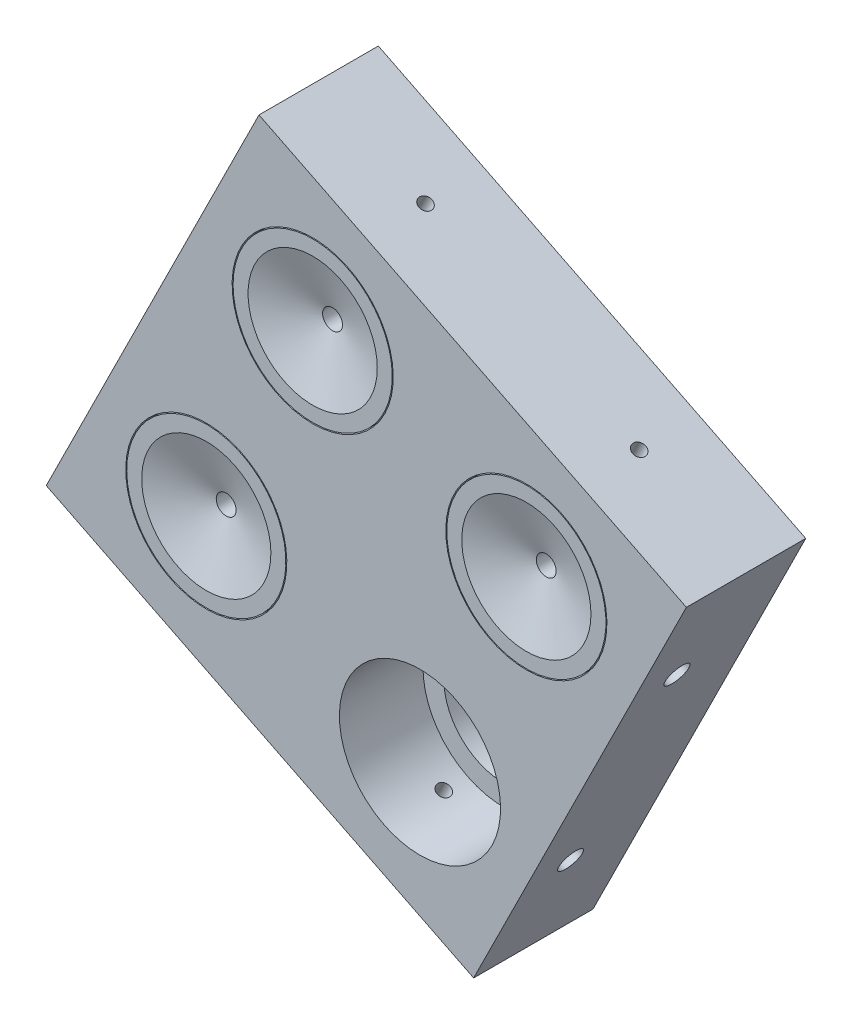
ISO-10303-21;
HEADER;
FILE_DESCRIPTION(('STEP AP214'),'2;1');
FILE_NAME('part.step','',(''),(''),'','','');
FILE_SCHEMA(('AUTOMOTIVE_DESIGN { 1 0 10303 214 1 1 1 1 }'));
ENDSEC;
DATA;
#1=APPLICATION_CONTEXT('core data for automotive mechanical design processes');
#2=APPLICATION_PROTOCOL_DEFINITION('international standard','automotive_design',2000,#1);
#3=PRODUCT_CONTEXT('',#1,'mechanical');
#4=PRODUCT('Part','Part','',(#3));
#5=PRODUCT_RELATED_PRODUCT_CATEGORY('part','',(#4));
#6=PRODUCT_DEFINITION_FORMATION('','',#4);
#7=PRODUCT_DEFINITION_CONTEXT('part definition',#1,'design');
#8=PRODUCT_DEFINITION('design','',#6,#7);
#9=PRODUCT_DEFINITION_SHAPE('','',#8);
#10=(LENGTH_UNIT() NAMED_UNIT(*) SI_UNIT(.MILLI.,.METRE.));
#11=(NAMED_UNIT(*) PLANE_ANGLE_UNIT() SI_UNIT($,.RADIAN.));
#12=(NAMED_UNIT(*) SI_UNIT($,.STERADIAN.) SOLID_ANGLE_UNIT());
#13=UNCERTAINTY_MEASURE_WITH_UNIT(LENGTH_MEASURE(1.E-05),#10,'distance_accuracy_value','');
#14=(GEOMETRIC_REPRESENTATION_CONTEXT(3) GLOBAL_UNCERTAINTY_ASSIGNED_CONTEXT((#13)) GLOBAL_UNIT_ASSIGNED_CONTEXT((#10,
#11,#12)) REPRESENTATION_CONTEXT('',''));
#15=CARTESIAN_POINT('',(0.,0.,0.));
#16=DIRECTION('',(0.,0.,1.));
#17=DIRECTION('',(1.,0.,0.));
#18=AXIS2_PLACEMENT_3D('',#15,#16,#17);
#19=CARTESIAN_POINT('',(-17.0677355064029,-43.9525047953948,-1.23386507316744));
#20=DIRECTION('',(0.,0.,1.));
#21=DIRECTION('',(0.936976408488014,-0.349392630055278,0.));
#22=AXIS2_PLACEMENT_3D('',#19,#20,#21);
#23=CONICAL_SURFACE('',#22,16.2373870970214,1.22173047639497);
#24=CARTESIAN_POINT('',(-17.0677355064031,-43.9525047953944,-6.23386507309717));
#25=DIRECTION('',(0.,0.,1.));
#26=DIRECTION('',(0.936976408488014,-0.349392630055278,0.));
#27=AXIS2_PLACEMENT_3D('',#24,#25,#26);
#28=CIRCLE('',#27,2.5);
#29=CARTESIAN_POINT('',(-14.7252944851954,-44.8259863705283,-6.23386507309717));
#30=VERTEX_POINT('',#29);
#31=EDGE_CURVE('P0_E29',#30,#30,#28,.F.);
#32=CARTESIAN_POINT('',(-17.0677355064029,-43.9525047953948,-1.23386507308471));
#33=DIRECTION('',(0.,0.,1.));
#34=DIRECTION('',(0.936976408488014,-0.349392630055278,0.));
#35=AXIS2_PLACEMENT_3D('',#32,#33,#34);
#36=CIRCLE('',#35,16.2373870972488);
#37=CARTESIAN_POINT('',(-1.85368686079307,-49.6257281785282,-1.23386507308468));
#38=VERTEX_POINT('',#37);
#39=EDGE_CURVE('P0_E17',#38,#38,#36,.F.);
#40=CARTESIAN_POINT('',(-14.7252944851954,-44.8259863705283,-6.23386507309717));
#41=CARTESIAN_POINT('',(-14.5912152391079,-44.8759836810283,-6.18178173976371));
#42=CARTESIAN_POINT('',(-14.4571359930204,-44.9259809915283,-6.12969840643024));
#43=CARTESIAN_POINT('',(-14.1889775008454,-45.0259756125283,-6.02553173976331));
#44=CARTESIAN_POINT('',(-14.0548982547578,-45.0759729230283,-5.97344840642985));
#45=CARTESIAN_POINT('',(-13.7867397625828,-45.1759675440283,-5.86928173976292));
#46=CARTESIAN_POINT('',(-13.6526605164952,-45.2259648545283,-5.81719840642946));
#47=CARTESIAN_POINT('',(-13.3845020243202,-45.3259594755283,-5.71303173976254));
#48=CARTESIAN_POINT('',(-13.2504227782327,-45.3759567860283,-5.66094840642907));
#49=CARTESIAN_POINT('',(-12.9822642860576,-45.4759514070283,-5.55678173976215));
#50=CARTESIAN_POINT('',(-12.8481850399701,-45.5259487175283,-5.50469840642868));
#51=CARTESIAN_POINT('',(-12.5800265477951,-45.6259433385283,-5.40053173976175));
#52=CARTESIAN_POINT('',(-12.4459473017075,-45.6759406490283,-5.34844840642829));
#53=CARTESIAN_POINT('',(-12.1777888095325,-45.7759352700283,-5.24428173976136));
#54=CARTESIAN_POINT('',(-12.043709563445,-45.8259325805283,-5.1921984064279));
#55=CARTESIAN_POINT('',(-11.7755510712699,-45.9259272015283,-5.08803173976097));
#56=CARTESIAN_POINT('',(-11.6414718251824,-45.9759245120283,-5.03594840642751));
#57=CARTESIAN_POINT('',(-11.3733133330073,-46.0759191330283,-4.93178173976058));
#58=CARTESIAN_POINT('',(-11.2392340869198,-46.1259164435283,-4.87969840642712));
#59=CARTESIAN_POINT('',(-10.9710755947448,-46.2259110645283,-4.77553173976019));
#60=CARTESIAN_POINT('',(-10.8369963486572,-46.2759083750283,-4.72344840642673));
#61=CARTESIAN_POINT('',(-10.5688378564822,-46.3759029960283,-4.6192817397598));
#62=CARTESIAN_POINT('',(-10.4347586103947,-46.4259003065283,-4.56719840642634));
#63=CARTESIAN_POINT('',(-10.1666001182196,-46.5258949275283,-4.46303173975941));
#64=CARTESIAN_POINT('',(-10.0325208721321,-46.5758922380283,-4.41094840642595));
#65=CARTESIAN_POINT('',(-9.76436237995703,-46.6758868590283,-4.30678173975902));
#66=CARTESIAN_POINT('',(-9.63028313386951,-46.7258841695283,-4.25469840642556));
#67=CARTESIAN_POINT('',(-9.36212464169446,-46.8258787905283,-4.15053173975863));
#68=CARTESIAN_POINT('',(-9.22804539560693,-46.8758761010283,-4.09844840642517));
#69=CARTESIAN_POINT('',(-8.95988690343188,-46.9758707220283,-3.99428173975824));
#70=CARTESIAN_POINT('',(-8.82580765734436,-47.0258680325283,-3.94219840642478));
#71=CARTESIAN_POINT('',(-8.55764916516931,-47.1258626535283,-3.83803173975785));
#72=CARTESIAN_POINT('',(-8.42356991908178,-47.1758599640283,-3.78594840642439));
#73=CARTESIAN_POINT('',(-8.15541142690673,-47.2758545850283,-3.68178173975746));
#74=CARTESIAN_POINT('',(-8.02133218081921,-47.3258518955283,-3.629698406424));
#75=CARTESIAN_POINT('',(-7.75317368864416,-47.4258465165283,-3.52553173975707));
#76=CARTESIAN_POINT('',(-7.61909444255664,-47.4758438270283,-3.47344840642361));
#77=CARTESIAN_POINT('',(-7.35093595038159,-47.5758384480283,-3.36928173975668));
#78=CARTESIAN_POINT('',(-7.21685670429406,-47.6258357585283,-3.31719840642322));
#79=CARTESIAN_POINT('',(-6.94869821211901,-47.7258303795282,-3.21303173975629));
#80=CARTESIAN_POINT('',(-6.81461896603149,-47.7758276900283,-3.16094840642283));
#81=CARTESIAN_POINT('',(-6.54646047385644,-47.8758223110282,-3.0567817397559));
#82=CARTESIAN_POINT('',(-6.41238122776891,-47.9258196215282,-3.00469840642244));
#83=CARTESIAN_POINT('',(-6.14422273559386,-48.0258142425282,-2.90053173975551));
#84=CARTESIAN_POINT('',(-6.01014348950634,-48.0758115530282,-2.84844840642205));
#85=CARTESIAN_POINT('',(-5.74198499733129,-48.1758061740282,-2.74428173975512));
#86=CARTESIAN_POINT('',(-5.60790575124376,-48.2258034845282,-2.69219840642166));
#87=CARTESIAN_POINT('',(-5.33974725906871,-48.3257981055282,-2.58803173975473));
#88=CARTESIAN_POINT('',(-5.20566801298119,-48.3757954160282,-2.53594840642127));
#89=CARTESIAN_POINT('',(-4.93750952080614,-48.4757900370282,-2.43178173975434));
#90=CARTESIAN_POINT('',(-4.80343027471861,-48.5257873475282,-2.37969840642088));
#91=CARTESIAN_POINT('',(-4.53527178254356,-48.6257819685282,-2.27553173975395));
#92=CARTESIAN_POINT('',(-4.40119253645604,-48.6757792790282,-2.22344840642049));
#93=CARTESIAN_POINT('',(-4.13303404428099,-48.7757739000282,-2.11928173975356));
#94=CARTESIAN_POINT('',(-3.99895479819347,-48.8257712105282,-2.0671984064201));
#95=CARTESIAN_POINT('',(-3.73079630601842,-48.9257658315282,-1.96303173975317));
#96=CARTESIAN_POINT('',(-3.59671705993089,-48.9757631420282,-1.91094840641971));
#97=CARTESIAN_POINT('',(-3.32855856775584,-49.0757577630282,-1.80678173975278));
#98=CARTESIAN_POINT('',(-3.19447932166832,-49.1257550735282,-1.75469840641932));
#99=CARTESIAN_POINT('',(-2.92632082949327,-49.2257496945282,-1.65053173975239));
#100=CARTESIAN_POINT('',(-2.79224158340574,-49.2757470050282,-1.59844840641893));
#101=CARTESIAN_POINT('',(-2.5240830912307,-49.3757416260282,-1.494281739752));
#102=CARTESIAN_POINT('',(-2.39000384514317,-49.4257389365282,-1.44219840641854));
#103=CARTESIAN_POINT('',(-2.12184535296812,-49.5257335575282,-1.33803173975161));
#104=CARTESIAN_POINT('',(-1.9877661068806,-49.5757308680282,-1.28594840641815));
#105=CARTESIAN_POINT('',(-1.85368686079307,-49.6257281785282,-1.23386507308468));
#106=B_SPLINE_CURVE_WITH_KNOTS('',3,(#40,#41,#42,#43,#44,#45,#46,#47,#48,#49,#50,#51,#52,#53,
#54,#55,#56,#57,#58,#59,#60,#61,#62,#63,#64,#65,#66,#67,#68,#69,#70,#71,#72,#73,#74,#75,#76,#77,
#78,#79,#80,#81,#82,#83,#84,#85,#86,#87,#88,#89,#90,#91,#92,#93,#94,#95,#96,#97,#98,#99,#100,
#101,#102,#103,#104,#105),.UNSPECIFIED.,.F.,.F.,(4,2,2,2,2,2,2,2,2,2,2,2,2,2,2,2,2,2,2,2,2,2,2,
2,2,2,2,2,2,2,2,2,4),(0.,0.456844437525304,0.913688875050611,1.37053331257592,1.82737775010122,
2.28422218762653,2.74106662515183,3.19791106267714,3.65475550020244,4.11159993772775,
4.56844437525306,5.02528881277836,5.48213325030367,5.93897768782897,6.39582212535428,
6.85266656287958,7.30951100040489,7.7663554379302,8.2231998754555,8.68004431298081,
9.13688875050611,9.59373318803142,10.0505776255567,10.507422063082,10.9642665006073,
11.4211109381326,11.8779553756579,12.3347998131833,12.7916442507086,13.2484886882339,
13.7053331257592,14.1621775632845,14.6190220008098),.UNSPECIFIED.);
#107=EDGE_CURVE('P0_BSEAM14',#30,#38,#106,.T.);
#108=ORIENTED_EDGE('',*,*,#31,.T.);
#109=ORIENTED_EDGE('',*,*,#39,.F.);
#110=ORIENTED_EDGE('',*,*,#107,.T.);
#111=ORIENTED_EDGE('',*,*,#107,.F.);
#112=EDGE_LOOP('',(#108,#110,#109,#111));
#113=FACE_BOUND('',#112,.T.);
#114=ADVANCED_FACE('P0_F14',(#113),#23,.F.);
#115=CARTESIAN_POINT('',(-17.0677355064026,-43.9525047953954,-22.2338650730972));
#116=DIRECTION('',(0.,0.,1.));
#117=DIRECTION('',(0.936976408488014,-0.349392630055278,0.));
#118=AXIS2_PLACEMENT_3D('',#115,#116,#117);
#119=CYLINDRICAL_SURFACE('',#118,2.5);
#120=CARTESIAN_POINT('',(-17.0677355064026,-43.9525047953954,-22.2338650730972));
#121=DIRECTION('',(0.,0.,1.));
#122=DIRECTION('',(0.936976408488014,-0.349392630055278,0.));
#123=AXIS2_PLACEMENT_3D('',#120,#121,#122);
#124=CIRCLE('',#123,2.5);
#125=CARTESIAN_POINT('',(-14.7252944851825,-44.8259863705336,-22.2338650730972));
#126=VERTEX_POINT('',#125);
#127=EDGE_CURVE('P0_E26',#126,#126,#124,.F.);
#128=ORIENTED_EDGE('',*,*,#127,.T.);
#129=EDGE_LOOP('',(#128));
#130=FACE_BOUND('',#129,.T.);
#131=ORIENTED_EDGE('',*,*,#31,.F.);
#132=EDGE_LOOP('',(#131));
#133=FACE_BOUND('',#132,.T.);
#134=ADVANCED_FACE('P0_F41',(#130,#133),#119,.F.);
#135=CARTESIAN_POINT('',(-17.0677355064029,-43.9525047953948,-1.2338650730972));
#136=DIRECTION('',(0.,0.,1.));
#137=DIRECTION('',(0.936976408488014,-0.349392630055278,0.));
#138=AXIS2_PLACEMENT_3D('',#135,#136,#137);
#139=PLANE('',#138);
#140=CARTESIAN_POINT('',(-17.0677355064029,-43.9525047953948,-1.2338650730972));
#141=DIRECTION('',(0.,0.,-1.));
#142=DIRECTION('',(-0.936976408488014,0.349392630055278,0.));
#143=AXIS2_PLACEMENT_3D('',#140,#141,#142);
#144=CIRCLE('',#143,20.);
#145=CARTESIAN_POINT('',(-35.8072636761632,-36.9646521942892,-1.23386507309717));
#146=VERTEX_POINT('',#145);
#147=EDGE_CURVE('P0_E21',#146,#146,#144,.T.);
#148=ORIENTED_EDGE('',*,*,#147,.F.);
#149=EDGE_LOOP('',(#148));
#150=FACE_BOUND('',#149,.T.);
#151=ORIENTED_EDGE('',*,*,#39,.T.);
#152=EDGE_LOOP('',(#151));
#153=FACE_BOUND('',#152,.T.);
#154=ADVANCED_FACE('P0_F43',(#150,#153),#139,.T.);
#155=CARTESIAN_POINT('',(-17.0677355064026,-43.9525047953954,-22.2338650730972));
#156=DIRECTION('',(0.,0.,1.));
#157=DIRECTION('',(0.936976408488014,-0.349392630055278,0.));
#158=AXIS2_PLACEMENT_3D('',#155,#156,#157);
#159=PLANE('',#158);
#160=CARTESIAN_POINT('',(-17.0677355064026,-43.9525047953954,-22.2338650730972));
#161=DIRECTION('',(0.,0.,-1.));
#162=DIRECTION('',(-0.936976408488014,0.349392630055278,0.));
#163=AXIS2_PLACEMENT_3D('',#160,#161,#162);
#164=CIRCLE('',#163,20.);
#165=CARTESIAN_POINT('',(-35.8072636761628,-36.9646521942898,-22.2338650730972));
#166=VERTEX_POINT('',#165);
#167=EDGE_CURVE('P0_E10',#166,#166,#164,.F.);
#168=ORIENTED_EDGE('',*,*,#167,.F.);
#169=EDGE_LOOP('',(#168));
#170=FACE_BOUND('',#169,.T.);
#171=ORIENTED_EDGE('',*,*,#127,.F.);
#172=EDGE_LOOP('',(#171));
#173=FACE_BOUND('',#172,.T.);
#174=ADVANCED_FACE('P0_F49',(#170,#173),#159,.F.);
#175=CARTESIAN_POINT('',(-17.0677355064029,-43.9525047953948,-1.2338650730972));
#176=DIRECTION('',(0.,0.,-1.));
#177=DIRECTION('',(-0.936976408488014,0.349392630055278,0.));
#178=AXIS2_PLACEMENT_3D('',#175,#176,#177);
#179=CYLINDRICAL_SURFACE('',#178,20.);
#180=ORIENTED_EDGE('',*,*,#167,.T.);
#181=EDGE_LOOP('',(#180));
#182=FACE_BOUND('',#181,.T.);
#183=ORIENTED_EDGE('',*,*,#147,.T.);
#184=EDGE_LOOP('',(#183));
#185=FACE_BOUND('',#184,.T.);
#186=ADVANCED_FACE('P0_F52',(#182,#185),#179,.T.);
#187=CLOSED_SHELL('',(#114,#134,#154,#174,#186));
#188=MANIFOLD_SOLID_BREP('P0_B1',#187);
#189=CARTESIAN_POINT('',(63.3829507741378,-16.9768291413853,-1.23386507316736));
#190=DIRECTION('',(0.,0.,1.));
#191=DIRECTION('',(1.00000000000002,0.,0.));
#192=AXIS2_PLACEMENT_3D('',#189,#190,#191);
#193=CONICAL_SURFACE('',#192,16.2373870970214,1.22173047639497);
#194=CARTESIAN_POINT('',(63.3829507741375,-16.9768291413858,-6.23386507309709));
#195=DIRECTION('',(0.,0.,1.));
#196=DIRECTION('',(1.00000000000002,0.,0.));
#197=AXIS2_PLACEMENT_3D('',#194,#195,#196);
#198=CIRCLE('',#197,2.5);
#199=CARTESIAN_POINT('',(65.8829507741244,-16.9768291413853,-6.23386507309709));
#200=VERTEX_POINT('',#199);
#201=EDGE_CURVE('P1_E29',#200,#200,#198,.F.);
#202=CARTESIAN_POINT('',(63.3829507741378,-16.9768291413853,-1.23386507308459));
#203=DIRECTION('',(0.,0.,1.));
#204=DIRECTION('',(1.00000000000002,0.,0.));
#205=AXIS2_PLACEMENT_3D('',#202,#203,#204);
#206=CIRCLE('',#205,16.2373870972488);
#207=CARTESIAN_POINT('',(79.6203378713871,-16.9768291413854,-1.23386507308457));
#208=VERTEX_POINT('',#207);
#209=EDGE_CURVE('P1_E17',#208,#208,#206,.F.);
#210=CARTESIAN_POINT('',(65.8829507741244,-16.9768291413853,-6.23386507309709));
#211=CARTESIAN_POINT('',(66.0260485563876,-16.9768291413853,-6.18178173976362));
#212=CARTESIAN_POINT('',(66.1691463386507,-16.9768291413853,-6.12969840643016));
#213=CARTESIAN_POINT('',(66.455341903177,-16.9768291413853,-6.02553173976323));
#214=CARTESIAN_POINT('',(66.5984396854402,-16.9768291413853,-5.97344840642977));
#215=CARTESIAN_POINT('',(66.8846352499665,-16.9768291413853,-5.86928173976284));
#216=CARTESIAN_POINT('',(67.0277330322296,-16.9768291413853,-5.81719840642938));
#217=CARTESIAN_POINT('',(67.3139285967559,-16.9768291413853,-5.71303173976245));
#218=CARTESIAN_POINT('',(67.4570263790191,-16.9768291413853,-5.66094840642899));
#219=CARTESIAN_POINT('',(67.7432219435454,-16.9768291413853,-5.55678173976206));
#220=CARTESIAN_POINT('',(67.8863197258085,-16.9768291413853,-5.5046984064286));
#221=CARTESIAN_POINT('',(68.1725152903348,-16.9768291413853,-5.40053173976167));
#222=CARTESIAN_POINT('',(68.315613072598,-16.9768291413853,-5.3484484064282));
#223=CARTESIAN_POINT('',(68.6018086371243,-16.9768291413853,-5.24428173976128));
#224=CARTESIAN_POINT('',(68.7449064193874,-16.9768291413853,-5.19219840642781));
#225=CARTESIAN_POINT('',(69.0311019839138,-16.9768291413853,-5.08803173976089));
#226=CARTESIAN_POINT('',(69.1741997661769,-16.9768291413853,-5.03594840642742));
#227=CARTESIAN_POINT('',(69.4603953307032,-16.9768291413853,-4.9317817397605));
#228=CARTESIAN_POINT('',(69.6034931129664,-16.9768291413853,-4.87969840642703));
#229=CARTESIAN_POINT('',(69.8896886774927,-16.9768291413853,-4.7755317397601));
#230=CARTESIAN_POINT('',(70.0327864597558,-16.9768291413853,-4.72344840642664));
#231=CARTESIAN_POINT('',(70.3189820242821,-16.9768291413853,-4.61928173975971));
#232=CARTESIAN_POINT('',(70.4620798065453,-16.9768291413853,-4.56719840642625));
#233=CARTESIAN_POINT('',(70.7482753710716,-16.9768291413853,-4.46303173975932));
#234=CARTESIAN_POINT('',(70.8913731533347,-16.9768291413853,-4.41094840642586));
#235=CARTESIAN_POINT('',(71.177568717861,-16.9768291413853,-4.30678173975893));
#236=CARTESIAN_POINT('',(71.3206665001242,-16.9768291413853,-4.25469840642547));
#237=CARTESIAN_POINT('',(71.6068620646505,-16.9768291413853,-4.15053173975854));
#238=CARTESIAN_POINT('',(71.7499598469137,-16.9768291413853,-4.09844840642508));
#239=CARTESIAN_POINT('',(72.0361554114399,-16.9768291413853,-3.99428173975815));
#240=CARTESIAN_POINT('',(72.1792531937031,-16.9768291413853,-3.94219840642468));
#241=CARTESIAN_POINT('',(72.4654487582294,-16.9768291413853,-3.83803173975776));
#242=CARTESIAN_POINT('',(72.6085465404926,-16.9768291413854,-3.78594840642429));
#243=CARTESIAN_POINT('',(72.8947421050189,-16.9768291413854,-3.68178173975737));
#244=CARTESIAN_POINT('',(73.037839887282,-16.9768291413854,-3.6296984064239));
#245=CARTESIAN_POINT('',(73.3240354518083,-16.9768291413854,-3.52553173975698));
#246=CARTESIAN_POINT('',(73.4671332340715,-16.9768291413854,-3.47344840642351));
#247=CARTESIAN_POINT('',(73.7533287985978,-16.9768291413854,-3.36928173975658));
#248=CARTESIAN_POINT('',(73.8964265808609,-16.9768291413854,-3.31719840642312));
#249=CARTESIAN_POINT('',(74.1826221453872,-16.9768291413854,-3.21303173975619));
#250=CARTESIAN_POINT('',(74.3257199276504,-16.9768291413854,-3.16094840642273));
#251=CARTESIAN_POINT('',(74.6119154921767,-16.9768291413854,-3.0567817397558));
#252=CARTESIAN_POINT('',(74.7550132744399,-16.9768291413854,-3.00469840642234));
#253=CARTESIAN_POINT('',(75.0412088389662,-16.9768291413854,-2.90053173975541));
#254=CARTESIAN_POINT('',(75.1843066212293,-16.9768291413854,-2.84844840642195));
#255=CARTESIAN_POINT('',(75.4705021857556,-16.9768291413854,-2.74428173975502));
#256=CARTESIAN_POINT('',(75.6135999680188,-16.9768291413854,-2.69219840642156));
#257=CARTESIAN_POINT('',(75.8997955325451,-16.9768291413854,-2.58803173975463));
#258=CARTESIAN_POINT('',(76.0428933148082,-16.9768291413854,-2.53594840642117));
#259=CARTESIAN_POINT('',(76.3290888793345,-16.9768291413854,-2.43178173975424));
#260=CARTESIAN_POINT('',(76.4721866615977,-16.9768291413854,-2.37969840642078));
#261=CARTESIAN_POINT('',(76.758382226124,-16.9768291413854,-2.27553173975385));
#262=CARTESIAN_POINT('',(76.9014800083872,-16.9768291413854,-2.22344840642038));
#263=CARTESIAN_POINT('',(77.1876755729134,-16.9768291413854,-2.11928173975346));
#264=CARTESIAN_POINT('',(77.3307733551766,-16.9768291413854,-2.06719840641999));
#265=CARTESIAN_POINT('',(77.6169689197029,-16.9768291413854,-1.96303173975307));
#266=CARTESIAN_POINT('',(77.7600667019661,-16.9768291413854,-1.9109484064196));
#267=CARTESIAN_POINT('',(78.0462622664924,-16.9768291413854,-1.80678173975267));
#268=CARTESIAN_POINT('',(78.1893600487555,-16.9768291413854,-1.75469840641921));
#269=CARTESIAN_POINT('',(78.4755556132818,-16.9768291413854,-1.65053173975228));
#270=CARTESIAN_POINT('',(78.618653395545,-16.9768291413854,-1.59844840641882));
#271=CARTESIAN_POINT('',(78.9048489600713,-16.9768291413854,-1.49428173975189));
#272=CARTESIAN_POINT('',(79.0479467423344,-16.9768291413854,-1.44219840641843));
#273=CARTESIAN_POINT('',(79.3341423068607,-16.9768291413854,-1.3380317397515));
#274=CARTESIAN_POINT('',(79.4772400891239,-16.9768291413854,-1.28594840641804));
#275=CARTESIAN_POINT('',(79.6203378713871,-16.9768291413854,-1.23386507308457));
#276=B_SPLINE_CURVE_WITH_KNOTS('',3,(#210,#211,#212,#213,#214,#215,#216,#217,#218,#219,#220,
#221,#222,#223,#224,#225,#226,#227,#228,#229,#230,#231,#232,#233,#234,#235,#236,#237,#238,#239,
#240,#241,#242,#243,#244,#245,#246,#247,#248,#249,#250,#251,#252,#253,#254,#255,#256,#257,#258,
#259,#260,#261,#262,#263,#264,#265,#266,#267,#268,#269,#270,#271,#272,#273,#274,#275),
.UNSPECIFIED.,.F.,.F.,(4,2,2,2,2,2,2,2,2,2,2,2,2,2,2,2,2,2,2,2,2,2,2,2,2,2,2,2,2,2,2,2,4),(0.,
0.45684443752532,0.913688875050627,1.37053331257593,1.82737775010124,2.28422218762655,
2.74106662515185,3.19791106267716,3.65475550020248,4.11159993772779,4.56844437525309,
5.0252888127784,5.48213325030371,5.93897768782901,6.39582212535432,6.85266656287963,
7.30951100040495,7.76635543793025,8.22319987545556,8.68004431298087,9.13688875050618,
9.59373318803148,10.0505776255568,10.5074220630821,10.9642665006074,11.4211109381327,
11.877955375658,12.3347998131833,12.7916442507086,13.248488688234,13.7053331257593,
14.1621775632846,14.6190220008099),.UNSPECIFIED.);
#277=EDGE_CURVE('P1_BSEAM14',#200,#208,#276,.T.);
#278=ORIENTED_EDGE('',*,*,#201,.T.);
#279=ORIENTED_EDGE('',*,*,#209,.F.);
#280=ORIENTED_EDGE('',*,*,#277,.T.);
#281=ORIENTED_EDGE('',*,*,#277,.F.);
#282=EDGE_LOOP('',(#278,#280,#279,#281));
#283=FACE_BOUND('',#282,.T.);
#284=ADVANCED_FACE('P1_F14',(#283),#193,.F.);
#285=CARTESIAN_POINT('',(63.382950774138,-16.9768291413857,-22.2338650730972));
#286=DIRECTION('',(0.,0.,1.));
#287=DIRECTION('',(1.00000000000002,0.,0.));
#288=AXIS2_PLACEMENT_3D('',#285,#286,#287);
#289=CYLINDRICAL_SURFACE('',#288,2.5);
#290=CARTESIAN_POINT('',(63.382950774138,-16.9768291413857,-22.2338650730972));
#291=DIRECTION('',(0.,0.,1.));
#292=DIRECTION('',(1.00000000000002,0.,0.));
#293=AXIS2_PLACEMENT_3D('',#290,#291,#292);
#294=CIRCLE('',#293,2.5);
#295=CARTESIAN_POINT('',(65.8829507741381,-16.9768291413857,-22.2338650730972));
#296=VERTEX_POINT('',#295);
#297=EDGE_CURVE('P1_E26',#296,#296,#294,.F.);
#298=ORIENTED_EDGE('',*,*,#297,.T.);
#299=EDGE_LOOP('',(#298));
#300=FACE_BOUND('',#299,.T.);
#301=ORIENTED_EDGE('',*,*,#201,.F.);
#302=EDGE_LOOP('',(#301));
#303=FACE_BOUND('',#302,.T.);
#304=ADVANCED_FACE('P1_F41',(#300,#303),#289,.F.);
#305=CARTESIAN_POINT('',(63.3829507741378,-16.9768291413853,-1.23386507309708));
#306=DIRECTION('',(0.,0.,1.));
#307=DIRECTION('',(1.00000000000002,0.,0.));
#308=AXIS2_PLACEMENT_3D('',#305,#306,#307);
#309=PLANE('',#308);
#310=CARTESIAN_POINT('',(63.3829507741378,-16.9768291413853,-1.23386507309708));
#311=DIRECTION('',(0.,0.,-1.));
#312=DIRECTION('',(-1.00000000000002,0.,0.));
#313=AXIS2_PLACEMENT_3D('',#310,#311,#312);
#314=CIRCLE('',#313,20.);
#315=CARTESIAN_POINT('',(43.3829507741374,-16.9768291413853,-1.23386507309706));
#316=VERTEX_POINT('',#315);
#317=EDGE_CURVE('P1_E21',#316,#316,#314,.T.);
#318=ORIENTED_EDGE('',*,*,#317,.F.);
#319=EDGE_LOOP('',(#318));
#320=FACE_BOUND('',#319,.T.);
#321=ORIENTED_EDGE('',*,*,#209,.T.);
#322=EDGE_LOOP('',(#321));
#323=FACE_BOUND('',#322,.T.);
#324=ADVANCED_FACE('P1_F43',(#320,#323),#309,.T.);
#325=CARTESIAN_POINT('',(63.382950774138,-16.9768291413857,-22.2338650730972));
#326=DIRECTION('',(0.,0.,1.));
#327=DIRECTION('',(1.00000000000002,0.,0.));
#328=AXIS2_PLACEMENT_3D('',#325,#326,#327);
#329=PLANE('',#328);
#330=CARTESIAN_POINT('',(63.382950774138,-16.9768291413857,-22.2338650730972));
#331=DIRECTION('',(0.,0.,-1.));
#332=DIRECTION('',(-1.00000000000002,0.,0.));
#333=AXIS2_PLACEMENT_3D('',#330,#331,#332);
#334=CIRCLE('',#333,20.);
#335=CARTESIAN_POINT('',(43.3829507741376,-16.9768291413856,-22.2338650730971));
#336=VERTEX_POINT('',#335);
#337=EDGE_CURVE('P1_E10',#336,#336,#334,.F.);
#338=ORIENTED_EDGE('',*,*,#337,.F.);
#339=EDGE_LOOP('',(#338));
#340=FACE_BOUND('',#339,.T.);
#341=ORIENTED_EDGE('',*,*,#297,.F.);
#342=EDGE_LOOP('',(#341));
#343=FACE_BOUND('',#342,.T.);
#344=ADVANCED_FACE('P1_F49',(#340,#343),#329,.F.);
#345=CARTESIAN_POINT('',(63.3829507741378,-16.9768291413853,-1.23386507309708));
#346=DIRECTION('',(0.,0.,-1.));
#347=DIRECTION('',(-1.00000000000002,0.,0.));
#348=AXIS2_PLACEMENT_3D('',#345,#346,#347);
#349=CYLINDRICAL_SURFACE('',#348,20.);
#350=ORIENTED_EDGE('',*,*,#337,.T.);
#351=EDGE_LOOP('',(#350));
#352=FACE_BOUND('',#351,.T.);
#353=ORIENTED_EDGE('',*,*,#317,.T.);
#354=EDGE_LOOP('',(#353));
#355=FACE_BOUND('',#354,.T.);
#356=ADVANCED_FACE('P1_F52',(#352,#355),#349,.T.);
#357=CLOSED_SHELL('',(#284,#304,#324,#344,#356));
#358=MANIFOLD_SOLID_BREP('P1_B1',#357);
#359=CARTESIAN_POINT('',(9.66976980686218,9.76067617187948,-1.23386507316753));
#360=DIRECTION('',(0.,0.,1.));
#361=DIRECTION('',(1.00000000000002,0.,0.));
#362=AXIS2_PLACEMENT_3D('',#359,#360,#361);
#363=CONICAL_SURFACE('',#362,16.2373870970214,1.22173047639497);
#364=CARTESIAN_POINT('',(9.66976980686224,9.76067617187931,-6.23386507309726));
#365=DIRECTION('',(0.,0.,1.));
#366=DIRECTION('',(1.00000000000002,0.,0.));
#367=AXIS2_PLACEMENT_3D('',#364,#365,#366);
#368=CIRCLE('',#367,2.5);
#369=CARTESIAN_POINT('',(12.1697698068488,9.76067617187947,-6.23386507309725));
#370=VERTEX_POINT('',#369);
#371=EDGE_CURVE('P2_E29',#370,#370,#368,.F.);
#372=CARTESIAN_POINT('',(9.66976980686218,9.76067617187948,-1.23386507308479));
#373=DIRECTION('',(0.,0.,1.));
#374=DIRECTION('',(1.00000000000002,0.,0.));
#375=AXIS2_PLACEMENT_3D('',#372,#373,#374);
#376=CIRCLE('',#375,16.2373870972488);
#377=CARTESIAN_POINT('',(25.9071569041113,9.76067617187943,-1.23386507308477));
#378=VERTEX_POINT('',#377);
#379=EDGE_CURVE('P2_E17',#378,#378,#376,.F.);
#380=CARTESIAN_POINT('',(12.1697698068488,9.76067617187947,-6.23386507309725));
#381=CARTESIAN_POINT('',(12.3128675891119,9.76067617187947,-6.18178173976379));
#382=CARTESIAN_POINT('',(12.4559653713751,9.76067617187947,-6.12969840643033));
#383=CARTESIAN_POINT('',(12.7421609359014,9.76067617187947,-6.0255317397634));
#384=CARTESIAN_POINT('',(12.8852587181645,9.76067617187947,-5.97344840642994));
#385=CARTESIAN_POINT('',(13.1714542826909,9.76067617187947,-5.86928173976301));
#386=CARTESIAN_POINT('',(13.314552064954,9.76067617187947,-5.81719840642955));
#387=CARTESIAN_POINT('',(13.6007476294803,9.76067617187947,-5.71303173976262));
#388=CARTESIAN_POINT('',(13.7438454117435,9.76067617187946,-5.66094840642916));
#389=CARTESIAN_POINT('',(14.0300409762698,9.76067617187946,-5.55678173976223));
#390=CARTESIAN_POINT('',(14.1731387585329,9.76067617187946,-5.50469840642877));
#391=CARTESIAN_POINT('',(14.4593343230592,9.76067617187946,-5.40053173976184));
#392=CARTESIAN_POINT('',(14.6024321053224,9.76067617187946,-5.34844840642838));
#393=CARTESIAN_POINT('',(14.8886276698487,9.76067617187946,-5.24428173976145));
#394=CARTESIAN_POINT('',(15.0317254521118,9.76067617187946,-5.19219840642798));
#395=CARTESIAN_POINT('',(15.3179210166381,9.76067617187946,-5.08803173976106));
#396=CARTESIAN_POINT('',(15.4610187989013,9.76067617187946,-5.0359484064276));
#397=CARTESIAN_POINT('',(15.7472143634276,9.76067617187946,-4.93178173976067));
#398=CARTESIAN_POINT('',(15.8903121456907,9.76067617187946,-4.87969840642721));
#399=CARTESIAN_POINT('',(16.176507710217,9.76067617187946,-4.77553173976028));
#400=CARTESIAN_POINT('',(16.3196054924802,9.76067617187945,-4.72344840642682));
#401=CARTESIAN_POINT('',(16.6058010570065,9.76067617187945,-4.61928173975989));
#402=CARTESIAN_POINT('',(16.7488988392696,9.76067617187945,-4.56719840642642));
#403=CARTESIAN_POINT('',(17.0350944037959,9.76067617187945,-4.4630317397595));
#404=CARTESIAN_POINT('',(17.1781921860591,9.76067617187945,-4.41094840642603));
#405=CARTESIAN_POINT('',(17.4643877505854,9.76067617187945,-4.30678173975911));
#406=CARTESIAN_POINT('',(17.6074855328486,9.76067617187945,-4.25469840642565));
#407=CARTESIAN_POINT('',(17.8936810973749,9.76067617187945,-4.15053173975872));
#408=CARTESIAN_POINT('',(18.036778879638,9.76067617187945,-4.09844840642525));
#409=CARTESIAN_POINT('',(18.3229744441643,9.76067617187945,-3.99428173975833));
#410=CARTESIAN_POINT('',(18.4660722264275,9.76067617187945,-3.94219840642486));
#411=CARTESIAN_POINT('',(18.7522677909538,9.76067617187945,-3.83803173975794));
#412=CARTESIAN_POINT('',(18.8953655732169,9.76067617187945,-3.78594840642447));
#413=CARTESIAN_POINT('',(19.1815611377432,9.76067617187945,-3.68178173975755));
#414=CARTESIAN_POINT('',(19.3246589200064,9.76067617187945,-3.62969840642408));
#415=CARTESIAN_POINT('',(19.6108544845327,9.76067617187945,-3.52553173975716));
#416=CARTESIAN_POINT('',(19.7539522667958,9.76067617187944,-3.47344840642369));
#417=CARTESIAN_POINT('',(20.0401478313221,9.76067617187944,-3.36928173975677));
#418=CARTESIAN_POINT('',(20.1832456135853,9.76067617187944,-3.3171984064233));
#419=CARTESIAN_POINT('',(20.4694411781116,9.76067617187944,-3.21303173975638));
#420=CARTESIAN_POINT('',(20.6125389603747,9.76067617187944,-3.16094840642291));
#421=CARTESIAN_POINT('',(20.898734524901,9.76067617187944,-3.05678173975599));
#422=CARTESIAN_POINT('',(21.0418323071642,9.76067617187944,-3.00469840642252));
#423=CARTESIAN_POINT('',(21.3280278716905,9.76067617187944,-2.9005317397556));
#424=CARTESIAN_POINT('',(21.4711256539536,9.76067617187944,-2.84844840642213));
#425=CARTESIAN_POINT('',(21.7573212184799,9.76067617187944,-2.74428173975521));
#426=CARTESIAN_POINT('',(21.9004190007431,9.76067617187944,-2.69219840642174));
#427=CARTESIAN_POINT('',(22.1866145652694,9.76067617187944,-2.58803173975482));
#428=CARTESIAN_POINT('',(22.3297123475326,9.76067617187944,-2.53594840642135));
#429=CARTESIAN_POINT('',(22.6159079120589,9.76067617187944,-2.43178173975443));
#430=CARTESIAN_POINT('',(22.759005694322,9.76067617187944,-2.37969840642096));
#431=CARTESIAN_POINT('',(23.0452012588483,9.76067617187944,-2.27553173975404));
#432=CARTESIAN_POINT('',(23.1882990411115,9.76067617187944,-2.22344840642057));
#433=CARTESIAN_POINT('',(23.4744946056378,9.76067617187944,-2.11928173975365));
#434=CARTESIAN_POINT('',(23.6175923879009,9.76067617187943,-2.06719840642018));
#435=CARTESIAN_POINT('',(23.9037879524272,9.76067617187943,-1.96303173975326));
#436=CARTESIAN_POINT('',(24.0468857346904,9.76067617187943,-1.91094840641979));
#437=CARTESIAN_POINT('',(24.3330812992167,9.76067617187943,-1.80678173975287));
#438=CARTESIAN_POINT('',(24.4761790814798,9.76067617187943,-1.7546984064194));
#439=CARTESIAN_POINT('',(24.7623746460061,9.76067617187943,-1.65053173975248));
#440=CARTESIAN_POINT('',(24.9054724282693,9.76067617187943,-1.59844840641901));
#441=CARTESIAN_POINT('',(25.1916679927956,9.76067617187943,-1.49428173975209));
#442=CARTESIAN_POINT('',(25.3347657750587,9.76067617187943,-1.44219840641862));
#443=CARTESIAN_POINT('',(25.620961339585,9.76067617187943,-1.3380317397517));
#444=CARTESIAN_POINT('',(25.7640591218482,9.76067617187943,-1.28594840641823));
#445=CARTESIAN_POINT('',(25.9071569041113,9.76067617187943,-1.23386507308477));
#446=B_SPLINE_CURVE_WITH_KNOTS('',3,(#380,#381,#382,#383,#384,#385,#386,#387,#388,#389,#390,
#391,#392,#393,#394,#395,#396,#397,#398,#399,#400,#401,#402,#403,#404,#405,#406,#407,#408,#409,
#410,#411,#412,#413,#414,#415,#416,#417,#418,#419,#420,#421,#422,#423,#424,#425,#426,#427,#428,
#429,#430,#431,#432,#433,#434,#435,#436,#437,#438,#439,#440,#441,#442,#443,#444,#445),
.UNSPECIFIED.,.F.,.F.,(4,2,2,2,2,2,2,2,2,2,2,2,2,2,2,2,2,2,2,2,2,2,2,2,2,2,2,2,2,2,2,2,4),(0.,
0.456844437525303,0.913688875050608,1.37053331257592,1.82737775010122,2.28422218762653,
2.74106662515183,3.19791106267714,3.65475550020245,4.11159993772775,4.56844437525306,
5.02528881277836,5.48213325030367,5.93897768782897,6.39582212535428,6.85266656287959,
7.30951100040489,7.7663554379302,8.2231998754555,8.68004431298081,9.13688875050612,
9.59373318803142,10.0505776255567,10.507422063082,10.9642665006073,11.4211109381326,
11.877955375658,12.3347998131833,12.7916442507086,13.2484886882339,13.7053331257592,
14.1621775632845,14.6190220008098),.UNSPECIFIED.);
#447=EDGE_CURVE('P2_BSEAM14',#370,#378,#446,.T.);
#448=ORIENTED_EDGE('',*,*,#371,.T.);
#449=ORIENTED_EDGE('',*,*,#379,.F.);
#450=ORIENTED_EDGE('',*,*,#447,.T.);
#451=ORIENTED_EDGE('',*,*,#447,.F.);
#452=EDGE_LOOP('',(#448,#450,#449,#451));
#453=FACE_BOUND('',#452,.T.);
#454=ADVANCED_FACE('P2_F14',(#453),#363,.F.);
#455=CARTESIAN_POINT('',(9.66976980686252,9.76067617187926,-22.2338650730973));
#456=DIRECTION('',(0.,0.,1.));
#457=DIRECTION('',(1.00000000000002,0.,0.));
#458=AXIS2_PLACEMENT_3D('',#455,#456,#457);
#459=CYLINDRICAL_SURFACE('',#458,2.5);
#460=CARTESIAN_POINT('',(9.66976980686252,9.76067617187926,-22.2338650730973));
#461=DIRECTION('',(0.,0.,1.));
#462=DIRECTION('',(1.00000000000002,0.,0.));
#463=AXIS2_PLACEMENT_3D('',#460,#461,#462);
#464=CIRCLE('',#463,2.5);
#465=CARTESIAN_POINT('',(12.1697698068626,9.76067617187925,-22.2338650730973));
#466=VERTEX_POINT('',#465);
#467=EDGE_CURVE('P2_E26',#466,#466,#464,.F.);
#468=ORIENTED_EDGE('',*,*,#467,.T.);
#469=EDGE_LOOP('',(#468));
#470=FACE_BOUND('',#469,.T.);
#471=ORIENTED_EDGE('',*,*,#371,.F.);
#472=EDGE_LOOP('',(#471));
#473=FACE_BOUND('',#472,.T.);
#474=ADVANCED_FACE('P2_F41',(#470,#473),#459,.F.);
#475=CARTESIAN_POINT('',(9.66976980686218,9.76067617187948,-1.23386507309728));
#476=DIRECTION('',(0.,0.,1.));
#477=DIRECTION('',(1.00000000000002,0.,0.));
#478=AXIS2_PLACEMENT_3D('',#475,#476,#477);
#479=PLANE('',#478);
#480=CARTESIAN_POINT('',(9.66976980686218,9.76067617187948,-1.23386507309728));
#481=DIRECTION('',(0.,0.,-1.));
#482=DIRECTION('',(-1.00000000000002,0.,0.));
#483=AXIS2_PLACEMENT_3D('',#480,#481,#482);
#484=CIRCLE('',#483,20.);
#485=CARTESIAN_POINT('',(-10.3302301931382,9.76067617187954,-1.23386507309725));
#486=VERTEX_POINT('',#485);
#487=EDGE_CURVE('P2_E21',#486,#486,#484,.T.);
#488=ORIENTED_EDGE('',*,*,#487,.F.);
#489=EDGE_LOOP('',(#488));
#490=FACE_BOUND('',#489,.T.);
#491=ORIENTED_EDGE('',*,*,#379,.T.);
#492=EDGE_LOOP('',(#491));
#493=FACE_BOUND('',#492,.T.);
#494=ADVANCED_FACE('P2_F43',(#490,#493),#479,.T.);
#495=CARTESIAN_POINT('',(9.66976980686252,9.76067617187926,-22.2338650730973));
#496=DIRECTION('',(0.,0.,1.));
#497=DIRECTION('',(1.00000000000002,0.,0.));
#498=AXIS2_PLACEMENT_3D('',#495,#496,#497);
#499=PLANE('',#498);
#500=CARTESIAN_POINT('',(9.66976980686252,9.76067617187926,-22.2338650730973));
#501=DIRECTION('',(0.,0.,-1.));
#502=DIRECTION('',(-1.00000000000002,0.,0.));
#503=AXIS2_PLACEMENT_3D('',#500,#501,#502);
#504=CIRCLE('',#503,20.);
#505=CARTESIAN_POINT('',(-10.3302301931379,9.76067617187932,-22.2338650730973));
#506=VERTEX_POINT('',#505);
#507=EDGE_CURVE('P2_E10',#506,#506,#504,.F.);
#508=ORIENTED_EDGE('',*,*,#507,.F.);
#509=EDGE_LOOP('',(#508));
#510=FACE_BOUND('',#509,.T.);
#511=ORIENTED_EDGE('',*,*,#467,.F.);
#512=EDGE_LOOP('',(#511));
#513=FACE_BOUND('',#512,.T.);
#514=ADVANCED_FACE('P2_F49',(#510,#513),#499,.F.);
#515=CARTESIAN_POINT('',(9.66976980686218,9.76067617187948,-1.23386507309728));
#516=DIRECTION('',(0.,0.,-1.));
#517=DIRECTION('',(-1.00000000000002,0.,0.));
#518=AXIS2_PLACEMENT_3D('',#515,#516,#517);
#519=CYLINDRICAL_SURFACE('',#518,20.);
#520=ORIENTED_EDGE('',*,*,#507,.T.);
#521=EDGE_LOOP('',(#520));
#522=FACE_BOUND('',#521,.T.);
#523=ORIENTED_EDGE('',*,*,#487,.T.);
#524=EDGE_LOOP('',(#523));
#525=FACE_BOUND('',#524,.T.);
#526=ADVANCED_FACE('P2_F52',(#522,#525),#519,.T.);
#527=CLOSED_SHELL('',(#454,#474,#494,#514,#526));
#528=MANIFOLD_SOLID_BREP('P2_B1',#527);
#529=CARTESIAN_POINT('',(9.66976980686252,9.76067617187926,-22.2338650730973));
#530=DIRECTION('',(0.,0.,1.));
#531=DIRECTION('',(0.895219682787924,-0.445625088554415,0.));
#532=AXIS2_PLACEMENT_3D('',#529,#530,#531);
#533=CYLINDRICAL_SURFACE('',#532,20.25);
#534=CARTESIAN_POINT('',(9.66976980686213,9.76067617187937,-1.23386507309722));
#535=DIRECTION('',(0.,0.,1.));
#536=DIRECTION('',(0.895219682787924,-0.445625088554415,0.));
#537=AXIS2_PLACEMENT_3D('',#534,#535,#536);
#538=CIRCLE('',#537,20.25);
#539=CARTESIAN_POINT('',(27.7979683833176,0.736768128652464,-1.23386507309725));
#540=VERTEX_POINT('',#539);
#541=EDGE_CURVE('P3_E825',#540,#540,#538,.F.);
#542=ORIENTED_EDGE('',*,*,#541,.F.);
#543=EDGE_LOOP('',(#542));
#544=FACE_BOUND('',#543,.T.);
#545=CARTESIAN_POINT('',(-8.45842876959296,18.7845842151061,-15.2338650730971));
#546=CARTESIAN_POINT('',(-8.53301000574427,18.6347510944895,-15.2338575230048));
#547=CARTESIAN_POINT('',(-8.60581405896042,18.4837917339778,-15.2198000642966));
#548=CARTESIAN_POINT('',(-8.745833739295,18.1841861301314,-15.1639224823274));
#549=CARTESIAN_POINT('',(-8.8130375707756,18.0355452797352,-15.1220453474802));
#550=CARTESIAN_POINT('',(-8.94023414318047,17.7453688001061,-15.0118010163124));
#551=CARTESIAN_POINT('',(-9.00023515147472,17.6038251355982,-14.943464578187));
#552=CARTESIAN_POINT('',(-9.11211066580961,17.3320099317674,-14.7823093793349));
#553=CARTESIAN_POINT('',(-9.1639883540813,17.2017339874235,-14.6895002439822));
#554=CARTESIAN_POINT('',(-9.25942859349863,16.9555027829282,-14.4812605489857));
#555=CARTESIAN_POINT('',(-9.30293111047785,16.8396528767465,-14.3656778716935));
#556=CARTESIAN_POINT('',(-9.38092645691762,16.6269949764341,-14.1154941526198));
#557=CARTESIAN_POINT('',(-9.41541831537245,16.5301890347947,-13.9808910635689));
#558=CARTESIAN_POINT('',(-9.47548923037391,16.3583960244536,-13.6956952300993));
#559=CARTESIAN_POINT('',(-9.50102489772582,16.2835154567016,-13.5450291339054));
#560=CARTESIAN_POINT('',(-9.54301113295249,16.1587935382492,-13.2324849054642));
#561=CARTESIAN_POINT('',(-9.55946226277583,16.1089506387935,-13.0706074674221));
#562=CARTESIAN_POINT('',(-9.5832751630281,16.0363612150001,-12.7414877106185));
#563=CARTESIAN_POINT('',(-9.59070244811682,16.01341942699,-12.5742932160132));
#564=CARTESIAN_POINT('',(-9.59673274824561,15.9948145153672,-12.238239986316));
#565=CARTESIAN_POINT('',(-9.59533624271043,15.999149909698,-12.0693813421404));
#566=CARTESIAN_POINT('',(-9.58375808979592,16.0347896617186,-11.7362344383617));
#567=CARTESIAN_POINT('',(-9.5736475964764,16.0658755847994,-11.5719202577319));
#568=CARTESIAN_POINT('',(-9.54467744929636,16.1536122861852,-11.2510741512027));
#569=CARTESIAN_POINT('',(-9.52581747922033,16.2102639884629,-11.0945425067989));
#570=CARTESIAN_POINT('',(-9.47917981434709,16.3474409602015,-10.7930088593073));
#571=CARTESIAN_POINT('',(-9.45136786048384,16.428057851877,-10.6480538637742));
#572=CARTESIAN_POINT('',(-9.38681010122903,16.6103903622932,-10.374316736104));
#573=CARTESIAN_POINT('',(-9.35006442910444,16.7121056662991,-10.2455343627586));
#574=CARTESIAN_POINT('',(-9.26732918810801,16.9344447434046,-10.0064904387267));
#575=CARTESIAN_POINT('',(-9.22125454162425,17.0552401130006,-9.89641787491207));
#576=CARTESIAN_POINT('',(-9.12038394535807,17.3112736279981,-9.69935040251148));
#577=CARTESIAN_POINT('',(-9.0655840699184,17.4465182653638,-9.61236592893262));
#578=CARTESIAN_POINT('',(-8.9478943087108,17.7273753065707,-9.46394307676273));
#579=CARTESIAN_POINT('',(-8.88499338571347,17.8730017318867,-9.40254004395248));
#580=CARTESIAN_POINT('',(-8.7523724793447,18.1698052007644,-9.30738446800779));
#581=CARTESIAN_POINT('',(-8.68266725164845,18.3209698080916,-9.27357351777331));
#582=CARTESIAN_POINT('',(-8.58565916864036,18.5245320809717,-9.24730043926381));
#583=CARTESIAN_POINT('',(-8.56057840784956,18.5765852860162,-9.2422661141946));
#584=CARTESIAN_POINT('',(-8.50988687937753,18.6806499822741,-9.23554712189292));
#585=CARTESIAN_POINT('',(-8.48427611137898,18.7326614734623,-9.23386245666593));
#586=CARTESIAN_POINT('',(-8.38384250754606,18.9344148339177,-9.23387262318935));
#587=CARTESIAN_POINT('',(-8.30728630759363,19.0835064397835,-9.24793008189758));
#588=CARTESIAN_POINT('',(-8.15265055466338,19.3758364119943,-9.30380766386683));
#589=CARTESIAN_POINT('',(-8.07456819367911,19.5190621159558,-9.3456847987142));
#590=CARTESIAN_POINT('',(-7.91972536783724,19.7954767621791,-9.45592912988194));
#591=CARTESIAN_POINT('',(-7.84296347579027,19.9286771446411,-9.52426556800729));
#592=CARTESIAN_POINT('',(-7.69353436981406,20.1817988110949,-9.68542076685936));
#593=CARTESIAN_POINT('',(-7.62086555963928,20.3017252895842,-9.77822990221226));
#594=CARTESIAN_POINT('',(-7.48194123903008,20.5263108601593,-9.98646959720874));
#595=CARTESIAN_POINT('',(-7.41573359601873,20.6308585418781,-10.1020522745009));
#596=CARTESIAN_POINT('',(-7.29307981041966,20.8212862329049,-10.3522359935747));
#597=CARTESIAN_POINT('',(-7.23663472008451,20.9071642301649,-10.4868390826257));
#598=CARTESIAN_POINT('',(-7.13578008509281,21.0586558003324,-10.7720349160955));
#599=CARTESIAN_POINT('',(-7.09142935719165,21.1241705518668,-10.9227010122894));
#600=CARTESIAN_POINT('',(-7.01722897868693,21.2328568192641,-11.2352452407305));
#601=CARTESIAN_POINT('',(-6.98737843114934,21.2760297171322,-11.3971226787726));
#602=CARTESIAN_POINT('',(-6.94381717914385,21.3387887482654,-11.7262424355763));
#603=CARTESIAN_POINT('',(-6.92999017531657,21.3585448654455,-11.8934369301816));
#604=CARTESIAN_POINT('',(-6.91878125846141,21.3745719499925,-12.2294901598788));
#605=CARTESIAN_POINT('',(-6.92139845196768,21.3708441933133,-12.3983488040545));
#606=CARTESIAN_POINT('',(-6.94285441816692,21.3401214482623,-12.731495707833));
#607=CARTESIAN_POINT('',(-6.96156180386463,21.3133149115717,-12.8958098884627));
#608=CARTESIAN_POINT('',(-7.01409955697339,21.2373097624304,-13.216655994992));
#609=CARTESIAN_POINT('',(-7.04793047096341,21.188110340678,-13.3731876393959));
#610=CARTESIAN_POINT('',(-7.12926424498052,21.0682045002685,-13.6747212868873));
#611=CARTESIAN_POINT('',(-7.17681955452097,20.9974155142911,-13.8196762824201));
#612=CARTESIAN_POINT('',(-7.28337845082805,20.8359904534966,-14.0934134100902));
#613=CARTESIAN_POINT('',(-7.34238186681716,20.7453546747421,-14.2221957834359));
#614=CARTESIAN_POINT('',(-7.46990253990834,20.5453090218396,-14.4612397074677));
#615=CARTESIAN_POINT('',(-7.53850541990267,20.4357278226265,-14.571312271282));
#616=CARTESIAN_POINT('',(-7.68197704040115,20.2009003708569,-14.7683797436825));
#617=CARTESIAN_POINT('',(-7.75684859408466,20.0756470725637,-14.8553642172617));
#618=CARTESIAN_POINT('',(-7.90998682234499,19.8124356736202,-15.0037870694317));
#619=CARTESIAN_POINT('',(-7.98825803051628,19.6744603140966,-15.0651901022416));
#620=CARTESIAN_POINT('',(-8.14511831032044,19.38972279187,-15.1603456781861));
#621=CARTESIAN_POINT('',(-8.22370635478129,19.2429798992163,-15.1941566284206));
#622=CARTESIAN_POINT('',(-8.32764148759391,19.0428657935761,-15.2204297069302));
#623=CARTESIAN_POINT('',(-8.3540533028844,18.991475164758,-15.2254640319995));
#624=CARTESIAN_POINT('',(-8.40652414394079,18.8882961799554,-15.2321830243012));
#625=CARTESIAN_POINT('',(-8.43258316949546,18.8365078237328,-15.2338676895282));
#626=CARTESIAN_POINT('',(-8.45842876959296,18.7845842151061,-15.2338650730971));
#627=B_SPLINE_CURVE_WITH_KNOTS('',3,(#545,#546,#547,#548,#549,#550,#551,#552,#553,#554,#555,
#556,#557,#558,#559,#560,#561,#562,#563,#564,#565,#566,#567,#568,#569,#570,#571,#572,#573,#574,
#575,#576,#577,#578,#579,#580,#581,#582,#583,#584,#585,#586,#587,#588,#589,#590,#591,#592,#593,
#594,#595,#596,#597,#598,#599,#600,#601,#602,#603,#604,#605,#606,#607,#608,#609,#610,#611,#612,
#613,#614,#615,#616,#617,#618,#619,#620,#621,#622,#623,#624,#625,#626),.UNSPECIFIED.,.T.,.F.,(4,
2,2,2,2,2,2,2,2,2,2,2,2,2,2,2,2,2,2,2,2,2,2,2,2,2,2,2,2,2,2,2,2,2,2,2,2,2,2,2,4),(0.,
0.501885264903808,1.00480224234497,1.50713633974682,2.00927315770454,2.51488527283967,
3.02055185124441,3.52863540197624,4.03668752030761,4.54102861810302,5.04534231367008,
5.54557663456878,6.04582903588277,6.54801912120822,7.05020171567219,7.55718895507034,
8.06440494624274,8.57231945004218,9.07915598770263,9.25308067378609,9.42700546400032,
9.92889072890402,10.4318077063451,10.9341418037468,11.4362786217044,11.9418907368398,
12.4475573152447,12.9556408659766,13.463692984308,13.9680340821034,14.4723477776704,
14.9725820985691,15.472834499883,15.9750245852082,16.477207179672,16.9841944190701,
17.4914104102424,17.9993249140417,18.5061614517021,18.6800861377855,18.8540109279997),.UNSPECIFIED.);
#628=CARTESIAN_POINT('',(-8.45842876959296,18.7845842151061,-15.2338650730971));
#629=VERTEX_POINT('',#628);
#630=EDGE_CURVE('P3_E604',#629,#629,#627,.T.);
#631=ORIENTED_EDGE('',*,*,#630,.T.);
#632=EDGE_LOOP('',(#631));
#633=FACE_BOUND('',#632,.T.);
#634=CARTESIAN_POINT('',(9.66976980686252,9.76067617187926,-22.2338650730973));
#635=DIRECTION('',(0.,0.,1.));
#636=DIRECTION('',(0.895219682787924,-0.445625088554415,0.));
#637=AXIS2_PLACEMENT_3D('',#634,#635,#636);
#638=CIRCLE('',#637,20.25);
#639=CARTESIAN_POINT('',(-6.32046709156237,22.1854427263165,-22.2338650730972));
#640=VERTEX_POINT('',#639);
#641=CARTESIAN_POINT('',(-9.88301226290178,15.0286182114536,-22.2338650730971));
#642=VERTEX_POINT('',#641);
#643=EDGE_CURVE('P3_E264',#640,#642,#638,.T.);
#644=ORIENTED_EDGE('',*,*,#643,.F.);
#645=CARTESIAN_POINT('',(9.66976980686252,9.76067617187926,-22.2338650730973));
#646=DIRECTION('',(0.,0.,1.));
#647=DIRECTION('',(0.895219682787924,-0.445625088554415,0.));
#648=AXIS2_PLACEMENT_3D('',#645,#646,#647);
#649=CIRCLE('',#648,20.25);
#650=CARTESIAN_POINT('',(29.2232828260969,4.4954479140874,-22.2338650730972));
#651=VERTEX_POINT('',#650);
#652=EDGE_CURVE('P3_E1134',#651,#640,#649,.T.);
#653=ORIENTED_EDGE('',*,*,#652,.F.);
#654=CARTESIAN_POINT('',(9.66976980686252,9.76067617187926,-22.2338650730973));
#655=DIRECTION('',(0.,0.,1.));
#656=DIRECTION('',(0.895219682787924,-0.445625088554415,0.));
#657=AXIS2_PLACEMENT_3D('',#654,#655,#656);
#658=CIRCLE('',#657,20.25);
#659=CARTESIAN_POINT('',(25.6582821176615,-2.66630954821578,-22.2338650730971));
#660=VERTEX_POINT('',#659);
#661=EDGE_CURVE('P3_E1136',#660,#651,#658,.T.);
#662=ORIENTED_EDGE('',*,*,#661,.F.);
#663=CARTESIAN_POINT('',(9.66976980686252,9.76067617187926,-22.2338650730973));
#664=DIRECTION('',(0.,0.,1.));
#665=DIRECTION('',(0.895219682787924,-0.445625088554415,0.));
#666=AXIS2_PLACEMENT_3D('',#663,#664,#665);
#667=CIRCLE('',#666,20.25);
#668=CARTESIAN_POINT('',(-9.88399162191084,15.0260280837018,-22.2338650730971));
#669=VERTEX_POINT('',#668);
#670=EDGE_CURVE('P3_E294',#669,#660,#667,.T.);
#671=ORIENTED_EDGE('',*,*,#670,.F.);
#672=CARTESIAN_POINT('',(9.66976980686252,9.76067617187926,-22.2338650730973));
#673=DIRECTION('',(0.,0.,-1.));
#674=DIRECTION('',(-0.965605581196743,0.260011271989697,0.));
#675=AXIS2_PLACEMENT_3D('',#672,#673,#674);
#676=CIRCLE('',#675,20.2500000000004);
#677=EDGE_CURVE('P3_E293',#669,#642,#676,.T.);
#678=ORIENTED_EDGE('',*,*,#677,.T.);
#679=EDGE_LOOP('',(#644,#653,#662,#671,#678));
#680=FACE_BOUND('',#679,.T.);
#681=CARTESIAN_POINT('',(18.6936778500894,27.8888747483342,-14.5838650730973));
#682=CARTESIAN_POINT('',(18.7764283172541,27.8476820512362,-14.5838690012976));
#683=CARTESIAN_POINT('',(18.8590047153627,27.8058628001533,-14.591664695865));
#684=CARTESIAN_POINT('',(19.0213799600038,27.7222536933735,-14.6226641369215));
#685=CARTESIAN_POINT('',(19.1011725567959,27.6804640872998,-14.6459004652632));
#686=CARTESIAN_POINT('',(19.25560124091,27.5983322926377,-14.7071082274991));
#687=CARTESIAN_POINT('',(19.3302420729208,27.5579887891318,-14.7450658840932));
#688=CARTESIAN_POINT('',(19.4724007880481,27.4800865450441,-14.8346137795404));
#689=CARTESIAN_POINT('',(19.5399218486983,27.4425265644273,-14.886197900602));
#690=CARTESIAN_POINT('',(19.6662680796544,27.3714058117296,-15.0016805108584));
#691=CARTESIAN_POINT('',(19.7250732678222,27.3378542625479,-15.0656065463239));
#692=CARTESIAN_POINT('',(19.8322971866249,27.2760801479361,-15.2039029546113));
#693=CARTESIAN_POINT('',(19.8807149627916,27.2478580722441,-15.2782742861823));
#694=CARTESIAN_POINT('',(19.9659853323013,27.19778897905,-15.4354733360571));
#695=CARTESIAN_POINT('',(20.0028219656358,27.1759507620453,-15.5183125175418));
#696=CARTESIAN_POINT('',(20.0639013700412,27.1395656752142,-15.6900151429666));
#697=CARTESIAN_POINT('',(20.0881444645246,27.1250186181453,-15.7788784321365));
#698=CARTESIAN_POINT('',(20.123380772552,27.1038288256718,-15.9598968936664));
#699=CARTESIAN_POINT('',(20.1344034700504,27.0971685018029,-16.0520442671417));
#700=CARTESIAN_POINT('',(20.14301677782,27.0919665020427,-16.2371912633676));
#701=CARTESIAN_POINT('',(20.1406076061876,27.0934246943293,-16.3301908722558));
#702=CARTESIAN_POINT('',(20.1224411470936,27.1043860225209,-16.5141669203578));
#703=CARTESIAN_POINT('',(20.1067159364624,27.1138698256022,-16.6051476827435));
#704=CARTESIAN_POINT('',(20.0623576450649,27.1404713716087,-16.7827421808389));
#705=CARTESIAN_POINT('',(20.0337243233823,27.1575892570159,-16.8693558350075));
#706=CARTESIAN_POINT('',(19.9642292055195,27.1988019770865,-17.0358784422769));
#707=CARTESIAN_POINT('',(19.9233524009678,27.2229053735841,-17.1157790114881));
#708=CARTESIAN_POINT('',(19.8304187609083,27.2771426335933,-17.2665083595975));
#709=CARTESIAN_POINT('',(19.7783626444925,27.3072761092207,-17.3373377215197));
#710=CARTESIAN_POINT('',(19.6642352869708,27.3725324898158,-17.4681260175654));
#711=CARTESIAN_POINT('',(19.6021371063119,27.4076687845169,-17.5280547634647));
#712=CARTESIAN_POINT('',(19.4695980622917,27.4816133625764,-17.6351338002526));
#713=CARTESIAN_POINT('',(19.3991533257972,27.5204233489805,-17.682278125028));
#714=CARTESIAN_POINT('',(19.2517594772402,27.6003793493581,-17.7624423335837));
#715=CARTESIAN_POINT('',(19.1748044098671,27.6415274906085,-17.7954491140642));
#716=CARTESIAN_POINT('',(19.0166344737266,27.7247114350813,-17.8462707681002));
#717=CARTESIAN_POINT('',(18.9354290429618,27.76674515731,-17.8641179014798));
#718=CARTESIAN_POINT('',(18.8268438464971,27.8219991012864,-17.8773947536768));
#719=CARTESIAN_POINT('',(18.8003012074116,27.8354316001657,-17.8798193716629));
#720=CARTESIAN_POINT('',(18.7470787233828,27.8622189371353,-17.8830551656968));
#721=CARTESIAN_POINT('',(18.7203988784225,27.8755737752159,-17.8838663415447));
#722=CARTESIAN_POINT('',(18.610926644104,27.9300659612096,-17.883861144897));
#723=CARTESIAN_POINT('',(18.5277804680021,27.9707405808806,-17.8760654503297));
#724=CARTESIAN_POINT('',(18.3631859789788,28.0498914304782,-17.8450660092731));
#725=CARTESIAN_POINT('',(18.2817416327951,28.0883628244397,-17.8218296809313));
#726=CARTESIAN_POINT('',(18.1231163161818,28.1620639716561,-17.7606219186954));
#727=CARTESIAN_POINT('',(18.0459314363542,28.1972967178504,-17.7226642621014));
#728=CARTESIAN_POINT('',(17.8980775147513,28.2637578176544,-17.6331163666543));
#729=CARTESIAN_POINT('',(17.8274055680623,28.2949879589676,-17.5815322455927));
#730=CARTESIAN_POINT('',(17.6944947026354,28.3529209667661,-17.4660496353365));
#731=CARTESIAN_POINT('',(17.6322751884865,28.3796134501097,-17.4021235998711));
#732=CARTESIAN_POINT('',(17.5183493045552,28.4279239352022,-17.2638271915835));
#733=CARTESIAN_POINT('',(17.4666439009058,28.4495414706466,-17.1894558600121));
#734=CARTESIAN_POINT('',(17.3752914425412,28.4873922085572,-17.0322568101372));
#735=CARTESIAN_POINT('',(17.3356610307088,28.5036179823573,-16.9494176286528));
#736=CARTESIAN_POINT('',(17.2698097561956,28.5304168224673,-16.7777150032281));
#737=CARTESIAN_POINT('',(17.2435885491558,28.5409900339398,-16.688851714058));
#738=CARTESIAN_POINT('',(17.2054402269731,28.5563298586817,-16.507833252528));
#739=CARTESIAN_POINT('',(17.1934813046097,28.5611093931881,-16.4156858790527));
#740=CARTESIAN_POINT('',(17.1841383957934,28.5648456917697,-16.2305388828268));
#741=CARTESIAN_POINT('',(17.1867541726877,28.563802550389,-16.1375392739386));
#742=CARTESIAN_POINT('',(17.2064512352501,28.5559160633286,-15.9535632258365));
#743=CARTESIAN_POINT('',(17.2234977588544,28.5490866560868,-15.8625824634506));
#744=CARTESIAN_POINT('',(17.2714629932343,28.5297311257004,-15.6849879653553));
#745=CARTESIAN_POINT('',(17.3023819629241,28.5172048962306,-15.5983743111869));
#746=CARTESIAN_POINT('',(17.3771583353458,28.4866017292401,-15.4318517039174));
#747=CARTESIAN_POINT('',(17.4210316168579,28.4685179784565,-15.351951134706));
#748=CARTESIAN_POINT('',(17.5203294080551,28.4270657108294,-15.2012217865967));
#749=CARTESIAN_POINT('',(17.5757531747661,28.4036975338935,-15.1303924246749));
#750=CARTESIAN_POINT('',(17.6966190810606,28.3519782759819,-14.9996041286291));
#751=CARTESIAN_POINT('',(17.7620881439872,28.3236137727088,-14.9396753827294));
#752=CARTESIAN_POINT('',(17.9009852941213,28.2624420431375,-14.8325963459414));
#753=CARTESIAN_POINT('',(17.9744170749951,28.2296327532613,-14.7854520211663));
#754=CARTESIAN_POINT('',(18.1270655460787,28.1602328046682,-14.7052878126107));
#755=CARTESIAN_POINT('',(18.2062875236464,28.1236386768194,-14.6722810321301));
#756=CARTESIAN_POINT('',(18.3680076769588,28.0475867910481,-14.6214593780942));
#757=CARTESIAN_POINT('',(18.450498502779,28.0081353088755,-14.6036122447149));
#758=CARTESIAN_POINT('',(18.5600428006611,27.9548081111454,-14.5903353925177));
#759=CARTESIAN_POINT('',(18.5867609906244,27.9417282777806,-14.5879107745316));
#760=CARTESIAN_POINT('',(18.6402181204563,27.9154123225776,-14.5846749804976));
#761=CARTESIAN_POINT('',(18.6669570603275,27.9021762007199,-14.5838638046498));
#762=CARTESIAN_POINT('',(18.6936778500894,27.8888747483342,-14.5838650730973));
#763=B_SPLINE_CURVE_WITH_KNOTS('',3,(#681,#682,#683,#684,#685,#686,#687,#688,#689,#690,#691,
#692,#693,#694,#695,#696,#697,#698,#699,#700,#701,#702,#703,#704,#705,#706,#707,#708,#709,#710,
#711,#712,#713,#714,#715,#716,#717,#718,#719,#720,#721,#722,#723,#724,#725,#726,#727,#728,#729,
#730,#731,#732,#733,#734,#735,#736,#737,#738,#739,#740,#741,#742,#743,#744,#745,#746,#747,#748,
#749,#750,#751,#752,#753,#754,#755,#756,#757,#758,#759,#760,#761,#762),.UNSPECIFIED.,.T.,.F.,(4,
2,2,2,2,2,2,2,2,2,2,2,2,2,2,2,2,2,2,2,2,2,2,2,2,2,2,2,2,2,2,2,2,2,2,2,2,2,2,2,4),(0.,
0.277195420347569,0.554977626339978,0.832500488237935,1.10989896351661,1.38792388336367,
1.66597433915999,1.94440631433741,2.2228311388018,2.50063386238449,2.77843207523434,
3.0555630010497,3.33269909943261,3.61017631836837,3.88763569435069,4.16585214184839,
4.44419820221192,4.72280169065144,5.0008108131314,5.09031942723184,5.17982805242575,
5.4570234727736,5.73480567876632,6.01232854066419,6.28972701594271,6.56775193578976,
6.84580239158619,7.12423436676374,7.40265919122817,7.68046191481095,7.95826012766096,
8.23539105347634,8.51252715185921,8.79000437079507,9.06746374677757,9.34568019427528,
9.62402625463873,9.90262974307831,10.1806388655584,10.2701474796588,10.3596561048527),.UNSPECIFIED.);
#764=CARTESIAN_POINT('',(18.6936778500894,27.8888747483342,-14.5838650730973));
#765=VERTEX_POINT('',#764);
#766=EDGE_CURVE('P3_E969',#765,#765,#763,.T.);
#767=ORIENTED_EDGE('',*,*,#766,.T.);
#768=EDGE_LOOP('',(#767));
#769=FACE_BOUND('',#768,.T.);
#770=ADVANCED_FACE('P3_F16',(#544,#633,#680,#769),#533,.F.);
#771=CARTESIAN_POINT('',(63.3829507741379,-16.9768291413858,-22.2338650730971));
#772=DIRECTION('',(0.,0.,1.));
#773=DIRECTION('',(0.895219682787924,-0.445625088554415,0.));
#774=AXIS2_PLACEMENT_3D('',#771,#772,#773);
#775=CYLINDRICAL_SURFACE('',#774,20.25);
#776=CARTESIAN_POINT('',(81.5111493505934,-26.000737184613,-15.2338650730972));
#777=CARTESIAN_POINT('',(81.585730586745,-25.8509040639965,-15.233857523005));
#778=CARTESIAN_POINT('',(81.6585346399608,-25.6999447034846,-15.2198000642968));
#779=CARTESIAN_POINT('',(81.7985543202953,-25.4003390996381,-15.1639224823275));
#780=CARTESIAN_POINT('',(81.8657581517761,-25.2516982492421,-15.1220453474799));
#781=CARTESIAN_POINT('',(81.992954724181,-24.961521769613,-15.0118010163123));
#782=CARTESIAN_POINT('',(82.0529557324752,-24.8199781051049,-14.9434645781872));
#783=CARTESIAN_POINT('',(82.1648312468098,-24.5481629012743,-14.7823093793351));
#784=CARTESIAN_POINT('',(82.2167089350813,-24.4178869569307,-14.689500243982));
#785=CARTESIAN_POINT('',(82.3121491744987,-24.1716557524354,-14.4812605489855));
#786=CARTESIAN_POINT('',(82.3556516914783,-24.0558058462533,-14.3656778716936));
#787=CARTESIAN_POINT('',(82.4336470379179,-23.8431479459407,-14.1154941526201));
#788=CARTESIAN_POINT('',(82.4681388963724,-23.7463420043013,-13.980891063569));
#789=CARTESIAN_POINT('',(82.5282098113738,-23.5745489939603,-13.6956952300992));
#790=CARTESIAN_POINT('',(82.5537454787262,-23.4996684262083,-13.5450291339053));
#791=CARTESIAN_POINT('',(82.595731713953,-23.3749465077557,-13.2324849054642));
#792=CARTESIAN_POINT('',(82.612182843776,-23.3251036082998,-13.070607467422));
#793=CARTESIAN_POINT('',(82.6359957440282,-23.2525141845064,-12.7414877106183));
#794=CARTESIAN_POINT('',(82.6434230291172,-23.2295723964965,-12.574293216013));
#795=CARTESIAN_POINT('',(82.649453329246,-23.2109674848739,-12.2382399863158));
#796=CARTESIAN_POINT('',(82.6480568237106,-23.2153028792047,-12.0693813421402));
#797=CARTESIAN_POINT('',(82.6364786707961,-23.2509426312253,-11.7362344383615));
#798=CARTESIAN_POINT('',(82.6263681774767,-23.282028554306,-11.5719202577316));
#799=CARTESIAN_POINT('',(82.5973980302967,-23.369765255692,-11.2510741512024));
#800=CARTESIAN_POINT('',(82.5785380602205,-23.4264169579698,-11.0945425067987));
#801=CARTESIAN_POINT('',(82.5319003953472,-23.5635939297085,-10.7930088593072));
#802=CARTESIAN_POINT('',(82.5040884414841,-23.6442108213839,-10.648053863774));
#803=CARTESIAN_POINT('',(82.4395306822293,-23.8265433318,-10.3743167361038));
#804=CARTESIAN_POINT('',(82.4027850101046,-23.9282586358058,-10.2455343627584));
#805=CARTESIAN_POINT('',(82.3200497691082,-24.1505977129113,-10.0064904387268));
#806=CARTESIAN_POINT('',(82.2739751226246,-24.2713930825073,-9.89641787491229));
#807=CARTESIAN_POINT('',(82.1731045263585,-24.5274265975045,-9.69935040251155));
#808=CARTESIAN_POINT('',(82.1183046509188,-24.6626712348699,-9.61236592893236));
#809=CARTESIAN_POINT('',(82.0006148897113,-24.9435282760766,-9.46394307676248));
#810=CARTESIAN_POINT('',(81.9377139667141,-25.0891547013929,-9.4025400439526));
#811=CARTESIAN_POINT('',(81.8050930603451,-25.3859581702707,-9.30738446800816));
#812=CARTESIAN_POINT('',(81.7353878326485,-25.5371227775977,-9.2735735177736));
#813=CARTESIAN_POINT('',(81.6383797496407,-25.7406850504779,-9.24730043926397));
#814=CARTESIAN_POINT('',(81.61329898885,-25.7927382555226,-9.24226611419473));
#815=CARTESIAN_POINT('',(81.562607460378,-25.8968029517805,-9.23554712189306));
#816=CARTESIAN_POINT('',(81.5369966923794,-25.9488144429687,-9.23386245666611));
#817=CARTESIAN_POINT('',(81.4365630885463,-26.1505678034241,-9.23387262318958));
#818=CARTESIAN_POINT('',(81.360006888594,-26.29965940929,-9.24793008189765));
#819=CARTESIAN_POINT('',(81.2053711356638,-26.5919893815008,-9.30380766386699));
#820=CARTESIAN_POINT('',(81.1272887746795,-26.7352150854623,-9.34568479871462));
#821=CARTESIAN_POINT('',(80.9724459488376,-27.0116297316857,-9.4559291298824));
#822=CARTESIAN_POINT('',(80.8956840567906,-27.1448301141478,-9.52426556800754));
#823=CARTESIAN_POINT('',(80.7462549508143,-27.3979517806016,-9.68542076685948));
#824=CARTESIAN_POINT('',(80.6735861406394,-27.5178782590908,-9.77822990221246));
#825=CARTESIAN_POINT('',(80.5346618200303,-27.7424638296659,-9.98646959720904));
#826=CARTESIAN_POINT('',(80.4684541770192,-27.8470115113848,-10.1020522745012));
#827=CARTESIAN_POINT('',(80.3458003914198,-28.0374392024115,-10.3522359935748));
#828=CARTESIAN_POINT('',(80.2893553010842,-28.1233171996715,-10.4868390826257));
#829=CARTESIAN_POINT('',(80.1885006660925,-28.2748087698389,-10.7720349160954));
#830=CARTESIAN_POINT('',(80.1441499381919,-28.3403235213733,-10.9227010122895));
#831=CARTESIAN_POINT('',(80.0699495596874,-28.4490097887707,-11.2352452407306));
#832=CARTESIAN_POINT('',(80.0400990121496,-28.4921826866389,-11.3971226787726));
#833=CARTESIAN_POINT('',(79.996537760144,-28.5549417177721,-11.7262424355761));
#834=CARTESIAN_POINT('',(79.9827107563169,-28.5746978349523,-11.8934369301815));
#835=CARTESIAN_POINT('',(79.9715018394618,-28.590724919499,-12.2294901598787));
#836=CARTESIAN_POINT('',(79.9741190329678,-28.5869971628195,-12.3983488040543));
#837=CARTESIAN_POINT('',(79.995574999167,-28.5562744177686,-12.7314957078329));
#838=CARTESIAN_POINT('',(80.014282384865,-28.5294678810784,-12.8958098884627));
#839=CARTESIAN_POINT('',(80.0668201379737,-28.453462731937,-13.216655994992));
#840=CARTESIAN_POINT('',(80.1006510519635,-28.4042633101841,-13.3731876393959));
#841=CARTESIAN_POINT('',(80.1819848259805,-28.2843574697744,-13.6747212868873));
#842=CARTESIAN_POINT('',(80.2295401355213,-28.2135684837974,-13.8196762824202));
#843=CARTESIAN_POINT('',(80.3360990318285,-28.0521434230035,-14.0934134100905));
#844=CARTESIAN_POINT('',(80.3951024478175,-27.9615076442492,-14.2221957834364));
#845=CARTESIAN_POINT('',(80.5226231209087,-27.7614619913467,-14.461239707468));
#846=CARTESIAN_POINT('',(80.5912260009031,-27.6518807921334,-14.5713122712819));
#847=CARTESIAN_POINT('',(80.7346976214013,-27.4170533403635,-14.7683797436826));
#848=CARTESIAN_POINT('',(80.8095691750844,-27.2918000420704,-14.8553642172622));
#849=CARTESIAN_POINT('',(80.9627074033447,-27.028588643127,-15.0037870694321));
#850=CARTESIAN_POINT('',(81.0409786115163,-26.8906132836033,-15.0651901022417));
#851=CARTESIAN_POINT('',(81.1978388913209,-26.6058757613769,-15.1603456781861));
#852=CARTESIAN_POINT('',(81.2764269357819,-26.4591328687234,-15.194156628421));
#853=CARTESIAN_POINT('',(81.3803620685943,-26.259018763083,-15.2204297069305));
#854=CARTESIAN_POINT('',(81.4067738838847,-26.2076281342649,-15.2254640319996));
#855=CARTESIAN_POINT('',(81.4592447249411,-26.1044491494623,-15.2321830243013));
#856=CARTESIAN_POINT('',(81.4853037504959,-26.0526607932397,-15.2338676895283));
#857=CARTESIAN_POINT('',(81.5111493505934,-26.000737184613,-15.2338650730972));
#858=B_SPLINE_CURVE_WITH_KNOTS('',3,(#776,#777,#778,#779,#780,#781,#782,#783,#784,#785,#786,
#787,#788,#789,#790,#791,#792,#793,#794,#795,#796,#797,#798,#799,#800,#801,#802,#803,#804,#805,
#806,#807,#808,#809,#810,#811,#812,#813,#814,#815,#816,#817,#818,#819,#820,#821,#822,#823,#824,
#825,#826,#827,#828,#829,#830,#831,#832,#833,#834,#835,#836,#837,#838,#839,#840,#841,#842,#843,
#844,#845,#846,#847,#848,#849,#850,#851,#852,#853,#854,#855,#856,#857),.UNSPECIFIED.,.T.,.F.,(4,
2,2,2,2,2,2,2,2,2,2,2,2,2,2,2,2,2,2,2,2,2,2,2,2,2,2,2,2,2,2,2,2,2,2,2,2,2,2,2,4),(0.,
0.501885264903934,1.00480224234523,1.50713633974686,2.00927315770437,2.51488527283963,
3.02055185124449,3.52863540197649,4.03668752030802,4.54102861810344,5.04534231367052,
5.54557663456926,6.04582903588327,6.5480191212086,7.05020171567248,7.55718895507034,
8.06440494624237,8.57231945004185,9.07915598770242,9.25308067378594,9.42700546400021,
9.92889072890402,10.4318077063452,10.934141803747,11.4362786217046,11.9418907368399,
12.4475573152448,12.9556408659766,13.4636929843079,13.9680340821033,14.4723477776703,
14.972582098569,15.4728344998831,15.9750245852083,16.477207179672,16.98419441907,
17.4914104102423,17.9993249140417,18.5061614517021,18.6800861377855,18.8540109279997),.UNSPECIFIED.);
#859=CARTESIAN_POINT('',(81.5111493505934,-26.000737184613,-15.2338650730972));
#860=VERTEX_POINT('',#859);
#861=EDGE_CURVE('P3_E975',#860,#860,#858,.T.);
#862=ORIENTED_EDGE('',*,*,#861,.T.);
#863=EDGE_LOOP('',(#862));
#864=FACE_BOUND('',#863,.T.);
#865=CARTESIAN_POINT('',(63.3829507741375,-16.9768291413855,-1.23386507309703));
#866=DIRECTION('',(0.,0.,1.));
#867=DIRECTION('',(0.895219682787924,-0.445625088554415,0.));
#868=AXIS2_PLACEMENT_3D('',#865,#866,#867);
#869=CIRCLE('',#868,20.25);
#870=CARTESIAN_POINT('',(81.5111493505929,-26.0007371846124,-1.23386507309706));
#871=VERTEX_POINT('',#870);
#872=EDGE_CURVE('P3_E524',#871,#871,#869,.F.);
#873=ORIENTED_EDGE('',*,*,#872,.F.);
#874=EDGE_LOOP('',(#873));
#875=FACE_BOUND('',#874,.T.);
#876=CARTESIAN_POINT('',(63.3829507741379,-16.9768291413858,-22.2338650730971));
#877=DIRECTION('',(0.,0.,1.));
#878=DIRECTION('',(0.895219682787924,-0.445625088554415,0.));
#879=AXIS2_PLACEMENT_3D('',#876,#877,#878);
#880=CIRCLE('',#879,20.25);
#881=CARTESIAN_POINT('',(47.3944384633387,-4.54984342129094,-22.2338650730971));
#882=VERTEX_POINT('',#881);
#883=CARTESIAN_POINT('',(43.8294377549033,-11.7116008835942,-22.2338650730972));
#884=VERTEX_POINT('',#883);
#885=EDGE_CURVE('P3_E537',#882,#884,#880,.T.);
#886=ORIENTED_EDGE('',*,*,#885,.F.);
#887=CARTESIAN_POINT('',(63.3829507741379,-16.9768291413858,-22.2338650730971));
#888=DIRECTION('',(0.,0.,1.));
#889=DIRECTION('',(0.895219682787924,-0.445625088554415,0.));
#890=AXIS2_PLACEMENT_3D('',#887,#888,#889);
#891=CIRCLE('',#890,20.25);
#892=CARTESIAN_POINT('',(82.9364637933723,-22.2420573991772,-22.2338650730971));
#893=VERTEX_POINT('',#892);
#894=EDGE_CURVE('P3_E536',#893,#882,#891,.T.);
#895=ORIENTED_EDGE('',*,*,#894,.F.);
#896=CARTESIAN_POINT('',(63.3829507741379,-16.9768291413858,-22.2338650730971));
#897=DIRECTION('',(0.,0.,1.));
#898=DIRECTION('',(0.895219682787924,-0.445625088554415,0.));
#899=AXIS2_PLACEMENT_3D('',#896,#897,#898);
#900=CIRCLE('',#899,20.25);
#901=CARTESIAN_POINT('',(79.3714630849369,-29.4038148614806,-22.2338650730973));
#902=VERTEX_POINT('',#901);
#903=EDGE_CURVE('P3_E649',#902,#893,#900,.T.);
#904=ORIENTED_EDGE('',*,*,#903,.F.);
#905=CARTESIAN_POINT('',(63.3829507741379,-16.9768291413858,-22.2338650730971));
#906=DIRECTION('',(0.,0.,1.));
#907=DIRECTION('',(0.895219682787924,-0.445625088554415,0.));
#908=AXIS2_PLACEMENT_3D('',#905,#906,#907);
#909=CIRCLE('',#908,20.25);
#910=EDGE_CURVE('P3_E1138',#884,#902,#909,.T.);
#911=ORIENTED_EDGE('',*,*,#910,.F.);
#912=EDGE_LOOP('',(#886,#895,#904,#911));
#913=FACE_BOUND('',#912,.T.);
#914=CARTESIAN_POINT('',(72.4068588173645,1.15136943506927,-14.5838650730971));
#915=CARTESIAN_POINT('',(72.4896092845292,1.11017673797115,-14.5838690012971));
#916=CARTESIAN_POINT('',(72.572185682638,1.06835748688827,-14.5916646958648));
#917=CARTESIAN_POINT('',(72.7345609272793,0.984748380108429,-14.6226641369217));
#918=CARTESIAN_POINT('',(72.8143535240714,0.942958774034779,-14.6459004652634));
#919=CARTESIAN_POINT('',(72.9687822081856,0.860826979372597,-14.7071082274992));
#920=CARTESIAN_POINT('',(73.0434230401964,0.820483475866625,-14.7450658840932));
#921=CARTESIAN_POINT('',(73.1855817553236,0.742581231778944,-14.8346137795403));
#922=CARTESIAN_POINT('',(73.2531028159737,0.705021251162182,-14.886197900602));
#923=CARTESIAN_POINT('',(73.3794490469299,0.633900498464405,-15.0016805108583));
#924=CARTESIAN_POINT('',(73.4382542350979,0.600348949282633,-15.0656065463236));
#925=CARTESIAN_POINT('',(73.5454781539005,0.538574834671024,-15.2039029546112));
#926=CARTESIAN_POINT('',(73.5938959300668,0.510352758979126,-15.2782742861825));
#927=CARTESIAN_POINT('',(73.6791662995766,0.460283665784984,-15.4354733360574));
#928=CARTESIAN_POINT('',(73.7160029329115,0.438445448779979,-15.5183125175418));
#929=CARTESIAN_POINT('',(73.777082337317,0.402060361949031,-15.6900151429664));
#930=CARTESIAN_POINT('',(73.8013254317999,0.387513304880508,-15.7788784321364));
#931=CARTESIAN_POINT('',(73.8365617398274,0.366323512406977,-15.9598968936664));
#932=CARTESIAN_POINT('',(73.8475844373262,0.359663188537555,-16.0520442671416));
#933=CARTESIAN_POINT('',(73.8561977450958,0.354461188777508,-16.2371912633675));
#934=CARTESIAN_POINT('',(73.8537885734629,0.355919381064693,-16.3301908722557));
#935=CARTESIAN_POINT('',(73.8356221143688,0.366880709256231,-16.5141669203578));
#936=CARTESIAN_POINT('',(73.8198969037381,0.376364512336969,-16.6051476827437));
#937=CARTESIAN_POINT('',(73.7755386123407,0.402966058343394,-16.7827421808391));
#938=CARTESIAN_POINT('',(73.7469052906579,0.420083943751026,-16.8693558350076));
#939=CARTESIAN_POINT('',(73.677410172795,0.461296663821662,-17.0358784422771));
#940=CARTESIAN_POINT('',(73.6365333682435,0.485400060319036,-17.1157790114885));
#941=CARTESIAN_POINT('',(73.5435997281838,0.539637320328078,-17.2665083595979));
#942=CARTESIAN_POINT('',(73.4915436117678,0.56977079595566,-17.3373377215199));
#943=CARTESIAN_POINT('',(73.3774162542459,0.635027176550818,-17.4681260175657));
#944=CARTESIAN_POINT('',(73.3153180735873,0.670163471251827,-17.5280547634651));
#945=CARTESIAN_POINT('',(73.1827790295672,0.744108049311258,-17.635133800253));
#946=CARTESIAN_POINT('',(73.1123342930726,0.782918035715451,-17.6822781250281));
#947=CARTESIAN_POINT('',(72.9649404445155,0.862874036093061,-17.7624423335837));
#948=CARTESIAN_POINT('',(72.8879853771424,0.90402217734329,-17.7954491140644));
#949=CARTESIAN_POINT('',(72.729815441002,0.987206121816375,-17.8462707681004));
#950=CARTESIAN_POINT('',(72.6486100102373,1.02923984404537,-17.8641179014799));
#951=CARTESIAN_POINT('',(72.5400248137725,1.08449378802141,-17.877394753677));
#952=CARTESIAN_POINT('',(72.513482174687,1.09792628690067,-17.8798193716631));
#953=CARTESIAN_POINT('',(72.4602596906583,1.12471362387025,-17.8830551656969));
#954=CARTESIAN_POINT('',(72.433579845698,1.13806846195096,-17.8838663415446));
#955=CARTESIAN_POINT('',(72.3241076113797,1.19256064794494,-17.8838611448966));
#956=CARTESIAN_POINT('',(72.2409614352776,1.23323526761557,-17.8760654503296));
#957=CARTESIAN_POINT('',(72.0763669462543,1.31238611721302,-17.8450660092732));
#958=CARTESIAN_POINT('',(71.9949226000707,1.35085751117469,-17.8218296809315));
#959=CARTESIAN_POINT('',(71.8362972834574,1.42455865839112,-17.7606219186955));
#960=CARTESIAN_POINT('',(71.7591124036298,1.45979140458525,-17.7226642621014));
#961=CARTESIAN_POINT('',(71.6112584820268,1.52625250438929,-17.6331163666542));
#962=CARTESIAN_POINT('',(71.5405865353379,1.55748264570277,-17.5815322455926));
#963=CARTESIAN_POINT('',(71.4076756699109,1.61541565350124,-17.4660496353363));
#964=CARTESIAN_POINT('',(71.3454561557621,1.64210813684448,-17.4021235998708));
#965=CARTESIAN_POINT('',(71.2315302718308,1.69041862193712,-17.2638271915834));
#966=CARTESIAN_POINT('',(71.1798248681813,1.71203615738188,-17.1894558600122));
#967=CARTESIAN_POINT('',(71.0884724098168,1.74988689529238,-17.0322568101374));
#968=CARTESIAN_POINT('',(71.0488419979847,1.76611266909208,-16.9494176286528));
#969=CARTESIAN_POINT('',(70.9829907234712,1.79291150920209,-16.7777150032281));
#970=CARTESIAN_POINT('',(70.9567695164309,1.80348472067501,-16.6888517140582));
#971=CARTESIAN_POINT('',(70.9186211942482,1.81882454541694,-16.5078332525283));
#972=CARTESIAN_POINT('',(70.9066622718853,1.82360407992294,-16.415685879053));
#973=CARTESIAN_POINT('',(70.8973193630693,1.82734037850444,-16.2305388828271));
#974=CARTESIAN_POINT('',(70.8999351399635,1.82629723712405,-16.1375392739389));
#975=CARTESIAN_POINT('',(70.9196322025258,1.81841075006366,-15.9535632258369));
#976=CARTESIAN_POINT('',(70.9366787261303,1.81158134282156,-15.8625824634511));
#977=CARTESIAN_POINT('',(70.9846439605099,1.79222581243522,-15.6849879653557));
#978=CARTESIAN_POINT('',(71.0155629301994,1.77969958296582,-15.5983743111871));
#979=CARTESIAN_POINT('',(71.090339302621,1.74909641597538,-15.4318517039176));
#980=CARTESIAN_POINT('',(71.1342125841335,1.73101266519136,-15.3519511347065));
#981=CARTESIAN_POINT('',(71.2335103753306,1.68956039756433,-15.201221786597));
#982=CARTESIAN_POINT('',(71.2889341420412,1.6661922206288,-15.1303924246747));
#983=CARTESIAN_POINT('',(71.4098000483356,1.61447296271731,-14.9996041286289));
#984=CARTESIAN_POINT('',(71.4752691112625,1.58610845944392,-14.9396753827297));
#985=CARTESIAN_POINT('',(71.6141662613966,1.52493672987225,-14.832596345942));
#986=CARTESIAN_POINT('',(71.6875980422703,1.492127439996,-14.7854520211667));
#987=CARTESIAN_POINT('',(71.8402465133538,1.42272749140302,-14.7052878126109));
#988=CARTESIAN_POINT('',(71.9194684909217,1.38613336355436,-14.6722810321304));
#989=CARTESIAN_POINT('',(72.0811886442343,1.3100814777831,-14.6214593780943));
#990=CARTESIAN_POINT('',(72.1636794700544,1.27062999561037,-14.6036122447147));
#991=CARTESIAN_POINT('',(72.2732237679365,1.21730279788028,-14.5903353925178));
#992=CARTESIAN_POINT('',(72.2999419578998,1.20422296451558,-14.5879107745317));
#993=CARTESIAN_POINT('',(72.3533990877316,1.17790700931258,-14.5846749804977));
#994=CARTESIAN_POINT('',(72.3801380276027,1.16467088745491,-14.5838638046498));
#995=CARTESIAN_POINT('',(72.4068588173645,1.15136943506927,-14.5838650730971));
#996=B_SPLINE_CURVE_WITH_KNOTS('',3,(#914,#915,#916,#917,#918,#919,#920,#921,#922,#923,#924,
#925,#926,#927,#928,#929,#930,#931,#932,#933,#934,#935,#936,#937,#938,#939,#940,#941,#942,#943,
#944,#945,#946,#947,#948,#949,#950,#951,#952,#953,#954,#955,#956,#957,#958,#959,#960,#961,#962,
#963,#964,#965,#966,#967,#968,#969,#970,#971,#972,#973,#974,#975,#976,#977,#978,#979,#980,#981,
#982,#983,#984,#985,#986,#987,#988,#989,#990,#991,#992,#993,#994,#995),.UNSPECIFIED.,.T.,.F.,(4,
2,2,2,2,2,2,2,2,2,2,2,2,2,2,2,2,2,2,2,2,2,2,2,2,2,2,2,2,2,2,2,2,2,2,2,2,2,2,2,4),(0.,
0.277195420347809,0.55497762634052,0.832500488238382,1.10989896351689,1.38792388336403,
1.66597433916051,1.94440631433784,2.22283113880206,2.50063386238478,2.77843207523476,
3.0555630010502,3.33269909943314,3.61017631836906,3.88763569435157,4.16585214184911,
4.44419820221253,4.72280169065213,5.00081081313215,5.09031942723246,5.17982805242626,
5.45702347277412,5.73480567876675,6.01232854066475,6.28972701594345,6.56775193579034,
6.84580239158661,7.12423436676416,7.40265919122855,7.68046191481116,7.95826012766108,
8.23539105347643,8.51252715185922,8.79000437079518,9.06746374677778,9.34568019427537,
9.62402625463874,9.9026297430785,10.1806388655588,10.270147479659,10.3596561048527),.UNSPECIFIED.);
#997=CARTESIAN_POINT('',(72.4068588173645,1.15136943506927,-14.5838650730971));
#998=VERTEX_POINT('',#997);
#999=EDGE_CURVE('P3_E620',#998,#998,#996,.T.);
#1000=ORIENTED_EDGE('',*,*,#999,.T.);
#1001=EDGE_LOOP('',(#1000));
#1002=FACE_BOUND('',#1001,.T.);
#1003=ADVANCED_FACE('P3_F630',(#864,#875,#913,#1002),#775,.F.);
#1004=CARTESIAN_POINT('',(-17.0677355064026,-43.9525047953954,-22.2338650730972));
#1005=DIRECTION('',(0.,0.,1.));
#1006=DIRECTION('',(0.895219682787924,-0.445625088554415,0.));
#1007=AXIS2_PLACEMENT_3D('',#1004,#1005,#1006);
#1008=CYLINDRICAL_SURFACE('',#1007,20.25);
#1009=CARTESIAN_POINT('',(-17.0677355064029,-43.9525047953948,-1.2338650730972));
#1010=DIRECTION('',(0.,0.,1.));
#1011=DIRECTION('',(0.895219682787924,-0.445625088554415,0.));
#1012=AXIS2_PLACEMENT_3D('',#1009,#1010,#1011);
#1013=CIRCLE('',#1012,20.25);
#1014=CARTESIAN_POINT('',(1.06046307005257,-52.9764128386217,-1.23386507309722));
#1015=VERTEX_POINT('',#1014);
#1016=EDGE_CURVE('P3_E611',#1015,#1015,#1013,.F.);
#1017=ORIENTED_EDGE('',*,*,#1016,.F.);
#1018=EDGE_LOOP('',(#1017));
#1019=FACE_BOUND('',#1018,.T.);
#1020=CARTESIAN_POINT('',(-17.0677355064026,-43.9525047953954,-22.2338650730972));
#1021=DIRECTION('',(0.,0.,1.));
#1022=DIRECTION('',(0.895219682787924,-0.445625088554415,0.));
#1023=AXIS2_PLACEMENT_3D('',#1020,#1021,#1022);
#1024=CIRCLE('',#1023,20.25);
#1025=CARTESIAN_POINT('',(2.48577751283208,-49.2177330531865,-22.2338650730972));
#1026=VERTEX_POINT('',#1025);
#1027=CARTESIAN_POINT('',(-33.0564962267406,-31.5253954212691,-22.2338650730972));
#1028=VERTEX_POINT('',#1027);
#1029=EDGE_CURVE('P3_E507',#1026,#1028,#1024,.T.);
#1030=ORIENTED_EDGE('',*,*,#1029,.F.);
#1031=CARTESIAN_POINT('',(-17.0677355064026,-43.9525047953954,-22.2338650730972));
#1032=DIRECTION('',(0.,0.,1.));
#1033=DIRECTION('',(0.895219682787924,-0.445625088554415,0.));
#1034=AXIS2_PLACEMENT_3D('',#1031,#1032,#1033);
#1035=CIRCLE('',#1034,20.25);
#1036=CARTESIAN_POINT('',(-1.07922319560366,-56.3794905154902,-22.2338650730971));
#1037=VERTEX_POINT('',#1036);
#1038=EDGE_CURVE('P3_E521',#1037,#1026,#1035,.T.);
#1039=ORIENTED_EDGE('',*,*,#1038,.F.);
#1040=CARTESIAN_POINT('',(-17.0677355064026,-43.9525047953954,-22.2338650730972));
#1041=DIRECTION('',(0.,0.,1.));
#1042=DIRECTION('',(0.895219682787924,-0.445625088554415,0.));
#1043=AXIS2_PLACEMENT_3D('',#1040,#1041,#1042);
#1044=CIRCLE('',#1043,20.25);
#1045=CARTESIAN_POINT('',(-36.6205175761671,-38.6845627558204,-22.2338650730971));
#1046=VERTEX_POINT('',#1045);
#1047=EDGE_CURVE('P3_E819',#1046,#1037,#1044,.T.);
#1048=ORIENTED_EDGE('',*,*,#1047,.F.);
#1049=CARTESIAN_POINT('',(-17.0677355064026,-43.9525047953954,-22.2338650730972));
#1050=DIRECTION('',(0.,0.,1.));
#1051=DIRECTION('',(0.895219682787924,-0.445625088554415,0.));
#1052=AXIS2_PLACEMENT_3D('',#1049,#1050,#1051);
#1053=CIRCLE('',#1052,20.25);
#1054=CARTESIAN_POINT('',(-33.0579724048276,-31.5277382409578,-22.2338650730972));
#1055=VERTEX_POINT('',#1054);
#1056=EDGE_CURVE('P3_E513',#1055,#1046,#1053,.T.);
#1057=ORIENTED_EDGE('',*,*,#1056,.F.);
#1058=CARTESIAN_POINT('',(-33.0567446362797,-31.5252717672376,-22.2338650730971));
#1059=DIRECTION('',(-0.445625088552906,-0.895219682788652,0.));
#1060=VECTOR('',#1059,1.);
#1061=LINE('',#1058,#1060);
#1062=EDGE_CURVE('P3_E512',#1028,#1055,#1061,.T.);
#1063=ORIENTED_EDGE('',*,*,#1062,.F.);
#1064=EDGE_LOOP('',(#1030,#1039,#1048,#1057,#1063));
#1065=FACE_BOUND('',#1064,.T.);
#1066=CARTESIAN_POINT('',(-35.1959340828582,-34.9285967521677,-9.23386507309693));
#1067=CARTESIAN_POINT('',(-35.1213478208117,-34.7787661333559,-9.23387262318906));
#1068=CARTESIAN_POINT('',(-35.0447916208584,-34.6296745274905,-9.24793008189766));
#1069=CARTESIAN_POINT('',(-34.890155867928,-34.3373445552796,-9.30380766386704));
#1070=CARTESIAN_POINT('',(-34.8120735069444,-34.1941188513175,-9.34568479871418));
#1071=CARTESIAN_POINT('',(-34.6572306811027,-33.9177042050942,-9.45592912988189));
#1072=CARTESIAN_POINT('',(-34.5804687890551,-33.7845038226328,-9.52426556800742));
#1073=CARTESIAN_POINT('',(-34.4310396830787,-33.5313821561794,-9.68542076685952));
#1074=CARTESIAN_POINT('',(-34.3583708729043,-33.41145567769,-9.77822990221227));
#1075=CARTESIAN_POINT('',(-34.2194465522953,-33.1868701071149,-9.98646959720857));
#1076=CARTESIAN_POINT('',(-34.1532389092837,-33.0823224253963,-10.1020522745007));
#1077=CARTESIAN_POINT('',(-34.0305851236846,-32.8918947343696,-10.3522359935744));
#1078=CARTESIAN_POINT('',(-33.9741400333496,-32.8060167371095,-10.4868390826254));
#1079=CARTESIAN_POINT('',(-33.8732853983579,-32.654525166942,-10.7720349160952));
#1080=CARTESIAN_POINT('',(-33.8289346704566,-32.5890104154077,-10.9227010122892));
#1081=CARTESIAN_POINT('',(-33.7547342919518,-32.4803241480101,-11.2352452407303));
#1082=CARTESIAN_POINT('',(-33.7248837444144,-32.4371512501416,-11.3971226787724));
#1083=CARTESIAN_POINT('',(-33.6813224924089,-32.3743922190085,-11.7262424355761));
#1084=CARTESIAN_POINT('',(-33.6674954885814,-32.3546361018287,-11.8934369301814));
#1085=CARTESIAN_POINT('',(-33.6562865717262,-32.3386090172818,-12.2294901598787));
#1086=CARTESIAN_POINT('',(-33.6589037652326,-32.3423367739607,-12.3983488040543));
#1087=CARTESIAN_POINT('',(-33.6803597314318,-32.3730595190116,-12.7314957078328));
#1088=CARTESIAN_POINT('',(-33.6990671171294,-32.3998660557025,-12.8958098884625));
#1089=CARTESIAN_POINT('',(-33.7516048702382,-32.4758712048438,-13.2166559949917));
#1090=CARTESIAN_POINT('',(-33.7854357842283,-32.5250706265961,-13.3731876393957));
#1091=CARTESIAN_POINT('',(-33.8667695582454,-32.6449764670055,-13.6747212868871));
#1092=CARTESIAN_POINT('',(-33.9143248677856,-32.7157654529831,-13.8196762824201));
#1093=CARTESIAN_POINT('',(-34.020883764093,-32.8771905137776,-14.0934134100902));
#1094=CARTESIAN_POINT('',(-34.0798871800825,-32.9678262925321,-14.2221957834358));
#1095=CARTESIAN_POINT('',(-34.2074078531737,-33.1678719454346,-14.4612397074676));
#1096=CARTESIAN_POINT('',(-34.2760107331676,-33.2774531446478,-14.5713122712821));
#1097=CARTESIAN_POINT('',(-34.419482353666,-33.5122805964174,-14.7683797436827));
#1098=CARTESIAN_POINT('',(-34.4943539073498,-33.6375338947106,-14.8553642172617));
#1099=CARTESIAN_POINT('',(-34.6474921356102,-33.9007452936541,-15.0037870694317));
#1100=CARTESIAN_POINT('',(-34.7257633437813,-34.0387206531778,-15.0651901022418));
#1101=CARTESIAN_POINT('',(-34.8826236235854,-34.3234581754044,-15.1603456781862));
#1102=CARTESIAN_POINT('',(-34.9612116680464,-34.4702010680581,-15.1941566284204));
#1103=CARTESIAN_POINT('',(-35.0651468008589,-34.6703151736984,-15.2204297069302));
#1104=CARTESIAN_POINT('',(-35.0915586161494,-34.7217058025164,-15.2254640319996));
#1105=CARTESIAN_POINT('',(-35.1440294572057,-34.8248847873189,-15.2321830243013));
#1106=CARTESIAN_POINT('',(-35.1700884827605,-34.8766731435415,-15.2338676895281));
#1107=CARTESIAN_POINT('',(-35.2705153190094,-35.0784298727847,-15.2338575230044));
#1108=CARTESIAN_POINT('',(-35.3433193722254,-35.2293892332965,-15.2198000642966));
#1109=CARTESIAN_POINT('',(-35.4833390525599,-35.5289948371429,-15.1639224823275));
#1110=CARTESIAN_POINT('',(-35.5505428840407,-35.6776356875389,-15.1220453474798));
#1111=CARTESIAN_POINT('',(-35.6777394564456,-35.967812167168,-15.011801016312));
#1112=CARTESIAN_POINT('',(-35.7377404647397,-36.1093558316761,-14.9434645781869));
#1113=CARTESIAN_POINT('',(-35.8496159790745,-36.3811710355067,-14.7823093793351));
#1114=CARTESIAN_POINT('',(-35.9014936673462,-36.5114469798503,-14.6895002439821));
#1115=CARTESIAN_POINT('',(-35.9969339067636,-36.7576781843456,-14.4812605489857));
#1116=CARTESIAN_POINT('',(-36.0404364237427,-36.8735280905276,-14.3656778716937));
#1117=CARTESIAN_POINT('',(-36.1184317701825,-37.08618599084,-14.1154941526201));
#1118=CARTESIAN_POINT('',(-36.1529236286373,-37.1829919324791,-13.980891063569));
#1119=CARTESIAN_POINT('',(-36.2129945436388,-37.3547849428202,-13.6956952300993));
#1120=CARTESIAN_POINT('',(-36.2385302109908,-37.4296655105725,-13.5450291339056));
#1121=CARTESIAN_POINT('',(-36.2805164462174,-37.5543874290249,-13.2324849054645));
#1122=CARTESIAN_POINT('',(-36.2969675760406,-37.6042303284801,-13.0706074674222));
#1123=CARTESIAN_POINT('',(-36.3207804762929,-37.6768197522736,-12.7414877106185));
#1124=CARTESIAN_POINT('',(-36.3282077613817,-37.6997615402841,-12.5742932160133));
#1125=CARTESIAN_POINT('',(-36.3342380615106,-37.7183664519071,-12.2382399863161));
#1126=CARTESIAN_POINT('',(-36.3328415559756,-37.7140310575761,-12.0693813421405));
#1127=CARTESIAN_POINT('',(-36.321263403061,-37.6783913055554,-11.7362344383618));
#1128=CARTESIAN_POINT('',(-36.3111529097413,-37.6473053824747,-11.571920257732));
#1129=CARTESIAN_POINT('',(-36.2821827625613,-37.5595686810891,-11.2510741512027));
#1130=CARTESIAN_POINT('',(-36.2633227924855,-37.5029169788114,-11.0945425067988));
#1131=CARTESIAN_POINT('',(-36.2166851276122,-37.3657400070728,-10.7930088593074));
#1132=CARTESIAN_POINT('',(-36.1888731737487,-37.2851231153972,-10.6480538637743));
#1133=CARTESIAN_POINT('',(-36.124315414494,-37.102790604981,-10.3743167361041));
#1134=CARTESIAN_POINT('',(-36.0875697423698,-37.0010753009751,-10.2455343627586));
#1135=CARTESIAN_POINT('',(-36.0048345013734,-36.7787362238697,-10.0064904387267));
#1136=CARTESIAN_POINT('',(-35.9587598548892,-36.6579408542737,-9.89641787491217));
#1137=CARTESIAN_POINT('',(-35.857889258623,-36.4019073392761,-9.6993504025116));
#1138=CARTESIAN_POINT('',(-35.8030893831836,-36.2666627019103,-9.61236592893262));
#1139=CARTESIAN_POINT('',(-35.6853996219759,-35.9858056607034,-9.46394307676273));
#1140=CARTESIAN_POINT('',(-35.6224986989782,-35.8401792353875,-9.4025400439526));
#1141=CARTESIAN_POINT('',(-35.4898777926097,-35.5433757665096,-9.30738446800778));
#1142=CARTESIAN_POINT('',(-35.420172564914,-35.3922111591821,-9.27357351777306));
#1143=CARTESIAN_POINT('',(-35.3231644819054,-35.1886488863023,-9.24730043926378));
#1144=CARTESIAN_POINT('',(-35.2980837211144,-35.1365956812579,-9.24226611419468));
#1145=CARTESIAN_POINT('',(-35.2473921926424,-35.032530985,-9.23554712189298));
#1146=CARTESIAN_POINT('',(-35.2217814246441,-34.9805194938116,-9.23386245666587));
#1147=CARTESIAN_POINT('',(-35.1959340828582,-34.9285967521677,-9.23386507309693));
#1148=B_SPLINE_CURVE_WITH_KNOTS('',3,(#1066,#1067,#1068,#1069,#1070,#1071,#1072,#1073,#1074,
#1075,#1076,#1077,#1078,#1079,#1080,#1081,#1082,#1083,#1084,#1085,#1086,#1087,#1088,#1089,#1090,
#1091,#1092,#1093,#1094,#1095,#1096,#1097,#1098,#1099,#1100,#1101,#1102,#1103,#1104,#1105,#1106,
#1107,#1108,#1109,#1110,#1111,#1112,#1113,#1114,#1115,#1116,#1117,#1118,#1119,#1120,#1121,#1122,
#1123,#1124,#1125,#1126,#1127,#1128,#1129,#1130,#1131,#1132,#1133,#1134,#1135,#1136,#1137,#1138,
#1139,#1140,#1141,#1142,#1143,#1144,#1145,#1146,#1147),.UNSPECIFIED.,.T.,.F.,(4,2,2,2,2,2,2,2,2,
2,2,2,2,2,2,2,2,2,2,2,2,2,2,2,2,2,2,2,2,2,2,2,2,2,2,2,2,2,2,2,4),(0.,0.501885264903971,
1.00480224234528,1.50713633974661,2.00927315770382,2.51488527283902,3.02055185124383,
3.52863540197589,4.03668752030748,4.54102861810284,5.04534231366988,5.54557663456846,
6.04582903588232,6.5480191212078,7.05020171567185,7.55718895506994,8.0644049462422,
8.57231945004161,9.07915598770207,9.25308067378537,9.42700546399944,9.92889072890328,
10.4318077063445,10.9341418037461,11.4362786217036,11.9418907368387,12.4475573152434,
12.9556408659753,13.4636929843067,13.9680340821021,14.4723477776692,14.9725820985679,
15.4728344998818,15.9750245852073,16.4772071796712,16.9841944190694,17.4914104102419,
17.9993249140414,18.506161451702,18.6800861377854,18.8540109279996),.UNSPECIFIED.);
#1149=CARTESIAN_POINT('',(-35.1959340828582,-34.9285967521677,-9.23386507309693));
#1150=VERTEX_POINT('',#1149);
#1151=EDGE_CURVE('P3_E612',#1150,#1150,#1148,.T.);
#1152=ORIENTED_EDGE('',*,*,#1151,.T.);
#1153=EDGE_LOOP('',(#1152));
#1154=FACE_BOUND('',#1153,.T.);
#1155=CARTESIAN_POINT('',(-26.0916435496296,-62.0807033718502,-17.8838650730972));
#1156=CARTESIAN_POINT('',(-26.0088923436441,-62.1218945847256,-17.8838611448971));
#1157=CARTESIAN_POINT('',(-25.9257461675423,-62.1625692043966,-17.8760654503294));
#1158=CARTESIAN_POINT('',(-25.7611516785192,-62.2417200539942,-17.8450660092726));
#1159=CARTESIAN_POINT('',(-25.6797073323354,-62.2801914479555,-17.8218296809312));
#1160=CARTESIAN_POINT('',(-25.5210820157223,-62.353892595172,-17.7606219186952));
#1161=CARTESIAN_POINT('',(-25.4438971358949,-62.3891253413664,-17.7226642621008));
#1162=CARTESIAN_POINT('',(-25.2960432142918,-62.4555864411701,-17.6331163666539));
#1163=CARTESIAN_POINT('',(-25.2253712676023,-62.4868165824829,-17.5815322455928));
#1164=CARTESIAN_POINT('',(-25.0924604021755,-62.5447495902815,-17.4660496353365));
#1165=CARTESIAN_POINT('',(-25.0302408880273,-62.5714420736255,-17.4021235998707));
#1166=CARTESIAN_POINT('',(-24.9163150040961,-62.619752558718,-17.2638271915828));
#1167=CARTESIAN_POINT('',(-24.864609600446,-62.6413700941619,-17.1894558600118));
#1168=CARTESIAN_POINT('',(-24.7732571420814,-62.6792208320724,-17.032256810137));
#1169=CARTESIAN_POINT('',(-24.7336267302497,-62.695446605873,-16.9494176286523));
#1170=CARTESIAN_POINT('',(-24.6677754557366,-62.7222454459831,-16.7777150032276));
#1171=CARTESIAN_POINT('',(-24.6415542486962,-62.7328186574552,-16.6888517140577));
#1172=CARTESIAN_POINT('',(-24.6034059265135,-62.7481584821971,-16.5078332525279));
#1173=CARTESIAN_POINT('',(-24.5914470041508,-62.7529380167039,-16.4156858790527));
#1174=CARTESIAN_POINT('',(-24.5821040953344,-62.7566743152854,-16.2305388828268));
#1175=CARTESIAN_POINT('',(-24.5847198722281,-62.7556311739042,-16.1375392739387));
#1176=CARTESIAN_POINT('',(-24.6044169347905,-62.7477446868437,-15.9535632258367));
#1177=CARTESIAN_POINT('',(-24.6214634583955,-62.7409152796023,-15.862582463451));
#1178=CARTESIAN_POINT('',(-24.6694286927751,-62.7215597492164,-15.6849879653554));
#1179=CARTESIAN_POINT('',(-24.700347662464,-62.7090335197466,-15.5983743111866));
#1180=CARTESIAN_POINT('',(-24.7751240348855,-62.6784303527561,-15.4318517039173));
#1181=CARTESIAN_POINT('',(-24.8189973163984,-62.6603466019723,-15.3519511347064));
#1182=CARTESIAN_POINT('',(-24.9182951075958,-62.6188943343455,-15.2012217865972));
#1183=CARTESIAN_POINT('',(-24.9737188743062,-62.59552615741,-15.1303924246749));
#1184=CARTESIAN_POINT('',(-25.0945847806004,-62.5438068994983,-14.9996041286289));
#1185=CARTESIAN_POINT('',(-25.1600538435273,-62.5154423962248,-14.9396753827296));
#1186=CARTESIAN_POINT('',(-25.2989509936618,-62.4542706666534,-14.8325963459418));
#1187=CARTESIAN_POINT('',(-25.3723827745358,-62.4214613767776,-14.7854520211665));
#1188=CARTESIAN_POINT('',(-25.5250312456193,-62.3520614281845,-14.7052878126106));
#1189=CARTESIAN_POINT('',(-25.6042532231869,-62.3154673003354,-14.6722810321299));
#1190=CARTESIAN_POINT('',(-25.7659733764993,-62.239415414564,-14.6214593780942));
#1191=CARTESIAN_POINT('',(-25.8484642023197,-62.1999639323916,-14.6036122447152));
#1192=CARTESIAN_POINT('',(-25.9580085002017,-62.1466367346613,-14.5903353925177));
#1193=CARTESIAN_POINT('',(-25.9847266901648,-62.1335569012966,-14.5879107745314));
#1194=CARTESIAN_POINT('',(-26.0381838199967,-62.1072409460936,-14.5846749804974));
#1195=CARTESIAN_POINT('',(-26.0649227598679,-62.094004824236,-14.5838638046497));
#1196=CARTESIAN_POINT('',(-26.1743940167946,-62.0395106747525,-14.5838690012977));
#1197=CARTESIAN_POINT('',(-26.2569704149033,-61.9976914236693,-14.5916646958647));
#1198=CARTESIAN_POINT('',(-26.4193456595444,-61.9140823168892,-14.6226641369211));
#1199=CARTESIAN_POINT('',(-26.4991382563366,-61.8722927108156,-14.6459004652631));
#1200=CARTESIAN_POINT('',(-26.6535669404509,-61.7901609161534,-14.7071082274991));
#1201=CARTESIAN_POINT('',(-26.7282077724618,-61.7498174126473,-14.745065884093));
#1202=CARTESIAN_POINT('',(-26.870366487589,-61.6719151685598,-14.8346137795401));
#1203=CARTESIAN_POINT('',(-26.9378875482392,-61.6343551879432,-14.8861979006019));
#1204=CARTESIAN_POINT('',(-27.0642337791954,-61.5632344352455,-15.0016805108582));
#1205=CARTESIAN_POINT('',(-27.1230389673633,-61.5296828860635,-15.0656065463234));
#1206=CARTESIAN_POINT('',(-27.2302628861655,-61.4679087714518,-15.2039029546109));
#1207=CARTESIAN_POINT('',(-27.2786806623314,-61.4396866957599,-15.2782742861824));
#1208=CARTESIAN_POINT('',(-27.3639510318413,-61.3896176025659,-15.4354733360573));
#1209=CARTESIAN_POINT('',(-27.4007876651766,-61.3677793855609,-15.5183125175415));
#1210=CARTESIAN_POINT('',(-27.4618670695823,-61.3313942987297,-15.6900151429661));
#1211=CARTESIAN_POINT('',(-27.4861101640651,-61.3168472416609,-15.7788784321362));
#1212=CARTESIAN_POINT('',(-27.5213464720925,-61.2956574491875,-15.9598968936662));
#1213=CARTESIAN_POINT('',(-27.5323691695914,-61.2889971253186,-16.0520442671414));
#1214=CARTESIAN_POINT('',(-27.540982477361,-61.2837951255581,-16.2371912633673));
#1215=CARTESIAN_POINT('',(-27.5385733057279,-61.2852533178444,-16.3301908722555));
#1216=CARTESIAN_POINT('',(-27.5204068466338,-61.2962146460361,-16.5141669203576));
#1217=CARTESIAN_POINT('',(-27.5046816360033,-61.3056984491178,-16.6051476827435));
#1218=CARTESIAN_POINT('',(-27.4603233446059,-61.3322999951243,-16.7827421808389));
#1219=CARTESIAN_POINT('',(-27.4316900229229,-61.349417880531,-16.8693558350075));
#1220=CARTESIAN_POINT('',(-27.36219490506,-61.3906306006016,-17.035878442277));
#1221=CARTESIAN_POINT('',(-27.3213181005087,-61.4147339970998,-17.1157790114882));
#1222=CARTESIAN_POINT('',(-27.228384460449,-61.4689712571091,-17.2665083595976));
#1223=CARTESIAN_POINT('',(-27.1763283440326,-61.4991047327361,-17.3373377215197));
#1224=CARTESIAN_POINT('',(-27.0622009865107,-61.5643611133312,-17.4681260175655));
#1225=CARTESIAN_POINT('',(-27.0001028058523,-61.5994974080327,-17.5280547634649));
#1226=CARTESIAN_POINT('',(-26.8675637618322,-61.6734419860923,-17.6351338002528));
#1227=CARTESIAN_POINT('',(-26.7971190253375,-61.7122519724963,-17.6822781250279));
#1228=CARTESIAN_POINT('',(-26.6497251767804,-61.7922079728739,-17.7624423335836));
#1229=CARTESIAN_POINT('',(-26.5727701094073,-61.8333561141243,-17.7954491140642));
#1230=CARTESIAN_POINT('',(-26.4146001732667,-61.9165400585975,-17.8462707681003));
#1231=CARTESIAN_POINT('',(-26.3333947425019,-61.9585737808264,-17.8641179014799));
#1232=CARTESIAN_POINT('',(-26.224809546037,-62.0138277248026,-17.8773947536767));
#1233=CARTESIAN_POINT('',(-26.1982669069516,-62.0272602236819,-17.8798193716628));
#1234=CARTESIAN_POINT('',(-26.1450444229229,-62.0540475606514,-17.8830551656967));
#1235=CARTESIAN_POINT('',(-26.1183645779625,-62.067402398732,-17.8838663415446));
#1236=CARTESIAN_POINT('',(-26.0916435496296,-62.0807033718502,-17.8838650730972));
#1237=B_SPLINE_CURVE_WITH_KNOTS('',3,(#1155,#1156,#1157,#1158,#1159,#1160,#1161,#1162,#1163,
#1164,#1165,#1166,#1167,#1168,#1169,#1170,#1171,#1172,#1173,#1174,#1175,#1176,#1177,#1178,#1179,
#1180,#1181,#1182,#1183,#1184,#1185,#1186,#1187,#1188,#1189,#1190,#1191,#1192,#1193,#1194,#1195,
#1196,#1197,#1198,#1199,#1200,#1201,#1202,#1203,#1204,#1205,#1206,#1207,#1208,#1209,#1210,#1211,
#1212,#1213,#1214,#1215,#1216,#1217,#1218,#1219,#1220,#1221,#1222,#1223,#1224,#1225,#1226,#1227,
#1228,#1229,#1230,#1231,#1232,#1233,#1234,#1235,#1236),.UNSPECIFIED.,.T.,.F.,(4,2,2,2,2,2,2,2,2,
2,2,2,2,2,2,2,2,2,2,2,2,2,2,2,2,2,2,2,2,2,2,2,2,2,2,2,2,2,2,2,4),(0.,0.277195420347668,
0.554977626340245,0.832500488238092,1.10989896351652,1.38792388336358,1.66597433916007,
1.94440631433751,2.22283113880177,2.50063386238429,2.77843207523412,3.05556300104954,
3.33269909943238,3.61017631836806,3.8876356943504,4.16585214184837,4.44419820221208,
4.72280169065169,5.00081081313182,5.09031942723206,5.17982805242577,5.45702347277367,
5.73480567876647,6.0123285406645,6.28972701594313,6.56775193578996,6.84580239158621,
7.12423436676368,7.40265919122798,7.6804619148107,7.95826012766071,8.23539105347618,
8.51252715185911,8.79000437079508,9.06746374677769,9.34568019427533,9.62402625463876,
9.90262974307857,10.1806388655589,10.2701474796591,10.3596561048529),.UNSPECIFIED.);
#1238=CARTESIAN_POINT('',(-26.0916435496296,-62.0807033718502,-17.8838650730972));
#1239=VERTEX_POINT('',#1238);
#1240=EDGE_CURVE('P3_E640',#1239,#1239,#1237,.T.);
#1241=ORIENTED_EDGE('',*,*,#1240,.T.);
#1242=EDGE_LOOP('',(#1241));
#1243=FACE_BOUND('',#1242,.T.);
#1244=ADVANCED_FACE('P3_F625',(#1019,#1065,#1154,#1243),#1008,.F.);
#1245=CARTESIAN_POINT('',(36.6454454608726,-70.6900101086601,-22.233865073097));
#1246=DIRECTION('',(0.,0.,1.));
#1247=DIRECTION('',(0.895219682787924,-0.445625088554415,0.));
#1248=AXIS2_PLACEMENT_3D('',#1245,#1246,#1247);
#1249=CYLINDRICAL_SURFACE('',#1248,20.25);
#1250=CARTESIAN_POINT('',(54.7736440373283,-79.7139181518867,-9.23386507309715));
#1251=CARTESIAN_POINT('',(54.6990577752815,-79.8637487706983,-9.23387262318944));
#1252=CARTESIAN_POINT('',(54.6225015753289,-80.012840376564,-9.24793008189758));
#1253=CARTESIAN_POINT('',(54.4678658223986,-80.3051703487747,-9.30380766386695));
#1254=CARTESIAN_POINT('',(54.3897834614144,-80.4483960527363,-9.34568479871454));
#1255=CARTESIAN_POINT('',(54.2349406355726,-80.7248106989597,-9.45592912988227));
#1256=CARTESIAN_POINT('',(54.1581787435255,-80.8580110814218,-9.5242655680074));
#1257=CARTESIAN_POINT('',(54.0087496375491,-81.1111327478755,-9.6854207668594));
#1258=CARTESIAN_POINT('',(53.9360808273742,-81.2310592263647,-9.77822990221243));
#1259=CARTESIAN_POINT('',(53.7971565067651,-81.4556447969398,-9.98646959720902));
#1260=CARTESIAN_POINT('',(53.7309488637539,-81.5601924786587,-10.1020522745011));
#1261=CARTESIAN_POINT('',(53.6082950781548,-81.7506201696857,-10.3522359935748));
#1262=CARTESIAN_POINT('',(53.5518499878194,-81.8364981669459,-10.4868390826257));
#1263=CARTESIAN_POINT('',(53.4509953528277,-81.9879897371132,-10.7720349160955));
#1264=CARTESIAN_POINT('',(53.4066446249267,-82.0535044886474,-10.9227010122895));
#1265=CARTESIAN_POINT('',(53.3324442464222,-82.1621907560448,-11.2352452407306));
#1266=CARTESIAN_POINT('',(53.3025936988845,-82.2053636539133,-11.3971226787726));
#1267=CARTESIAN_POINT('',(53.259032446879,-82.2681226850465,-11.7262424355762));
#1268=CARTESIAN_POINT('',(53.2452054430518,-82.2878788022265,-11.8934369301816));
#1269=CARTESIAN_POINT('',(53.2339965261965,-82.3039058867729,-12.2294901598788));
#1270=CARTESIAN_POINT('',(53.2366137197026,-82.3001781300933,-12.3983488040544));
#1271=CARTESIAN_POINT('',(53.2580696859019,-82.2694553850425,-12.731495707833));
#1272=CARTESIAN_POINT('',(53.2767770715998,-82.2426488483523,-12.8958098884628));
#1273=CARTESIAN_POINT('',(53.3293148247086,-82.1666436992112,-13.2166559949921));
#1274=CARTESIAN_POINT('',(53.3631457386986,-82.1174442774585,-13.373187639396));
#1275=CARTESIAN_POINT('',(53.4444795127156,-81.9975384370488,-13.6747212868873));
#1276=CARTESIAN_POINT('',(53.4920348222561,-81.9267494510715,-13.8196762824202));
#1277=CARTESIAN_POINT('',(53.5985937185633,-81.7653243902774,-14.0934134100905));
#1278=CARTESIAN_POINT('',(53.6575971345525,-81.6746886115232,-14.2221957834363));
#1279=CARTESIAN_POINT('',(53.7851178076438,-81.4746429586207,-14.4612397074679));
#1280=CARTESIAN_POINT('',(53.853720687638,-81.3650617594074,-14.5713122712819));
#1281=CARTESIAN_POINT('',(53.997192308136,-81.1302343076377,-14.7683797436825));
#1282=CARTESIAN_POINT('',(54.0720638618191,-81.0049810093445,-14.8553642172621));
#1283=CARTESIAN_POINT('',(54.2252020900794,-80.7417696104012,-15.0037870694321));
#1284=CARTESIAN_POINT('',(54.3034732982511,-80.6037942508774,-15.0651901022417));
#1285=CARTESIAN_POINT('',(54.4603335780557,-80.3190567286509,-15.1603456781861));
#1286=CARTESIAN_POINT('',(54.5389216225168,-80.1723138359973,-15.1941566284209));
#1287=CARTESIAN_POINT('',(54.6428567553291,-79.9721997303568,-15.2204297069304));
#1288=CARTESIAN_POINT('',(54.6692685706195,-79.9208091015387,-15.2254640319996));
#1289=CARTESIAN_POINT('',(54.721739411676,-79.8176301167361,-15.2321830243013));
#1290=CARTESIAN_POINT('',(54.7477984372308,-79.7658417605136,-15.2338676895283));
#1291=CARTESIAN_POINT('',(54.8482252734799,-79.5640850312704,-15.2338575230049));
#1292=CARTESIAN_POINT('',(54.9210293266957,-79.4131256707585,-15.2198000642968));
#1293=CARTESIAN_POINT('',(55.06104900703,-79.1135200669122,-15.1639224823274));
#1294=CARTESIAN_POINT('',(55.1282528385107,-78.9648792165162,-15.1220453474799));
#1295=CARTESIAN_POINT('',(55.2554494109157,-78.6747027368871,-15.0118010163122));
#1296=CARTESIAN_POINT('',(55.3154504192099,-78.533159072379,-14.9434645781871));
#1297=CARTESIAN_POINT('',(55.4273259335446,-78.2613438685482,-14.7823093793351));
#1298=CARTESIAN_POINT('',(55.4792036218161,-78.1310679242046,-14.689500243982));
#1299=CARTESIAN_POINT('',(55.5746438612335,-77.8848367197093,-14.4812605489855));
#1300=CARTESIAN_POINT('',(55.618146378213,-77.7689868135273,-14.3656778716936));
#1301=CARTESIAN_POINT('',(55.6961417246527,-77.5563289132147,-14.11549415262));
#1302=CARTESIAN_POINT('',(55.7306335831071,-77.4595229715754,-13.9808910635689));
#1303=CARTESIAN_POINT('',(55.7907044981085,-77.2877299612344,-13.695695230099));
#1304=CARTESIAN_POINT('',(55.8162401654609,-77.2128493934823,-13.5450291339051));
#1305=CARTESIAN_POINT('',(55.8582264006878,-77.0881274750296,-13.232484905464));
#1306=CARTESIAN_POINT('',(55.8746775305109,-77.0382845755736,-13.0706074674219));
#1307=CARTESIAN_POINT('',(55.8984904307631,-76.9656951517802,-12.7414877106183));
#1308=CARTESIAN_POINT('',(55.905917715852,-76.9427533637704,-12.5742932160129));
#1309=CARTESIAN_POINT('',(55.9119480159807,-76.924148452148,-12.2382399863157));
#1310=CARTESIAN_POINT('',(55.9105515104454,-76.928483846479,-12.0693813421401));
#1311=CARTESIAN_POINT('',(55.8989733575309,-76.9641235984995,-11.7362344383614));
#1312=CARTESIAN_POINT('',(55.8888628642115,-76.9952095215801,-11.5719202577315));
#1313=CARTESIAN_POINT('',(55.8598927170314,-77.082946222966,-11.2510741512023));
#1314=CARTESIAN_POINT('',(55.8410327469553,-77.139597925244,-11.0945425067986));
#1315=CARTESIAN_POINT('',(55.794395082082,-77.2767748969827,-10.7930088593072));
#1316=CARTESIAN_POINT('',(55.7665831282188,-77.357391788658,-10.648053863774));
#1317=CARTESIAN_POINT('',(55.7020253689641,-77.5397242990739,-10.3743167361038));
#1318=CARTESIAN_POINT('',(55.6652796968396,-77.6414396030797,-10.2455343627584));
#1319=CARTESIAN_POINT('',(55.5825444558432,-77.8637786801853,-10.0064904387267));
#1320=CARTESIAN_POINT('',(55.5364698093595,-77.9845740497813,-9.89641787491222));
#1321=CARTESIAN_POINT('',(55.4355992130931,-78.2406075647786,-9.69935040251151));
#1322=CARTESIAN_POINT('',(55.3807993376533,-78.3758522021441,-9.61236592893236));
#1323=CARTESIAN_POINT('',(55.2631095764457,-78.6567092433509,-9.46394307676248));
#1324=CARTESIAN_POINT('',(55.2002086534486,-78.8023356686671,-9.40254004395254));
#1325=CARTESIAN_POINT('',(55.06758774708,-79.099139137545,-9.30738446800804));
#1326=CARTESIAN_POINT('',(54.9978825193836,-79.2503037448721,-9.27357351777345));
#1327=CARTESIAN_POINT('',(54.9008744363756,-79.4538660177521,-9.24730043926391));
#1328=CARTESIAN_POINT('',(54.8757936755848,-79.5059192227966,-9.2422661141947));
#1329=CARTESIAN_POINT('',(54.8251021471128,-79.6099839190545,-9.23554712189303));
#1330=CARTESIAN_POINT('',(54.7994913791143,-79.6619954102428,-9.23386245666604));
#1331=CARTESIAN_POINT('',(54.7736440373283,-79.7139181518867,-9.23386507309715));
#1332=B_SPLINE_CURVE_WITH_KNOTS('',3,(#1250,#1251,#1252,#1253,#1254,#1255,#1256,#1257,#1258,
#1259,#1260,#1261,#1262,#1263,#1264,#1265,#1266,#1267,#1268,#1269,#1270,#1271,#1272,#1273,#1274,
#1275,#1276,#1277,#1278,#1279,#1280,#1281,#1282,#1283,#1284,#1285,#1286,#1287,#1288,#1289,#1290,
#1291,#1292,#1293,#1294,#1295,#1296,#1297,#1298,#1299,#1300,#1301,#1302,#1303,#1304,#1305,#1306,
#1307,#1308,#1309,#1310,#1311,#1312,#1313,#1314,#1315,#1316,#1317,#1318,#1319,#1320,#1321,#1322,
#1323,#1324,#1325,#1326,#1327,#1328,#1329,#1330,#1331),.UNSPECIFIED.,.T.,.F.,(4,2,2,2,2,2,2,2,2,
2,2,2,2,2,2,2,2,2,2,2,2,2,2,2,2,2,2,2,2,2,2,2,2,2,2,2,2,2,2,2,4),(0.,0.501885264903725,
1.00480224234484,1.50713633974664,2.0092731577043,2.51488527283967,3.02055185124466,
3.52863540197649,4.03668752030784,4.54102861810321,5.04534231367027,5.54557663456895,
6.0458290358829,6.54801912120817,7.05020171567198,7.55718895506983,8.06440494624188,
8.57231945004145,9.07915598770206,9.25308067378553,9.42700546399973,9.92889072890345,
10.4318077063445,10.9341418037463,11.436278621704,11.9418907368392,12.447557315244,
12.9556408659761,13.4636929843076,13.968034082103,14.4723477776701,14.9725820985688,
15.4728344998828,15.975024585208,16.4772071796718,16.9841944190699,17.4914104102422,
17.9993249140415,18.5061614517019,18.6800861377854,18.8540109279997),.UNSPECIFIED.);
#1333=CARTESIAN_POINT('',(54.7736440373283,-79.7139181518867,-9.23386507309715));
#1334=VERTEX_POINT('',#1333);
#1335=EDGE_CURVE('P3_E980',#1334,#1334,#1332,.T.);
#1336=ORIENTED_EDGE('',*,*,#1335,.T.);
#1337=EDGE_LOOP('',(#1336));
#1338=FACE_BOUND('',#1337,.T.);
#1339=CARTESIAN_POINT('',(36.6454454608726,-70.6900101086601,-22.233865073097));
#1340=DIRECTION('',(0.,0.,1.));
#1341=DIRECTION('',(0.895219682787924,-0.445625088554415,0.));
#1342=AXIS2_PLACEMENT_3D('',#1339,#1340,#1341);
#1343=CIRCLE('',#1342,20.25);
#1344=CARTESIAN_POINT('',(56.1989584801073,-75.9552383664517,-22.2338650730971));
#1345=VERTEX_POINT('',#1344);
#1346=CARTESIAN_POINT('',(20.6569331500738,-58.263024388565,-22.2338650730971));
#1347=VERTEX_POINT('',#1346);
#1348=EDGE_CURVE('P3_E549',#1345,#1347,#1343,.T.);
#1349=ORIENTED_EDGE('',*,*,#1348,.F.);
#1350=CARTESIAN_POINT('',(36.6454454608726,-70.6900101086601,-22.233865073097));
#1351=DIRECTION('',(0.,0.,1.));
#1352=DIRECTION('',(0.895219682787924,-0.445625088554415,0.));
#1353=AXIS2_PLACEMENT_3D('',#1350,#1351,#1352);
#1354=CIRCLE('',#1353,20.25);
#1355=CARTESIAN_POINT('',(52.6339577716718,-83.116995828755,-22.2338650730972));
#1356=VERTEX_POINT('',#1355);
#1357=EDGE_CURVE('P3_E504',#1356,#1345,#1354,.T.);
#1358=ORIENTED_EDGE('',*,*,#1357,.F.);
#1359=CARTESIAN_POINT('',(36.6454454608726,-70.6900101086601,-22.233865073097));
#1360=DIRECTION('',(0.,0.,1.));
#1361=DIRECTION('',(0.895219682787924,-0.445625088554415,0.));
#1362=AXIS2_PLACEMENT_3D('',#1359,#1360,#1361);
#1363=CIRCLE('',#1362,20.25);
#1364=CARTESIAN_POINT('',(17.0919324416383,-65.4247818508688,-22.2338650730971));
#1365=VERTEX_POINT('',#1364);
#1366=EDGE_CURVE('P3_E495',#1365,#1356,#1363,.T.);
#1367=ORIENTED_EDGE('',*,*,#1366,.F.);
#1368=CARTESIAN_POINT('',(36.6454454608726,-70.6900101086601,-22.233865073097));
#1369=DIRECTION('',(0.,0.,1.));
#1370=DIRECTION('',(0.895219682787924,-0.445625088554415,0.));
#1371=AXIS2_PLACEMENT_3D('',#1368,#1369,#1370);
#1372=CIRCLE('',#1371,20.25);
#1373=EDGE_CURVE('P3_E494',#1347,#1365,#1372,.T.);
#1374=ORIENTED_EDGE('',*,*,#1373,.F.);
#1375=EDGE_LOOP('',(#1349,#1358,#1367,#1374));
#1376=FACE_BOUND('',#1375,.T.);
#1377=CARTESIAN_POINT('',(36.6454454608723,-70.6900101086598,-1.23386507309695));
#1378=DIRECTION('',(0.,0.,1.));
#1379=DIRECTION('',(0.895219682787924,-0.445625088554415,0.));
#1380=AXIS2_PLACEMENT_3D('',#1377,#1378,#1379);
#1381=CIRCLE('',#1380,20.25);
#1382=CARTESIAN_POINT('',(54.7736440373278,-79.7139181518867,-1.23386507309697));
#1383=VERTEX_POINT('',#1382);
#1384=EDGE_CURVE('P3_E827',#1383,#1383,#1381,.F.);
#1385=ORIENTED_EDGE('',*,*,#1384,.F.);
#1386=EDGE_LOOP('',(#1385));
#1387=FACE_BOUND('',#1386,.T.);
#1388=CARTESIAN_POINT('',(27.6215374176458,-88.8182086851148,-17.883865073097));
#1389=CARTESIAN_POINT('',(27.7042886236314,-88.85939989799,-17.8838611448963));
#1390=CARTESIAN_POINT('',(27.7874347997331,-88.9000745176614,-17.8760654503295));
#1391=CARTESIAN_POINT('',(27.9520292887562,-88.9792253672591,-17.8450660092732));
#1392=CARTESIAN_POINT('',(28.0334736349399,-89.0176967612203,-17.8218296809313));
#1393=CARTESIAN_POINT('',(28.1920989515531,-89.0913979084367,-17.7606219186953));
#1394=CARTESIAN_POINT('',(28.2692838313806,-89.1266306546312,-17.7226642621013));
#1395=CARTESIAN_POINT('',(28.4171377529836,-89.1930917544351,-17.6331163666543));
#1396=CARTESIAN_POINT('',(28.4878096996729,-89.2243218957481,-17.5815322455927));
#1397=CARTESIAN_POINT('',(28.6207205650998,-89.2822549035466,-17.4660496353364));
#1398=CARTESIAN_POINT('',(28.6829400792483,-89.3089473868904,-17.4021235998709));
#1399=CARTESIAN_POINT('',(28.7968659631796,-89.357257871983,-17.2638271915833));
#1400=CARTESIAN_POINT('',(28.8485713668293,-89.3788754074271,-17.1894558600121));
#1401=CARTESIAN_POINT('',(28.9399238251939,-89.4167261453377,-17.0322568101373));
#1402=CARTESIAN_POINT('',(28.979554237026,-89.4329519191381,-16.9494176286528));
#1403=CARTESIAN_POINT('',(29.045405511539,-89.4597507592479,-16.777715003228));
#1404=CARTESIAN_POINT('',(29.071626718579,-89.4703239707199,-16.6888517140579));
#1405=CARTESIAN_POINT('',(29.1097750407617,-89.4856637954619,-16.5078332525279));
#1406=CARTESIAN_POINT('',(29.121733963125,-89.4904433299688,-16.4156858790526));
#1407=CARTESIAN_POINT('',(29.1310768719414,-89.4941796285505,-16.2305388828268));
#1408=CARTESIAN_POINT('',(29.1284610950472,-89.4931364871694,-16.1375392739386));
#1409=CARTESIAN_POINT('',(29.1087640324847,-89.4852500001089,-15.9535632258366));
#1410=CARTESIAN_POINT('',(29.0917175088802,-89.4784205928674,-15.8625824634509));
#1411=CARTESIAN_POINT('',(29.0437522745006,-89.4590650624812,-15.6849879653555));
#1412=CARTESIAN_POINT('',(29.0128333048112,-89.4465388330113,-15.5983743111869));
#1413=CARTESIAN_POINT('',(28.9380569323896,-89.4159356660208,-15.4318517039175));
#1414=CARTESIAN_POINT('',(28.894183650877,-89.3978519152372,-15.3519511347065));
#1415=CARTESIAN_POINT('',(28.7948858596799,-89.3563996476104,-15.2012217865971));
#1416=CARTESIAN_POINT('',(28.7394620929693,-89.3330314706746,-15.130392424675));
#1417=CARTESIAN_POINT('',(28.6185961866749,-89.281312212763,-14.9996041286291));
#1418=CARTESIAN_POINT('',(28.5531271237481,-89.2529477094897,-14.9396753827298));
#1419=CARTESIAN_POINT('',(28.4142299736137,-89.1917759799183,-14.8325963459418));
#1420=CARTESIAN_POINT('',(28.3407981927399,-89.1589666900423,-14.7854520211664));
#1421=CARTESIAN_POINT('',(28.1881497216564,-89.0895667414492,-14.7052878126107));
#1422=CARTESIAN_POINT('',(28.1089277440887,-89.0529726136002,-14.6722810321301));
#1423=CARTESIAN_POINT('',(27.9472075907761,-88.976920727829,-14.6214593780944));
#1424=CARTESIAN_POINT('',(27.8647167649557,-88.9374692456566,-14.6036122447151));
#1425=CARTESIAN_POINT('',(27.7551724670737,-88.8841420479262,-14.5903353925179));
#1426=CARTESIAN_POINT('',(27.7284542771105,-88.8710622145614,-14.5879107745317));
#1427=CARTESIAN_POINT('',(27.6749971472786,-88.8447462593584,-14.5846749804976));
#1428=CARTESIAN_POINT('',(27.6482582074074,-88.8315101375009,-14.5838638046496));
#1429=CARTESIAN_POINT('',(27.5387869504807,-88.7770159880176,-14.5838690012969));
#1430=CARTESIAN_POINT('',(27.4562105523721,-88.7351967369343,-14.5916646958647));
#1431=CARTESIAN_POINT('',(27.2938353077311,-88.651587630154,-14.6226641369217));
#1432=CARTESIAN_POINT('',(27.2140427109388,-88.6097980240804,-14.6459004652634));
#1433=CARTESIAN_POINT('',(27.0596140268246,-88.5276662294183,-14.7071082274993));
#1434=CARTESIAN_POINT('',(26.9849731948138,-88.4873227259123,-14.7450658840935));
#1435=CARTESIAN_POINT('',(26.8428144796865,-88.4094204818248,-14.8346137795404));
#1436=CARTESIAN_POINT('',(26.7752934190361,-88.3718605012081,-14.8861979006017));
#1437=CARTESIAN_POINT('',(26.64894718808,-88.3007397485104,-15.0016805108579));
#1438=CARTESIAN_POINT('',(26.5901419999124,-88.2671881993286,-15.0656065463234));
#1439=CARTESIAN_POINT('',(26.4829180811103,-88.2054140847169,-15.2039029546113));
#1440=CARTESIAN_POINT('',(26.4345003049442,-88.1771920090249,-15.2782742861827));
#1441=CARTESIAN_POINT('',(26.3492299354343,-88.1271229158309,-15.4354733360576));
#1442=CARTESIAN_POINT('',(26.3123933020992,-88.1052846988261,-15.518312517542));
#1443=CARTESIAN_POINT('',(26.2513138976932,-88.0688996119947,-15.6900151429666));
#1444=CARTESIAN_POINT('',(26.2270708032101,-88.0543525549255,-15.7788784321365));
#1445=CARTESIAN_POINT('',(26.1918344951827,-88.0331627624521,-15.9598968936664));
#1446=CARTESIAN_POINT('',(26.1808117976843,-88.0265024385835,-16.0520442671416));
#1447=CARTESIAN_POINT('',(26.1721984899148,-88.0213004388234,-16.2371912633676));
#1448=CARTESIAN_POINT('',(26.1746076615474,-88.0227586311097,-16.3301908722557));
#1449=CARTESIAN_POINT('',(26.1927741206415,-88.0337199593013,-16.5141669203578));
#1450=CARTESIAN_POINT('',(26.2084993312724,-88.0432037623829,-16.6051476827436));
#1451=CARTESIAN_POINT('',(26.2528576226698,-88.0698053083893,-16.7827421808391));
#1452=CARTESIAN_POINT('',(26.2814909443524,-88.086923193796,-16.8693558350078));
#1453=CARTESIAN_POINT('',(26.3509860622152,-88.1281359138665,-17.0358784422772));
#1454=CARTESIAN_POINT('',(26.3918628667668,-88.1522393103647,-17.1157790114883));
#1455=CARTESIAN_POINT('',(26.4847965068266,-88.2064765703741,-17.2665083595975));
#1456=CARTESIAN_POINT('',(26.5368526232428,-88.2366100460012,-17.3373377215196));
#1457=CARTESIAN_POINT('',(26.6509799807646,-88.3018664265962,-17.4681260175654));
#1458=CARTESIAN_POINT('',(26.7130781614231,-88.3370027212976,-17.5280547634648));
#1459=CARTESIAN_POINT('',(26.8456172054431,-88.4109472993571,-17.6351338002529));
#1460=CARTESIAN_POINT('',(26.9160619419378,-88.449757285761,-17.6822781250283));
#1461=CARTESIAN_POINT('',(27.0634557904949,-88.5297132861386,-17.762442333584));
#1462=CARTESIAN_POINT('',(27.140410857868,-88.5708614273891,-17.7954491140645));
#1463=CARTESIAN_POINT('',(27.2985807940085,-88.6540453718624,-17.8462707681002));
#1464=CARTESIAN_POINT('',(27.3797862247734,-88.6960790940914,-17.8641179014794));
#1465=CARTESIAN_POINT('',(27.4883714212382,-88.7513330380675,-17.8773947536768));
#1466=CARTESIAN_POINT('',(27.5149140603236,-88.7647655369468,-17.879819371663));
#1467=CARTESIAN_POINT('',(27.5681365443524,-88.7915528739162,-17.8830551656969));
#1468=CARTESIAN_POINT('',(27.5948163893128,-88.8049077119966,-17.8838663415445));
#1469=CARTESIAN_POINT('',(27.6215374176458,-88.8182086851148,-17.883865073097));
#1470=B_SPLINE_CURVE_WITH_KNOTS('',3,(#1388,#1389,#1390,#1391,#1392,#1393,#1394,#1395,#1396,
#1397,#1398,#1399,#1400,#1401,#1402,#1403,#1404,#1405,#1406,#1407,#1408,#1409,#1410,#1411,#1412,
#1413,#1414,#1415,#1416,#1417,#1418,#1419,#1420,#1421,#1422,#1423,#1424,#1425,#1426,#1427,#1428,
#1429,#1430,#1431,#1432,#1433,#1434,#1435,#1436,#1437,#1438,#1439,#1440,#1441,#1442,#1443,#1444,
#1445,#1446,#1447,#1448,#1449,#1450,#1451,#1452,#1453,#1454,#1455,#1456,#1457,#1458,#1459,#1460,
#1461,#1462,#1463,#1464,#1465,#1466,#1467,#1468,#1469),.UNSPECIFIED.,.T.,.F.,(4,2,2,2,2,2,2,2,2,
2,2,2,2,2,2,2,2,2,2,2,2,2,2,2,2,2,2,2,2,2,2,2,2,2,2,2,2,2,2,2,4),(0.,0.277195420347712,
0.554977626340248,0.832500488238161,1.10989896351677,1.38792388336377,1.66597433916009,
1.94440631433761,2.22283113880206,2.50063386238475,2.77843207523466,3.05556300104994,
3.3326990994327,3.61017631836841,3.8876356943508,4.16585214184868,4.44419820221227,
4.72280169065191,5.00081081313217,5.0903194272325,5.17982805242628,5.45702347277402,
5.73480567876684,6.01232854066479,6.28972701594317,6.56775193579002,6.84580239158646,
7.12423436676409,7.4026591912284,7.68046191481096,7.95826012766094,8.23539105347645,
8.51252715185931,8.79000437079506,9.06746374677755,9.34568019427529,9.62402625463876,
9.90262974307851,10.1806388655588,10.2701474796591,10.3596561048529),.UNSPECIFIED.);
#1471=CARTESIAN_POINT('',(27.6215374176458,-88.8182086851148,-17.883865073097));
#1472=VERTEX_POINT('',#1471);
#1473=EDGE_CURVE('P3_E648',#1472,#1472,#1470,.T.);
#1474=ORIENTED_EDGE('',*,*,#1473,.T.);
#1475=EDGE_LOOP('',(#1474));
#1476=FACE_BOUND('',#1475,.T.);
#1477=ADVANCED_FACE('P3_F629',(#1338,#1376,#1387,#1476),#1249,.F.);
#1478=CARTESIAN_POINT('',(9.66976980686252,9.76067617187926,-22.2338650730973));
#1479=DIRECTION('',(0.,0.,1.));
#1480=DIRECTION('',(0.895219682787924,-0.445625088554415,0.));
#1481=AXIS2_PLACEMENT_3D('',#1478,#1479,#1480);
#1482=PLANE('',#1481);
#1483=DIRECTION('',(0.895219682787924,-0.445625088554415,0.));
#1484=VECTOR('',#1483,1.);
#1485=CARTESIAN_POINT('',(-9.88424003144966,15.0261517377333,-22.2338650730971));
#1486=LINE('',#1485,#1484);
#1487=CARTESIAN_POINT('',(-5.05477136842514,12.6221246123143,-22.2338650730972));
#1488=VERTEX_POINT('',#1487);
#1489=EDGE_CURVE('P3_E305',#1488,#669,#1486,.F.);
#1490=ORIENTED_EDGE('',*,*,#1489,.T.);
#1491=ORIENTED_EDGE('',*,*,#670,.T.);
#1492=DIRECTION('',(0.895219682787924,-0.445625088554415,0.));
#1493=VECTOR('',#1492,1.);
#1494=CARTESIAN_POINT('',(25.7916631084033,-2.73270433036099,-22.233865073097));
#1495=LINE('',#1494,#1493);
#1496=CARTESIAN_POINT('',(20.8293102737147,-0.262529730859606,-22.2338650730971));
#1497=VERTEX_POINT('',#1496);
#1498=EDGE_CURVE('P3_E488',#660,#1497,#1495,.F.);
#1499=ORIENTED_EDGE('',*,*,#1498,.T.);
#1500=CARTESIAN_POINT('',(9.66976980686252,9.76067617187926,-22.2338650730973));
#1501=DIRECTION('',(0.,0.,1.));
#1502=DIRECTION('',(0.895219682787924,-0.445625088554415,0.));
#1503=AXIS2_PLACEMENT_3D('',#1500,#1501,#1502);
#1504=CIRCLE('',#1503,15.);
#1505=EDGE_CURVE('P3_E484',#1497,#1488,#1504,.F.);
#1506=ORIENTED_EDGE('',*,*,#1505,.T.);
#1507=EDGE_LOOP('',(#1490,#1491,#1499,#1506));
#1508=FACE_BOUND('',#1507,.T.);
#1509=ADVANCED_FACE('P3_F694',(#1508),#1482,.T.);
#1510=CARTESIAN_POINT('',(-6.32046709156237,22.1854427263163,-22.2338650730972));
#1511=DIRECTION('',(-0.895219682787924,0.445625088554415,0.));
#1512=DIRECTION('',(0.,0.,1.));
#1513=AXIS2_PLACEMENT_3D('',#1510,#1511,#1512);
#1514=PLANE('',#1513);
#1515=DIRECTION('',(0.,0.,-1.));
#1516=VECTOR('',#1515,1.);
#1517=CARTESIAN_POINT('',(-9.88424003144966,15.0261517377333,-22.2338650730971));
#1518=LINE('',#1517,#1516);
#1519=CARTESIAN_POINT('',(-9.88424003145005,15.0261517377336,-31.2338650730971));
#1520=VERTEX_POINT('',#1519);
#1521=EDGE_CURVE('P3_E297',#669,#1520,#1518,.T.);
#1522=ORIENTED_EDGE('',*,*,#1521,.T.);
#1523=DIRECTION('',(0.445625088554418,0.895219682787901,0.));
#1524=VECTOR('',#1523,1.);
#1525=CARTESIAN_POINT('',(-6.32046709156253,22.1854427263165,-31.2338650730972));
#1526=LINE('',#1525,#1524);
#1527=CARTESIAN_POINT('',(-9.88301226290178,15.028618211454,-31.2338650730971));
#1528=VERTEX_POINT('',#1527);
#1529=EDGE_CURVE('P3_E281',#1528,#1520,#1526,.F.);
#1530=ORIENTED_EDGE('',*,*,#1529,.F.);
#1531=DIRECTION('',(0.,0.,-1.));
#1532=VECTOR('',#1531,1.);
#1533=CARTESIAN_POINT('',(-9.88301226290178,15.0286182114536,-22.2338650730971));
#1534=LINE('',#1533,#1532);
#1535=EDGE_CURVE('P3_E304',#1528,#642,#1534,.F.);
#1536=ORIENTED_EDGE('',*,*,#1535,.T.);
#1537=ORIENTED_EDGE('',*,*,#677,.F.);
#1538=EDGE_LOOP('',(#1522,#1530,#1536,#1537));
#1539=FACE_BOUND('',#1538,.T.);
#1540=ADVANCED_FACE('P3_F298',(#1539),#1514,.F.);
#1541=CARTESIAN_POINT('',(-8.23462384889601,18.6731779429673,-22.2338650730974));
#1542=DIRECTION('',(0.,0.,-1.));
#1543=DIRECTION('',(-0.895219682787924,0.445625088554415,0.));
#1544=AXIS2_PLACEMENT_3D('',#1541,#1542,#1543);
#1545=PLANE('',#1544);
#1546=ORIENTED_EDGE('',*,*,#643,.T.);
#1547=CARTESIAN_POINT('',(-8.23462384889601,18.6731779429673,-22.2338650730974));
#1548=DIRECTION('',(0.,0.,-1.));
#1549=DIRECTION('',(-0.895219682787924,0.445625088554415,0.));
#1550=AXIS2_PLACEMENT_3D('',#1547,#1548,#1549);
#1551=CIRCLE('',#1550,4.);
#1552=EDGE_CURVE('P3_E272',#642,#640,#1551,.T.);
#1553=ORIENTED_EDGE('',*,*,#1552,.T.);
#1554=EDGE_LOOP('',(#1546,#1553));
#1555=FACE_BOUND('',#1554,.T.);
#1556=ADVANCED_FACE('P3_F687',(#1555),#1545,.T.);
#1557=CARTESIAN_POINT('',(9.66976980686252,9.76067617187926,-22.2338650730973));
#1558=DIRECTION('',(0.,0.,1.));
#1559=DIRECTION('',(0.895219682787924,-0.445625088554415,0.));
#1560=AXIS2_PLACEMENT_3D('',#1557,#1558,#1559);
#1561=PLANE('',#1560);
#1562=DIRECTION('',(0.895219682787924,-0.445625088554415,0.));
#1563=VECTOR('',#1562,1.);
#1564=CARTESIAN_POINT('',(-6.32046709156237,22.1854427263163,-22.2338650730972));
#1565=LINE('',#1564,#1563);
#1566=CARTESIAN_POINT('',(-1.49168061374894,19.7817551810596,-22.2338650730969));
#1567=VERTEX_POINT('',#1566);
#1568=EDGE_CURVE('P3_E472',#640,#1567,#1565,.T.);
#1569=ORIENTED_EDGE('',*,*,#1568,.T.);
#1570=CARTESIAN_POINT('',(9.66976980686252,9.76067617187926,-22.2338650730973));
#1571=DIRECTION('',(0.,0.,1.));
#1572=DIRECTION('',(0.895219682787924,-0.445625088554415,0.));
#1573=AXIS2_PLACEMENT_3D('',#1570,#1571,#1572);
#1574=CIRCLE('',#1573,15.);
#1575=CARTESIAN_POINT('',(24.3943109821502,6.89922773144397,-22.2338650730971));
#1576=VERTEX_POINT('',#1575);
#1577=EDGE_CURVE('P3_E468',#1567,#1576,#1574,.F.);
#1578=ORIENTED_EDGE('',*,*,#1577,.T.);
#1579=DIRECTION('',(0.895219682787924,-0.445625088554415,0.));
#1580=VECTOR('',#1579,1.);
#1581=CARTESIAN_POINT('',(29.3566638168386,4.42905313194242,-22.2338650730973));
#1582=LINE('',#1581,#1580);
#1583=EDGE_CURVE('P3_E467',#1576,#651,#1582,.T.);
#1584=ORIENTED_EDGE('',*,*,#1583,.T.);
#1585=ORIENTED_EDGE('',*,*,#652,.T.);
#1586=EDGE_LOOP('',(#1569,#1578,#1584,#1585));
#1587=FACE_BOUND('',#1586,.T.);
#1588=ADVANCED_FACE('P3_F683',(#1587),#1561,.T.);
#1589=CARTESIAN_POINT('',(27.5741634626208,0.84817440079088,-22.2338650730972));
#1590=DIRECTION('',(0.,0.,-1.));
#1591=DIRECTION('',(-0.895219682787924,0.445625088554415,0.));
#1592=AXIS2_PLACEMENT_3D('',#1589,#1590,#1591);
#1593=PLANE('',#1592);
#1594=DIRECTION('',(0.895219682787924,-0.445625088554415,0.));
#1595=VECTOR('',#1594,1.);
#1596=CARTESIAN_POINT('',(29.3566638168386,4.42905313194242,-22.2338650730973));
#1597=LINE('',#1596,#1595);
#1598=CARTESIAN_POINT('',(29.3566638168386,4.42905313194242,-22.2338650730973));
#1599=VERTEX_POINT('',#1598);
#1600=EDGE_CURVE('P3_E543',#651,#1599,#1597,.T.);
#1601=ORIENTED_EDGE('',*,*,#1600,.T.);
#1602=CARTESIAN_POINT('',(27.5741634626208,0.84817440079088,-22.2338650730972));
#1603=DIRECTION('',(0.,0.,-1.));
#1604=DIRECTION('',(-0.895219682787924,0.445625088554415,0.));
#1605=AXIS2_PLACEMENT_3D('',#1602,#1603,#1604);
#1606=CIRCLE('',#1605,4.);
#1607=CARTESIAN_POINT('',(25.7916631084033,-2.73270433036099,-22.233865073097));
#1608=VERTEX_POINT('',#1607);
#1609=EDGE_CURVE('P3_E460',#1599,#1608,#1606,.T.);
#1610=ORIENTED_EDGE('',*,*,#1609,.T.);
#1611=DIRECTION('',(0.895219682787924,-0.445625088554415,0.));
#1612=VECTOR('',#1611,1.);
#1613=CARTESIAN_POINT('',(25.7916631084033,-2.73270433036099,-22.233865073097));
#1614=LINE('',#1613,#1612);
#1615=EDGE_CURVE('P3_E546',#1608,#660,#1614,.F.);
#1616=ORIENTED_EDGE('',*,*,#1615,.T.);
#1617=ORIENTED_EDGE('',*,*,#661,.T.);
#1618=EDGE_LOOP('',(#1601,#1610,#1616,#1617));
#1619=FACE_BOUND('',#1618,.T.);
#1620=ADVANCED_FACE('P3_F679',(#1619),#1593,.T.);
#1621=CARTESIAN_POINT('',(63.3829507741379,-16.9768291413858,-22.2338650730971));
#1622=DIRECTION('',(0.,0.,1.));
#1623=DIRECTION('',(0.895219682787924,-0.445625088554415,0.));
#1624=AXIS2_PLACEMENT_3D('',#1621,#1622,#1623);
#1625=PLANE('',#1624);
#1626=DIRECTION('',(0.895219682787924,-0.445625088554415,0.));
#1627=VECTOR('',#1626,1.);
#1628=CARTESIAN_POINT('',(43.6960567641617,-11.6452061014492,-22.2338650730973));
#1629=LINE('',#1628,#1627);
#1630=CARTESIAN_POINT('',(48.6584095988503,-14.1153807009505,-22.2338650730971));
#1631=VERTEX_POINT('',#1630);
#1632=EDGE_CURVE('P3_E450',#1631,#884,#1629,.F.);
#1633=ORIENTED_EDGE('',*,*,#1632,.T.);
#1634=ORIENTED_EDGE('',*,*,#910,.T.);
#1635=DIRECTION('',(0.895219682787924,-0.445625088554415,0.));
#1636=VECTOR('',#1635,1.);
#1637=CARTESIAN_POINT('',(79.5048440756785,-29.4702096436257,-22.2338650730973));
#1638=LINE('',#1637,#1636);
#1639=CARTESIAN_POINT('',(74.5424912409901,-27.0000350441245,-22.2338650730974));
#1640=VERTEX_POINT('',#1639);
#1641=EDGE_CURVE('P3_E455',#902,#1640,#1638,.F.);
#1642=ORIENTED_EDGE('',*,*,#1641,.T.);
#1643=CARTESIAN_POINT('',(63.3829507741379,-16.9768291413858,-22.2338650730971));
#1644=DIRECTION('',(0.,0.,1.));
#1645=DIRECTION('',(0.895219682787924,-0.445625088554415,0.));
#1646=AXIS2_PLACEMENT_3D('',#1643,#1644,#1645);
#1647=CIRCLE('',#1646,15.);
#1648=EDGE_CURVE('P3_E451',#1640,#1631,#1647,.F.);
#1649=ORIENTED_EDGE('',*,*,#1648,.T.);
#1650=EDGE_LOOP('',(#1633,#1634,#1642,#1649));
#1651=FACE_BOUND('',#1650,.T.);
#1652=ADVANCED_FACE('P3_F675',(#1651),#1625,.T.);
#1653=CARTESIAN_POINT('',(45.4785571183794,-8.06432737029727,-22.2338650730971));
#1654=DIRECTION('',(0.,0.,-1.));
#1655=DIRECTION('',(-0.895219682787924,0.445625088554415,0.));
#1656=AXIS2_PLACEMENT_3D('',#1653,#1654,#1655);
#1657=PLANE('',#1656);
#1658=CARTESIAN_POINT('',(45.4785571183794,-8.06432737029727,-22.2338650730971));
#1659=DIRECTION('',(0.,0.,-1.));
#1660=DIRECTION('',(-0.895219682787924,0.445625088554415,0.));
#1661=AXIS2_PLACEMENT_3D('',#1658,#1659,#1660);
#1662=CIRCLE('',#1661,4.);
#1663=CARTESIAN_POINT('',(43.6960567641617,-11.6452061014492,-22.2338650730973));
#1664=VERTEX_POINT('',#1663);
#1665=CARTESIAN_POINT('',(47.261057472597,-4.48344863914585,-22.2338650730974));
#1666=VERTEX_POINT('',#1665);
#1667=EDGE_CURVE('P3_E442',#1664,#1666,#1662,.T.);
#1668=ORIENTED_EDGE('',*,*,#1667,.T.);
#1669=DIRECTION('',(-0.895219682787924,0.445625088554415,0.));
#1670=VECTOR('',#1669,1.);
#1671=CARTESIAN_POINT('',(47.261057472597,-4.48344863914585,-22.2338650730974));
#1672=LINE('',#1671,#1670);
#1673=EDGE_CURVE('P3_E533',#1666,#882,#1672,.F.);
#1674=ORIENTED_EDGE('',*,*,#1673,.T.);
#1675=ORIENTED_EDGE('',*,*,#885,.T.);
#1676=DIRECTION('',(0.895219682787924,-0.445625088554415,0.));
#1677=VECTOR('',#1676,1.);
#1678=CARTESIAN_POINT('',(43.6960567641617,-11.6452061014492,-22.2338650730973));
#1679=LINE('',#1678,#1677);
#1680=EDGE_CURVE('P3_E446',#884,#1664,#1679,.F.);
#1681=ORIENTED_EDGE('',*,*,#1680,.T.);
#1682=EDGE_LOOP('',(#1668,#1674,#1675,#1681));
#1683=FACE_BOUND('',#1682,.T.);
#1684=ADVANCED_FACE('P3_F671',(#1683),#1657,.T.);
#1685=CARTESIAN_POINT('',(63.3829507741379,-16.9768291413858,-22.2338650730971));
#1686=DIRECTION('',(0.,0.,1.));
#1687=DIRECTION('',(0.895219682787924,-0.445625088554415,0.));
#1688=AXIS2_PLACEMENT_3D('',#1685,#1686,#1687);
#1689=PLANE('',#1688);
#1690=DIRECTION('',(0.895219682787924,-0.445625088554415,0.));
#1691=VECTOR('',#1690,1.);
#1692=CARTESIAN_POINT('',(47.261057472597,-4.48344863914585,-22.2338650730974));
#1693=LINE('',#1692,#1691);
#1694=CARTESIAN_POINT('',(52.2234103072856,-6.95362323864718,-22.2338650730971));
#1695=VERTEX_POINT('',#1694);
#1696=EDGE_CURVE('P3_E438',#882,#1695,#1693,.T.);
#1697=ORIENTED_EDGE('',*,*,#1696,.T.);
#1698=CARTESIAN_POINT('',(63.3829507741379,-16.9768291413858,-22.2338650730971));
#1699=DIRECTION('',(0.,0.,1.));
#1700=DIRECTION('',(0.895219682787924,-0.445625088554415,0.));
#1701=AXIS2_PLACEMENT_3D('',#1698,#1699,#1700);
#1702=CIRCLE('',#1701,15.);
#1703=CARTESIAN_POINT('',(78.1074919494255,-19.8382775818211,-22.2338650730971));
#1704=VERTEX_POINT('',#1703);
#1705=EDGE_CURVE('P3_E434',#1695,#1704,#1702,.F.);
#1706=ORIENTED_EDGE('',*,*,#1705,.T.);
#1707=DIRECTION('',(0.895219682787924,-0.445625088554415,0.));
#1708=VECTOR('',#1707,1.);
#1709=CARTESIAN_POINT('',(83.069844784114,-22.3084521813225,-22.2338650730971));
#1710=LINE('',#1709,#1708);
#1711=EDGE_CURVE('P3_E433',#1704,#893,#1710,.T.);
#1712=ORIENTED_EDGE('',*,*,#1711,.T.);
#1713=ORIENTED_EDGE('',*,*,#894,.T.);
#1714=EDGE_LOOP('',(#1697,#1706,#1712,#1713));
#1715=FACE_BOUND('',#1714,.T.);
#1716=ADVANCED_FACE('P3_F667',(#1715),#1689,.T.);
#1717=CARTESIAN_POINT('',(81.2873444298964,-25.8893309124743,-22.2338650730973));
#1718=DIRECTION('',(0.,0.,-1.));
#1719=DIRECTION('',(-0.895219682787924,0.445625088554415,0.));
#1720=AXIS2_PLACEMENT_3D('',#1717,#1718,#1719);
#1721=PLANE('',#1720);
#1722=DIRECTION('',(0.895219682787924,-0.445625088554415,0.));
#1723=VECTOR('',#1722,1.);
#1724=CARTESIAN_POINT('',(83.069844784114,-22.3084521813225,-22.2338650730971));
#1725=LINE('',#1724,#1723);
#1726=CARTESIAN_POINT('',(83.069844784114,-22.3084521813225,-22.2338650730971));
#1727=VERTEX_POINT('',#1726);
#1728=EDGE_CURVE('P3_E525',#893,#1727,#1725,.T.);
#1729=ORIENTED_EDGE('',*,*,#1728,.T.);
#1730=CARTESIAN_POINT('',(81.2873444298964,-25.8893309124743,-22.2338650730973));
#1731=DIRECTION('',(0.,0.,-1.));
#1732=DIRECTION('',(-0.895219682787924,0.445625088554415,0.));
#1733=AXIS2_PLACEMENT_3D('',#1730,#1731,#1732);
#1734=CIRCLE('',#1733,4.);
#1735=CARTESIAN_POINT('',(79.5048440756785,-29.4702096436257,-22.2338650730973));
#1736=VERTEX_POINT('',#1735);
#1737=EDGE_CURVE('P3_E426',#1727,#1736,#1734,.T.);
#1738=ORIENTED_EDGE('',*,*,#1737,.T.);
#1739=DIRECTION('',(0.895219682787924,-0.445625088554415,0.));
#1740=VECTOR('',#1739,1.);
#1741=CARTESIAN_POINT('',(79.5048440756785,-29.4702096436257,-22.2338650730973));
#1742=LINE('',#1741,#1740);
#1743=EDGE_CURVE('P3_E463',#1736,#902,#1742,.F.);
#1744=ORIENTED_EDGE('',*,*,#1743,.T.);
#1745=ORIENTED_EDGE('',*,*,#903,.T.);
#1746=EDGE_LOOP('',(#1729,#1738,#1744,#1745));
#1747=FACE_BOUND('',#1746,.T.);
#1748=ADVANCED_FACE('P3_F661',(#1747),#1721,.T.);
#1749=CARTESIAN_POINT('',(-30.4364881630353,-70.8090952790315,-16.233865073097));
#1750=DIRECTION('',(-0.445625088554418,-0.895219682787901,0.));
#1751=DIRECTION('',(0.,0.,-1.));
#1752=AXIS2_PLACEMENT_3D('',#1749,#1750,#1751);
#1753=CYLINDRICAL_SURFACE('',#1752,1.65);
#1754=ORIENTED_EDGE('',*,*,#1240,.F.);
#1755=EDGE_LOOP('',(#1754));
#1756=FACE_BOUND('',#1755,.T.);
#1757=CARTESIAN_POINT('',(-30.4364881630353,-70.8090952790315,-16.233865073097));
#1758=DIRECTION('',(-0.445625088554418,-0.895219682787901,0.));
#1759=DIRECTION('',(0.,0.,-1.));
#1760=AXIS2_PLACEMENT_3D('',#1757,#1758,#1759);
#1761=CIRCLE('',#1760,1.65);
#1762=CARTESIAN_POINT('',(-30.4364881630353,-70.8090952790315,-17.883865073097));
#1763=VERTEX_POINT('',#1762);
#1764=EDGE_CURVE('P3_E429',#1763,#1763,#1761,.T.);
#1765=ORIENTED_EDGE('',*,*,#1764,.T.);
#1766=EDGE_LOOP('',(#1765));
#1767=FACE_BOUND('',#1766,.T.);
#1768=ADVANCED_FACE('P3_F656',(#1756,#1767),#1753,.F.);
#1769=CARTESIAN_POINT('',(23.2766928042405,-97.5466005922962,-16.2338650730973));
#1770=DIRECTION('',(-0.445625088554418,-0.895219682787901,0.));
#1771=DIRECTION('',(0.,0.,-1.));
#1772=AXIS2_PLACEMENT_3D('',#1769,#1770,#1771);
#1773=CYLINDRICAL_SURFACE('',#1772,1.65);
#1774=ORIENTED_EDGE('',*,*,#1473,.F.);
#1775=EDGE_LOOP('',(#1774));
#1776=FACE_BOUND('',#1775,.T.);
#1777=CARTESIAN_POINT('',(23.2766928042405,-97.5466005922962,-16.2338650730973));
#1778=DIRECTION('',(-0.445625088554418,-0.895219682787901,0.));
#1779=DIRECTION('',(0.,0.,-1.));
#1780=AXIS2_PLACEMENT_3D('',#1777,#1778,#1779);
#1781=CIRCLE('',#1780,1.65);
#1782=CARTESIAN_POINT('',(23.2766928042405,-97.5466005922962,-17.8838650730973));
#1783=VERTEX_POINT('',#1782);
#1784=EDGE_CURVE('P3_E421',#1783,#1783,#1781,.T.);
#1785=ORIENTED_EDGE('',*,*,#1784,.T.);
#1786=EDGE_LOOP('',(#1785));
#1787=FACE_BOUND('',#1786,.T.);
#1788=ADVANCED_FACE('P3_F660',(#1776,#1787),#1773,.F.);
#1789=CARTESIAN_POINT('',(-43.9252212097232,-30.5833065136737,-12.233865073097));
#1790=DIRECTION('',(0.895219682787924,-0.445625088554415,0.));
#1791=DIRECTION('',(0.,0.,-1.));
#1792=AXIS2_PLACEMENT_3D('',#1789,#1790,#1791);
#1793=CYLINDRICAL_SURFACE('',#1792,3.);
#1794=CARTESIAN_POINT('',(63.5020359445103,-84.0587627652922,-12.2338650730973));
#1795=DIRECTION('',(0.895219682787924,-0.445625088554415,0.));
#1796=DIRECTION('',(0.,0.,-1.));
#1797=AXIS2_PLACEMENT_3D('',#1794,#1795,#1796);
#1798=CIRCLE('',#1797,3.);
#1799=CARTESIAN_POINT('',(63.5020359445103,-84.0587627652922,-15.2338650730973));
#1800=VERTEX_POINT('',#1799);
#1801=EDGE_CURVE('P3_E420',#1800,#1800,#1798,.T.);
#1802=ORIENTED_EDGE('',*,*,#1801,.T.);
#1803=EDGE_LOOP('',(#1802));
#1804=FACE_BOUND('',#1803,.T.);
#1805=ORIENTED_EDGE('',*,*,#1335,.F.);
#1806=EDGE_LOOP('',(#1805));
#1807=FACE_BOUND('',#1806,.T.);
#1808=ADVANCED_FACE('P3_F962',(#1804,#1807),#1793,.F.);
#1809=CARTESIAN_POINT('',(-17.187715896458,23.1298744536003,-12.233865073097));
#1810=DIRECTION('',(0.895219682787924,-0.445625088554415,0.));
#1811=DIRECTION('',(0.,0.,-1.));
#1812=AXIS2_PLACEMENT_3D('',#1809,#1810,#1811);
#1813=CYLINDRICAL_SURFACE('',#1812,3.);
#1814=ORIENTED_EDGE('',*,*,#861,.F.);
#1815=EDGE_LOOP('',(#1814));
#1816=FACE_BOUND('',#1815,.T.);
#1817=CARTESIAN_POINT('',(90.2395412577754,-30.3455817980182,-12.2338650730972));
#1818=DIRECTION('',(0.895219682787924,-0.445625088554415,0.));
#1819=DIRECTION('',(0.,0.,-1.));
#1820=AXIS2_PLACEMENT_3D('',#1817,#1818,#1819);
#1821=CIRCLE('',#1820,3.);
#1822=CARTESIAN_POINT('',(90.2395412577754,-30.3455817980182,-15.2338650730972));
#1823=VERTEX_POINT('',#1822);
#1824=EDGE_CURVE('P3_E416',#1823,#1823,#1821,.T.);
#1825=ORIENTED_EDGE('',*,*,#1824,.T.);
#1826=EDGE_LOOP('',(#1825));
#1827=FACE_BOUND('',#1826,.T.);
#1828=ADVANCED_FACE('P3_F954',(#1816,#1827),#1813,.F.);
#1829=CARTESIAN_POINT('',(23.0385224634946,36.6172666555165,-16.2338650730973));
#1830=DIRECTION('',(0.445625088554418,0.895219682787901,0.));
#1831=DIRECTION('',(0.,0.,1.));
#1832=AXIS2_PLACEMENT_3D('',#1829,#1830,#1831);
#1833=CYLINDRICAL_SURFACE('',#1832,1.64999999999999);
#1834=ORIENTED_EDGE('',*,*,#766,.F.);
#1835=EDGE_LOOP('',(#1834));
#1836=FACE_BOUND('',#1835,.T.);
#1837=CARTESIAN_POINT('',(23.0385224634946,36.6172666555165,-16.2338650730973));
#1838=DIRECTION('',(0.445625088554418,0.895219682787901,0.));
#1839=DIRECTION('',(0.,0.,1.));
#1840=AXIS2_PLACEMENT_3D('',#1837,#1838,#1839);
#1841=CIRCLE('',#1840,1.64999999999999);
#1842=CARTESIAN_POINT('',(23.0385224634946,36.6172666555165,-14.5838650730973));
#1843=VERTEX_POINT('',#1842);
#1844=EDGE_CURVE('P3_E412',#1843,#1843,#1841,.T.);
#1845=ORIENTED_EDGE('',*,*,#1844,.T.);
#1846=EDGE_LOOP('',(#1845));
#1847=FACE_BOUND('',#1846,.T.);
#1848=ADVANCED_FACE('P3_F951',(#1836,#1847),#1833,.F.);
#1849=CARTESIAN_POINT('',(76.7517034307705,9.87976134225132,-16.2338650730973));
#1850=DIRECTION('',(0.445625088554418,0.895219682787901,0.));
#1851=DIRECTION('',(0.,0.,1.));
#1852=AXIS2_PLACEMENT_3D('',#1849,#1850,#1851);
#1853=CYLINDRICAL_SURFACE('',#1852,1.64999999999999);
#1854=ORIENTED_EDGE('',*,*,#999,.F.);
#1855=EDGE_LOOP('',(#1854));
#1856=FACE_BOUND('',#1855,.T.);
#1857=CARTESIAN_POINT('',(76.7517034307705,9.87976134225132,-16.2338650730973));
#1858=DIRECTION('',(0.445625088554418,0.895219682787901,0.));
#1859=DIRECTION('',(0.,0.,1.));
#1860=AXIS2_PLACEMENT_3D('',#1857,#1858,#1859);
#1861=CIRCLE('',#1860,1.64999999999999);
#1862=CARTESIAN_POINT('',(76.7517034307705,9.87976134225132,-14.5838650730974));
#1863=VERTEX_POINT('',#1862);
#1864=EDGE_CURVE('P3_E408',#1863,#1863,#1861,.T.);
#1865=ORIENTED_EDGE('',*,*,#1864,.T.);
#1866=EDGE_LOOP('',(#1865));
#1867=FACE_BOUND('',#1866,.T.);
#1868=ADVANCED_FACE('P3_F953',(#1856,#1867),#1853,.F.);
#1869=CARTESIAN_POINT('',(63.5029311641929,-84.0592083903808,-12.2338650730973));
#1870=DIRECTION('',(-0.895219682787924,0.445625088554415,0.));
#1871=DIRECTION('',(0.,0.,1.));
#1872=AXIS2_PLACEMENT_3D('',#1869,#1870,#1871);
#1873=CYLINDRICAL_SURFACE('',#1872,3.);
#1874=ORIENTED_EDGE('',*,*,#1151,.F.);
#1875=EDGE_LOOP('',(#1874));
#1876=FACE_BOUND('',#1875,.T.);
#1877=CARTESIAN_POINT('',(-43.9243259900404,-30.5837521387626,-12.233865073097));
#1878=DIRECTION('',(-0.895219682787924,0.445625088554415,0.));
#1879=DIRECTION('',(0.,0.,1.));
#1880=AXIS2_PLACEMENT_3D('',#1877,#1878,#1879);
#1881=CIRCLE('',#1880,3.);
#1882=CARTESIAN_POINT('',(-43.9243259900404,-30.5837521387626,-9.23386507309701));
#1883=VERTEX_POINT('',#1882);
#1884=EDGE_CURVE('P3_E404',#1883,#1883,#1881,.T.);
#1885=ORIENTED_EDGE('',*,*,#1884,.T.);
#1886=EDGE_LOOP('',(#1885));
#1887=FACE_BOUND('',#1886,.T.);
#1888=ADVANCED_FACE('P3_F599',(#1876,#1887),#1873,.F.);
#1889=CARTESIAN_POINT('',(90.240436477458,-30.3460274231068,-12.2338650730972));
#1890=DIRECTION('',(-0.895219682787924,0.445625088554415,0.));
#1891=DIRECTION('',(0.,0.,1.));
#1892=AXIS2_PLACEMENT_3D('',#1889,#1890,#1891);
#1893=CYLINDRICAL_SURFACE('',#1892,3.);
#1894=CARTESIAN_POINT('',(-17.1868206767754,23.1294288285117,-12.233865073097));
#1895=DIRECTION('',(-0.895219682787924,0.445625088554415,0.));
#1896=DIRECTION('',(0.,0.,1.));
#1897=AXIS2_PLACEMENT_3D('',#1894,#1895,#1896);
#1898=CIRCLE('',#1897,3.);
#1899=CARTESIAN_POINT('',(-17.1868206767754,23.1294288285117,-9.23386507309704));
#1900=VERTEX_POINT('',#1899);
#1901=EDGE_CURVE('P3_E400',#1900,#1900,#1898,.T.);
#1902=ORIENTED_EDGE('',*,*,#1901,.T.);
#1903=EDGE_LOOP('',(#1902));
#1904=FACE_BOUND('',#1903,.T.);
#1905=ORIENTED_EDGE('',*,*,#630,.F.);
#1906=EDGE_LOOP('',(#1905));
#1907=FACE_BOUND('',#1906,.T.);
#1908=ADVANCED_FACE('P3_F594',(#1904,#1907),#1893,.F.);
#1909=CARTESIAN_POINT('',(23.1576076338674,-30.4646669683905,-1.23386507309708));
#1910=DIRECTION('',(0.,0.,1.));
#1911=DIRECTION('',(0.895219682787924,-0.445625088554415,0.));
#1912=AXIS2_PLACEMENT_3D('',#1909,#1910,#1911);
#1913=PLANE('',#1912);
#1914=DIRECTION('',(0.445625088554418,0.895219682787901,0.));
#1915=VECTOR('',#1914,1.);
#1916=CARTESIAN_POINT('',(103.608293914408,-3.48899131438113,-1.23386507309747));
#1917=LINE('',#1916,#1915);
#1918=CARTESIAN_POINT('',(50.1332832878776,-110.915353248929,-1.23386507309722));
#1919=VERTEX_POINT('',#1918);
#1920=CARTESIAN_POINT('',(103.608293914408,-3.48899131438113,-1.23386507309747));
#1921=VERTEX_POINT('',#1920);
#1922=EDGE_CURVE('P3_E409',#1919,#1921,#1917,.T.);
#1923=ORIENTED_EDGE('',*,*,#1922,.T.);
#1924=DIRECTION('',(0.895219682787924,-0.445625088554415,0.));
#1925=VECTOR('',#1924,1.);
#1926=CARTESIAN_POINT('',(-3.81806802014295,49.9860193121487,-1.23386507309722));
#1927=LINE('',#1926,#1925);
#1928=CARTESIAN_POINT('',(-3.81806802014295,49.9860193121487,-1.23386507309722));
#1929=VERTEX_POINT('',#1928);
#1930=EDGE_CURVE('P3_E401',#1921,#1929,#1927,.F.);
#1931=ORIENTED_EDGE('',*,*,#1930,.T.);
#1932=DIRECTION('',(0.445625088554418,0.895219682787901,0.));
#1933=VECTOR('',#1932,1.);
#1934=CARTESIAN_POINT('',(-3.81806802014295,49.9860193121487,-1.23386507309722));
#1935=LINE('',#1934,#1933);
#1936=CARTESIAN_POINT('',(-57.2930786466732,-57.4403426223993,-1.23386507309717));
#1937=VERTEX_POINT('',#1936);
#1938=EDGE_CURVE('P3_E394',#1929,#1937,#1935,.F.);
#1939=ORIENTED_EDGE('',*,*,#1938,.T.);
#1940=DIRECTION('',(0.895219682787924,-0.445625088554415,0.));
#1941=VECTOR('',#1940,1.);
#1942=CARTESIAN_POINT('',(-57.2930786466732,-57.4403426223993,-1.23386507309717));
#1943=LINE('',#1942,#1941);
#1944=EDGE_CURVE('P3_E417',#1937,#1919,#1943,.T.);
#1945=ORIENTED_EDGE('',*,*,#1944,.T.);
#1946=EDGE_LOOP('',(#1923,#1931,#1939,#1945));
#1947=FACE_BOUND('',#1946,.T.);
#1948=ORIENTED_EDGE('',*,*,#872,.T.);
#1949=EDGE_LOOP('',(#1948));
#1950=FACE_BOUND('',#1949,.T.);
#1951=ORIENTED_EDGE('',*,*,#541,.T.);
#1952=EDGE_LOOP('',(#1951));
#1953=FACE_BOUND('',#1952,.T.);
#1954=ORIENTED_EDGE('',*,*,#1384,.T.);
#1955=EDGE_LOOP('',(#1954));
#1956=FACE_BOUND('',#1955,.T.);
#1957=ORIENTED_EDGE('',*,*,#1016,.T.);
#1958=EDGE_LOOP('',(#1957));
#1959=FACE_BOUND('',#1958,.T.);
#1960=ADVANCED_FACE('P3_F590',(#1947,#1950,#1953,#1956,#1959),#1913,.T.);
#1961=CARTESIAN_POINT('',(0.83665814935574,-52.8650065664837,-22.2338650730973));
#1962=DIRECTION('',(0.,0.,-1.));
#1963=DIRECTION('',(-0.895219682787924,0.445625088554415,0.));
#1964=AXIS2_PLACEMENT_3D('',#1961,#1962,#1963);
#1965=PLANE('',#1964);
#1966=DIRECTION('',(-0.895219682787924,0.445625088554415,0.));
#1967=VECTOR('',#1966,1.);
#1968=CARTESIAN_POINT('',(-0.945842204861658,-56.4458852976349,-22.233865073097));
#1969=LINE('',#1968,#1967);
#1970=CARTESIAN_POINT('',(-0.945842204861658,-56.4458852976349,-22.233865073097));
#1971=VERTEX_POINT('',#1970);
#1972=EDGE_CURVE('P3_E519',#1971,#1037,#1969,.T.);
#1973=ORIENTED_EDGE('',*,*,#1972,.T.);
#1974=ORIENTED_EDGE('',*,*,#1038,.T.);
#1975=DIRECTION('',(-0.895219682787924,0.445625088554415,0.));
#1976=VECTOR('',#1975,1.);
#1977=CARTESIAN_POINT('',(2.61915850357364,-49.2841278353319,-22.2338650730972));
#1978=LINE('',#1977,#1976);
#1979=CARTESIAN_POINT('',(2.61915850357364,-49.2841278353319,-22.2338650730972));
#1980=VERTEX_POINT('',#1979);
#1981=EDGE_CURVE('P3_E522',#1026,#1980,#1978,.F.);
#1982=ORIENTED_EDGE('',*,*,#1981,.T.);
#1983=CARTESIAN_POINT('',(0.83665814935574,-52.8650065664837,-22.2338650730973));
#1984=DIRECTION('',(0.,0.,-1.));
#1985=DIRECTION('',(-0.895219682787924,0.445625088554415,0.));
#1986=AXIS2_PLACEMENT_3D('',#1983,#1984,#1985);
#1987=CIRCLE('',#1986,4.);
#1988=EDGE_CURVE('P3_E393',#1980,#1971,#1987,.T.);
#1989=ORIENTED_EDGE('',*,*,#1988,.T.);
#1990=EDGE_LOOP('',(#1973,#1974,#1982,#1989));
#1991=FACE_BOUND('',#1990,.T.);
#1992=ADVANCED_FACE('P3_F586',(#1991),#1965,.T.);
#1993=CARTESIAN_POINT('',(-17.0677355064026,-43.9525047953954,-22.2338650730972));
#1994=DIRECTION('',(0.,0.,1.));
#1995=DIRECTION('',(0.895219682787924,-0.445625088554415,0.));
#1996=AXIS2_PLACEMENT_3D('',#1993,#1994,#1995);
#1997=PLANE('',#1996);
#1998=CARTESIAN_POINT('',(-17.0677355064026,-43.9525047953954,-22.2338650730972));
#1999=DIRECTION('',(0.,0.,1.));
#2000=DIRECTION('',(0.895219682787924,-0.445625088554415,0.));
#2001=AXIS2_PLACEMENT_3D('',#1998,#1999,#2000);
#2002=CIRCLE('',#2001,15.);
#2003=CARTESIAN_POINT('',(-5.9081950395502,-53.9757106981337,-22.2338650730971));
#2004=VERTEX_POINT('',#2003);
#2005=CARTESIAN_POINT('',(-31.7917310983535,-41.0882503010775,-22.2338650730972));
#2006=VERTEX_POINT('',#2005);
#2007=EDGE_CURVE('P3_E386',#2004,#2006,#2002,.F.);
#2008=ORIENTED_EDGE('',*,*,#2007,.T.);
#2009=DIRECTION('',(0.895219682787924,-0.445625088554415,0.));
#2010=VECTOR('',#2009,1.);
#2011=CARTESIAN_POINT('',(-36.6205175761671,-38.6845627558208,-22.2338650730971));
#2012=LINE('',#2011,#2010);
#2013=EDGE_CURVE('P3_E382',#1046,#2006,#2012,.T.);
#2014=ORIENTED_EDGE('',*,*,#2013,.F.);
#2015=ORIENTED_EDGE('',*,*,#1047,.T.);
#2016=DIRECTION('',(0.895219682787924,-0.445625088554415,0.));
#2017=VECTOR('',#2016,1.);
#2018=CARTESIAN_POINT('',(-0.945842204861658,-56.4458852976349,-22.233865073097));
#2019=LINE('',#2018,#2017);
#2020=EDGE_CURVE('P3_E389',#2004,#1037,#2019,.T.);
#2021=ORIENTED_EDGE('',*,*,#2020,.F.);
#2022=EDGE_LOOP('',(#2008,#2014,#2015,#2021));
#2023=FACE_BOUND('',#2022,.T.);
#2024=ADVANCED_FACE('P3_F582',(#2023),#1997,.T.);
#2025=CARTESIAN_POINT('',(-34.9721291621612,-35.0400030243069,-22.2338650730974));
#2026=DIRECTION('',(0.,0.,-1.));
#2027=DIRECTION('',(-0.895219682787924,0.445625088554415,0.));
#2028=AXIS2_PLACEMENT_3D('',#2025,#2026,#2027);
#2029=PLANE('',#2028);
#2030=ORIENTED_EDGE('',*,*,#1056,.T.);
#2031=CARTESIAN_POINT('',(-34.9721291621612,-35.0400030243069,-22.2338650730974));
#2032=DIRECTION('',(0.,0.,-1.));
#2033=DIRECTION('',(-0.895219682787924,0.445625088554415,0.));
#2034=AXIS2_PLACEMENT_3D('',#2031,#2032,#2033);
#2035=CIRCLE('',#2034,4.);
#2036=EDGE_CURVE('P3_E369',#1046,#1055,#2035,.T.);
#2037=ORIENTED_EDGE('',*,*,#2036,.T.);
#2038=EDGE_LOOP('',(#2030,#2037));
#2039=FACE_BOUND('',#2038,.T.);
#2040=ADVANCED_FACE('P3_F578',(#2039),#2029,.T.);
#2041=CARTESIAN_POINT('',(-36.6205175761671,-38.6845627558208,-22.2338650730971));
#2042=DIRECTION('',(0.895219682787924,-0.445625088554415,0.));
#2043=DIRECTION('',(0.,0.,-1.));
#2044=AXIS2_PLACEMENT_3D('',#2041,#2042,#2043);
#2045=PLANE('',#2044);
#2046=ORIENTED_EDGE('',*,*,#1062,.T.);
#2047=DIRECTION('',(0.,0.,-1.));
#2048=VECTOR('',#2047,1.);
#2049=CARTESIAN_POINT('',(-33.0579724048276,-31.5277382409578,-22.2338650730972));
#2050=LINE('',#2049,#2048);
#2051=CARTESIAN_POINT('',(-33.0579724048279,-31.5277382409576,-31.2338650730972));
#2052=VERTEX_POINT('',#2051);
#2053=EDGE_CURVE('P3_E372',#1055,#2052,#2050,.T.);
#2054=ORIENTED_EDGE('',*,*,#2053,.T.);
#2055=DIRECTION('',(0.445625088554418,0.895219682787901,0.));
#2056=VECTOR('',#2055,1.);
#2057=CARTESIAN_POINT('',(-36.6205175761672,-38.6845627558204,-31.2338650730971));
#2058=LINE('',#2057,#2056);
#2059=CARTESIAN_POINT('',(-33.0567446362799,-31.5252717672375,-31.2338650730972));
#2060=VERTEX_POINT('',#2059);
#2061=EDGE_CURVE('P3_E509',#2052,#2060,#2058,.T.);
#2062=ORIENTED_EDGE('',*,*,#2061,.T.);
#2063=DIRECTION('',(0.,0.,-1.));
#2064=VECTOR('',#2063,1.);
#2065=CARTESIAN_POINT('',(-33.0567446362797,-31.5252717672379,-22.2338650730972));
#2066=LINE('',#2065,#2064);
#2067=EDGE_CURVE('P3_E361',#1028,#2060,#2066,.T.);
#2068=ORIENTED_EDGE('',*,*,#2067,.F.);
#2069=EDGE_LOOP('',(#2046,#2054,#2062,#2068));
#2070=FACE_BOUND('',#2069,.T.);
#2071=ADVANCED_FACE('P3_F567',(#2070),#2045,.T.);
#2072=CARTESIAN_POINT('',(-17.0677355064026,-43.9525047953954,-22.2338650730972));
#2073=DIRECTION('',(0.,0.,1.));
#2074=DIRECTION('',(0.895219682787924,-0.445625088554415,0.));
#2075=AXIS2_PLACEMENT_3D('',#2072,#2073,#2074);
#2076=PLANE('',#2075);
#2077=ORIENTED_EDGE('',*,*,#1029,.T.);
#2078=DIRECTION('',(0.895219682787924,-0.445625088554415,0.));
#2079=VECTOR('',#2078,1.);
#2080=CARTESIAN_POINT('',(-33.0567446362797,-31.5252717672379,-22.2338650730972));
#2081=LINE('',#2080,#2079);
#2082=CARTESIAN_POINT('',(-28.2272759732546,-33.9292988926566,-22.2338650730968));
#2083=VERTEX_POINT('',#2082);
#2084=EDGE_CURVE('P3_E364',#2083,#1028,#2081,.F.);
#2085=ORIENTED_EDGE('',*,*,#2084,.F.);
#2086=CARTESIAN_POINT('',(-17.0677355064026,-43.9525047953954,-22.2338650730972));
#2087=DIRECTION('',(0.,0.,1.));
#2088=DIRECTION('',(0.895219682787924,-0.445625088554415,0.));
#2089=AXIS2_PLACEMENT_3D('',#2086,#2087,#2088);
#2090=CIRCLE('',#2089,15.);
#2091=CARTESIAN_POINT('',(-2.34319433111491,-46.8139532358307,-22.2338650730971));
#2092=VERTEX_POINT('',#2091);
#2093=EDGE_CURVE('P3_E357',#2083,#2092,#2090,.F.);
#2094=ORIENTED_EDGE('',*,*,#2093,.T.);
#2095=DIRECTION('',(0.895219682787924,-0.445625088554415,0.));
#2096=VECTOR('',#2095,1.);
#2097=CARTESIAN_POINT('',(2.61915850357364,-49.2841278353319,-22.2338650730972));
#2098=LINE('',#2097,#2096);
#2099=EDGE_CURVE('P3_E353',#1026,#2092,#2098,.F.);
#2100=ORIENTED_EDGE('',*,*,#2099,.F.);
#2101=EDGE_LOOP('',(#2077,#2085,#2094,#2100));
#2102=FACE_BOUND('',#2101,.T.);
#2103=ADVANCED_FACE('P3_F577',(#2102),#2076,.T.);
#2104=CARTESIAN_POINT('',(54.549839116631,-79.6025118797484,-22.2338650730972));
#2105=DIRECTION('',(0.,0.,-1.));
#2106=DIRECTION('',(-0.895219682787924,0.445625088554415,0.));
#2107=AXIS2_PLACEMENT_3D('',#2104,#2105,#2106);
#2108=PLANE('',#2107);
#2109=DIRECTION('',(-0.895219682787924,0.445625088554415,0.));
#2110=VECTOR('',#2109,1.);
#2111=CARTESIAN_POINT('',(52.7673387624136,-83.1833906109,-22.2338650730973));
#2112=LINE('',#2111,#2110);
#2113=CARTESIAN_POINT('',(52.7673387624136,-83.1833906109,-22.2338650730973));
#2114=VERTEX_POINT('',#2113);
#2115=EDGE_CURVE('P3_E502',#2114,#1356,#2112,.T.);
#2116=ORIENTED_EDGE('',*,*,#2115,.T.);
#2117=ORIENTED_EDGE('',*,*,#1357,.T.);
#2118=DIRECTION('',(-0.895219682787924,0.445625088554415,0.));
#2119=VECTOR('',#2118,1.);
#2120=CARTESIAN_POINT('',(56.3323394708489,-76.021633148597,-22.233865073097));
#2121=LINE('',#2120,#2119);
#2122=CARTESIAN_POINT('',(56.3323394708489,-76.021633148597,-22.233865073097));
#2123=VERTEX_POINT('',#2122);
#2124=EDGE_CURVE('P3_E505',#1345,#2123,#2121,.F.);
#2125=ORIENTED_EDGE('',*,*,#2124,.T.);
#2126=CARTESIAN_POINT('',(54.549839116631,-79.6025118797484,-22.2338650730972));
#2127=DIRECTION('',(0.,0.,-1.));
#2128=DIRECTION('',(-0.895219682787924,0.445625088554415,0.));
#2129=AXIS2_PLACEMENT_3D('',#2126,#2127,#2128);
#2130=CIRCLE('',#2129,4.);
#2131=EDGE_CURVE('P3_E352',#2123,#2114,#2130,.T.);
#2132=ORIENTED_EDGE('',*,*,#2131,.T.);
#2133=EDGE_LOOP('',(#2116,#2117,#2125,#2132));
#2134=FACE_BOUND('',#2133,.T.);
#2135=ADVANCED_FACE('P3_F1014',(#2134),#2108,.T.);
#2136=CARTESIAN_POINT('',(36.6454454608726,-70.6900101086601,-22.233865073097));
#2137=DIRECTION('',(0.,0.,1.));
#2138=DIRECTION('',(0.895219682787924,-0.445625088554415,0.));
#2139=AXIS2_PLACEMENT_3D('',#2136,#2137,#2138);
#2140=PLANE('',#2139);
#2141=CARTESIAN_POINT('',(36.6454454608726,-70.6900101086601,-22.233865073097));
#2142=DIRECTION('',(0.,0.,1.));
#2143=DIRECTION('',(0.895219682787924,-0.445625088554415,0.));
#2144=AXIS2_PLACEMENT_3D('',#2141,#2142,#2143);
#2145=CIRCLE('',#2144,15.);
#2146=CARTESIAN_POINT('',(47.8049859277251,-80.713216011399,-22.2338650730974));
#2147=VERTEX_POINT('',#2146);
#2148=CARTESIAN_POINT('',(21.920904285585,-67.8285616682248,-22.233865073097));
#2149=VERTEX_POINT('',#2148);
#2150=EDGE_CURVE('P3_E346',#2147,#2149,#2145,.F.);
#2151=ORIENTED_EDGE('',*,*,#2150,.T.);
#2152=DIRECTION('',(0.895219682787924,-0.445625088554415,0.));
#2153=VECTOR('',#2152,1.);
#2154=CARTESIAN_POINT('',(16.9585514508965,-65.3583870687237,-22.2338650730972));
#2155=LINE('',#2154,#2153);
#2156=EDGE_CURVE('P3_E342',#1365,#2149,#2155,.T.);
#2157=ORIENTED_EDGE('',*,*,#2156,.F.);
#2158=ORIENTED_EDGE('',*,*,#1366,.T.);
#2159=DIRECTION('',(0.895219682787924,-0.445625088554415,0.));
#2160=VECTOR('',#2159,1.);
#2161=CARTESIAN_POINT('',(52.7673387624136,-83.1833906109,-22.2338650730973));
#2162=LINE('',#2161,#2160);
#2163=EDGE_CURVE('P3_E349',#2147,#1356,#2162,.T.);
#2164=ORIENTED_EDGE('',*,*,#2163,.F.);
#2165=EDGE_LOOP('',(#2151,#2157,#2158,#2164));
#2166=FACE_BOUND('',#2165,.T.);
#2167=ADVANCED_FACE('P3_F1090',(#2166),#2140,.T.);
#2168=CARTESIAN_POINT('',(18.7410518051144,-61.7775083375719,-22.2338650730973));
#2169=DIRECTION('',(0.,0.,-1.));
#2170=DIRECTION('',(-0.895219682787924,0.445625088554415,0.));
#2171=AXIS2_PLACEMENT_3D('',#2168,#2169,#2170);
#2172=PLANE('',#2171);
#2173=DIRECTION('',(-0.895219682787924,0.445625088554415,0.));
#2174=VECTOR('',#2173,1.);
#2175=CARTESIAN_POINT('',(20.523552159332,-58.1966296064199,-22.2338650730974));
#2176=LINE('',#2175,#2174);
#2177=CARTESIAN_POINT('',(20.523552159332,-58.1966296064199,-22.2338650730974));
#2178=VERTEX_POINT('',#2177);
#2179=EDGE_CURVE('P3_E492',#2178,#1347,#2176,.F.);
#2180=ORIENTED_EDGE('',*,*,#2179,.T.);
#2181=ORIENTED_EDGE('',*,*,#1373,.T.);
#2182=DIRECTION('',(0.895219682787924,-0.445625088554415,0.));
#2183=VECTOR('',#2182,1.);
#2184=CARTESIAN_POINT('',(16.9585514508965,-65.3583870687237,-22.2338650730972));
#2185=LINE('',#2184,#2183);
#2186=CARTESIAN_POINT('',(16.9585514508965,-65.3583870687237,-22.2338650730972));
#2187=VERTEX_POINT('',#2186);
#2188=EDGE_CURVE('P3_E496',#2187,#1365,#2185,.T.);
#2189=ORIENTED_EDGE('',*,*,#2188,.F.);
#2190=CARTESIAN_POINT('',(18.7410518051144,-61.7775083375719,-22.2338650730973));
#2191=DIRECTION('',(0.,0.,-1.));
#2192=DIRECTION('',(-0.895219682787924,0.445625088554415,0.));
#2193=AXIS2_PLACEMENT_3D('',#2190,#2191,#2192);
#2194=CIRCLE('',#2193,4.);
#2195=EDGE_CURVE('P3_E339',#2187,#2178,#2194,.T.);
#2196=ORIENTED_EDGE('',*,*,#2195,.T.);
#2197=EDGE_LOOP('',(#2180,#2181,#2189,#2196));
#2198=FACE_BOUND('',#2197,.T.);
#2199=ADVANCED_FACE('P3_F1087',(#2198),#2172,.T.);
#2200=CARTESIAN_POINT('',(36.6454454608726,-70.6900101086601,-22.233865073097));
#2201=DIRECTION('',(0.,0.,1.));
#2202=DIRECTION('',(0.895219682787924,-0.445625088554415,0.));
#2203=AXIS2_PLACEMENT_3D('',#2200,#2201,#2202);
#2204=PLANE('',#2203);
#2205=ORIENTED_EDGE('',*,*,#1348,.T.);
#2206=DIRECTION('',(0.895219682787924,-0.445625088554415,0.));
#2207=VECTOR('',#2206,1.);
#2208=CARTESIAN_POINT('',(20.523552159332,-58.1966296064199,-22.2338650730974));
#2209=LINE('',#2208,#2207);
#2210=CARTESIAN_POINT('',(25.4859049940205,-60.6668042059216,-22.2338650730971));
#2211=VERTEX_POINT('',#2210);
#2212=EDGE_CURVE('P3_E335',#2211,#1347,#2209,.F.);
#2213=ORIENTED_EDGE('',*,*,#2212,.F.);
#2214=CARTESIAN_POINT('',(36.6454454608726,-70.6900101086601,-22.233865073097));
#2215=DIRECTION('',(0.,0.,1.));
#2216=DIRECTION('',(0.895219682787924,-0.445625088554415,0.));
#2217=AXIS2_PLACEMENT_3D('',#2214,#2215,#2216);
#2218=CIRCLE('',#2217,15.);
#2219=CARTESIAN_POINT('',(51.3699866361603,-73.5514585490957,-22.233865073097));
#2220=VERTEX_POINT('',#2219);
#2221=EDGE_CURVE('P3_E328',#2211,#2220,#2218,.F.);
#2222=ORIENTED_EDGE('',*,*,#2221,.T.);
#2223=DIRECTION('',(0.895219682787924,-0.445625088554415,0.));
#2224=VECTOR('',#2223,1.);
#2225=CARTESIAN_POINT('',(56.3323394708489,-76.021633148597,-22.233865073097));
#2226=LINE('',#2225,#2224);
#2227=EDGE_CURVE('P3_E324',#1345,#2220,#2226,.F.);
#2228=ORIENTED_EDGE('',*,*,#2227,.F.);
#2229=EDGE_LOOP('',(#2205,#2213,#2222,#2228));
#2230=FACE_BOUND('',#2229,.T.);
#2231=ADVANCED_FACE('P3_F1083',(#2230),#2204,.T.);
#2232=CARTESIAN_POINT('',(25.7916631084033,-2.73270433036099,-22.233865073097));
#2233=DIRECTION('',(-0.445625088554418,-0.895219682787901,0.));
#2234=DIRECTION('',(0.,0.,-1.));
#2235=AXIS2_PLACEMENT_3D('',#2232,#2233,#2234);
#2236=PLANE('',#2235);
#2237=ORIENTED_EDGE('',*,*,#1615,.F.);
#2238=DIRECTION('',(0.,0.,-1.));
#2239=VECTOR('',#2238,1.);
#2240=CARTESIAN_POINT('',(25.7916631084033,-2.73270433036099,-22.233865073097));
#2241=LINE('',#2240,#2239);
#2242=CARTESIAN_POINT('',(25.7916631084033,-2.73270433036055,-31.233865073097));
#2243=VERTEX_POINT('',#2242);
#2244=EDGE_CURVE('P3_E456',#1608,#2243,#2241,.T.);
#2245=ORIENTED_EDGE('',*,*,#2244,.T.);
#2246=DIRECTION('',(0.895219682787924,-0.445625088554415,0.));
#2247=VECTOR('',#2246,1.);
#2248=CARTESIAN_POINT('',(34.7438599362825,-7.18895521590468,-31.2338650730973));
#2249=LINE('',#2248,#2247);
#2250=CARTESIAN_POINT('',(20.8293102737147,-0.262529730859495,-31.2338650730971));
#2251=VERTEX_POINT('',#2250);
#2252=EDGE_CURVE('P3_E314',#2243,#2251,#2249,.F.);
#2253=ORIENTED_EDGE('',*,*,#2252,.T.);
#2254=DIRECTION('',(0.,0.,1.));
#2255=VECTOR('',#2254,1.);
#2256=CARTESIAN_POINT('',(20.8293102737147,-0.262529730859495,-43.2338650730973));
#2257=LINE('',#2256,#2255);
#2258=EDGE_CURVE('P3_E485',#2251,#1497,#2257,.T.);
#2259=ORIENTED_EDGE('',*,*,#2258,.T.);
#2260=ORIENTED_EDGE('',*,*,#1498,.F.);
#2261=EDGE_LOOP('',(#2237,#2245,#2253,#2259,#2260));
#2262=FACE_BOUND('',#2261,.T.);
#2263=ADVANCED_FACE('P3_F1079',(#2262),#2236,.F.);
#2264=CARTESIAN_POINT('',(9.66976980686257,9.76067617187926,-43.2338650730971));
#2265=DIRECTION('',(0.,0.,1.));
#2266=DIRECTION('',(0.895219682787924,-0.445625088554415,0.));
#2267=AXIS2_PLACEMENT_3D('',#2264,#2265,#2266);
#2268=CYLINDRICAL_SURFACE('',#2267,15.);
#2269=ORIENTED_EDGE('',*,*,#2258,.F.);
#2270=CARTESIAN_POINT('',(9.66976980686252,9.76067617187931,-31.2338650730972));
#2271=DIRECTION('',(0.,0.,1.));
#2272=DIRECTION('',(0.895219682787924,-0.445625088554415,0.));
#2273=AXIS2_PLACEMENT_3D('',#2270,#2271,#2272);
#2274=CIRCLE('',#2273,15.);
#2275=CARTESIAN_POINT('',(-5.05477136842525,12.6221246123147,-31.2338650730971));
#2276=VERTEX_POINT('',#2275);
#2277=EDGE_CURVE('P3_E310',#2251,#2276,#2274,.F.);
#2278=ORIENTED_EDGE('',*,*,#2277,.T.);
#2279=DIRECTION('',(0.,0.,-1.));
#2280=VECTOR('',#2279,1.);
#2281=CARTESIAN_POINT('',(-5.05477136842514,12.6221246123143,-22.2338650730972));
#2282=LINE('',#2281,#2280);
#2283=EDGE_CURVE('P3_E309',#2276,#1488,#2282,.F.);
#2284=ORIENTED_EDGE('',*,*,#2283,.T.);
#2285=ORIENTED_EDGE('',*,*,#1505,.F.);
#2286=EDGE_LOOP('',(#2269,#2278,#2284,#2285));
#2287=FACE_BOUND('',#2286,.T.);
#2288=ADVANCED_FACE('P3_F1073',(#2287),#2268,.F.);
#2289=CARTESIAN_POINT('',(-9.88424003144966,15.0261517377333,-22.2338650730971));
#2290=DIRECTION('',(-0.445625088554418,-0.895219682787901,0.));
#2291=DIRECTION('',(0.,0.,-1.));
#2292=AXIS2_PLACEMENT_3D('',#2289,#2290,#2291);
#2293=PLANE('',#2292);
#2294=ORIENTED_EDGE('',*,*,#1521,.F.);
#2295=ORIENTED_EDGE('',*,*,#1489,.F.);
#2296=ORIENTED_EDGE('',*,*,#2283,.F.);
#2297=DIRECTION('',(0.895219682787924,-0.445625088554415,0.));
#2298=VECTOR('',#2297,1.);
#2299=CARTESIAN_POINT('',(34.7438599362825,-7.18895521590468,-31.2338650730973));
#2300=LINE('',#2299,#2298);
#2301=EDGE_CURVE('P3_E287',#2276,#1520,#2300,.F.);
#2302=ORIENTED_EDGE('',*,*,#2301,.T.);
#2303=EDGE_LOOP('',(#2294,#2295,#2296,#2302));
#2304=FACE_BOUND('',#2303,.T.);
#2305=ADVANCED_FACE('P3_F307',(#2304),#2293,.F.);
#2306=CARTESIAN_POINT('',(-8.23462384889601,18.6731779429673,-22.2338650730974));
#2307=DIRECTION('',(0.,0.,-1.));
#2308=DIRECTION('',(-0.895219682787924,0.445625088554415,0.));
#2309=AXIS2_PLACEMENT_3D('',#2306,#2307,#2308);
#2310=CYLINDRICAL_SURFACE('',#2309,4.);
#2311=ORIENTED_EDGE('',*,*,#1552,.F.);
#2312=ORIENTED_EDGE('',*,*,#1535,.F.);
#2313=CARTESIAN_POINT('',(-8.23462384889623,18.6731779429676,-31.2338650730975));
#2314=DIRECTION('',(0.,0.,-1.));
#2315=DIRECTION('',(-0.895219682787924,0.445625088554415,0.));
#2316=AXIS2_PLACEMENT_3D('',#2313,#2314,#2315);
#2317=CIRCLE('',#2316,4.);
#2318=CARTESIAN_POINT('',(-6.32046709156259,22.1854427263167,-31.2338650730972));
#2319=VERTEX_POINT('',#2318);
#2320=EDGE_CURVE('P3_E290',#1528,#2319,#2317,.T.);
#2321=ORIENTED_EDGE('',*,*,#2320,.T.);
#2322=DIRECTION('',(0.,0.,1.));
#2323=VECTOR('',#2322,1.);
#2324=CARTESIAN_POINT('',(-6.32046709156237,22.1854427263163,-22.2338650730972));
#2325=LINE('',#2324,#2323);
#2326=EDGE_CURVE('P3_E473',#2319,#640,#2325,.T.);
#2327=ORIENTED_EDGE('',*,*,#2326,.T.);
#2328=EDGE_LOOP('',(#2311,#2312,#2321,#2327));
#2329=FACE_BOUND('',#2328,.T.);
#2330=ADVANCED_FACE('P3_F1065',(#2329),#2310,.F.);
#2331=CARTESIAN_POINT('',(-6.32046709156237,22.1854427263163,-22.2338650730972));
#2332=DIRECTION('',(0.445625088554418,0.895219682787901,0.));
#2333=DIRECTION('',(0.,0.,1.));
#2334=AXIS2_PLACEMENT_3D('',#2331,#2332,#2333);
#2335=PLANE('',#2334);
#2336=ORIENTED_EDGE('',*,*,#2326,.F.);
#2337=DIRECTION('',(0.895219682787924,-0.445625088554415,0.));
#2338=VECTOR('',#2337,1.);
#2339=CARTESIAN_POINT('',(38.3076328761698,-0.0296642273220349,-31.2338650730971));
#2340=LINE('',#2339,#2338);
#2341=CARTESIAN_POINT('',(-1.4916806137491,19.7817551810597,-31.2338650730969));
#2342=VERTEX_POINT('',#2341);
#2343=EDGE_CURVE('P3_E312',#2319,#2342,#2340,.T.);
#2344=ORIENTED_EDGE('',*,*,#2343,.T.);
#2345=DIRECTION('',(0.,0.,1.));
#2346=VECTOR('',#2345,1.);
#2347=CARTESIAN_POINT('',(-1.49168061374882,19.7817551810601,-43.2338650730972));
#2348=LINE('',#2347,#2346);
#2349=EDGE_CURVE('P3_E469',#2342,#1567,#2348,.T.);
#2350=ORIENTED_EDGE('',*,*,#2349,.T.);
#2351=ORIENTED_EDGE('',*,*,#1568,.F.);
#2352=EDGE_LOOP('',(#2336,#2344,#2350,#2351));
#2353=FACE_BOUND('',#2352,.T.);
#2354=ADVANCED_FACE('P3_F1064',(#2353),#2335,.F.);
#2355=CARTESIAN_POINT('',(9.66976980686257,9.76067617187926,-43.2338650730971));
#2356=DIRECTION('',(0.,0.,1.));
#2357=DIRECTION('',(0.895219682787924,-0.445625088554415,0.));
#2358=AXIS2_PLACEMENT_3D('',#2355,#2356,#2357);
#2359=CYLINDRICAL_SURFACE('',#2358,15.);
#2360=DIRECTION('',(0.,0.,1.));
#2361=VECTOR('',#2360,1.);
#2362=CARTESIAN_POINT('',(24.3943109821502,6.89922773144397,-22.2338650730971));
#2363=LINE('',#2362,#2361);
#2364=CARTESIAN_POINT('',(24.3943109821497,6.89922773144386,-31.2338650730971));
#2365=VERTEX_POINT('',#2364);
#2366=EDGE_CURVE('P3_E464',#2365,#1576,#2363,.T.);
#2367=ORIENTED_EDGE('',*,*,#2366,.T.);
#2368=ORIENTED_EDGE('',*,*,#1577,.F.);
#2369=ORIENTED_EDGE('',*,*,#2349,.F.);
#2370=CARTESIAN_POINT('',(9.66976980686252,9.76067617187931,-31.2338650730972));
#2371=DIRECTION('',(0.,0.,1.));
#2372=DIRECTION('',(0.895219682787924,-0.445625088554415,0.));
#2373=AXIS2_PLACEMENT_3D('',#2370,#2371,#2372);
#2374=CIRCLE('',#2373,15.);
#2375=EDGE_CURVE('P3_E762',#2342,#2365,#2374,.F.);
#2376=ORIENTED_EDGE('',*,*,#2375,.T.);
#2377=EDGE_LOOP('',(#2367,#2368,#2369,#2376));
#2378=FACE_BOUND('',#2377,.T.);
#2379=ADVANCED_FACE('P3_F1059',(#2378),#2359,.F.);
#2380=CARTESIAN_POINT('',(29.3566638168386,4.42905313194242,-22.2338650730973));
#2381=DIRECTION('',(0.445625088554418,0.895219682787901,0.));
#2382=DIRECTION('',(0.,0.,1.));
#2383=AXIS2_PLACEMENT_3D('',#2380,#2381,#2382);
#2384=PLANE('',#2383);
#2385=DIRECTION('',(0.,0.,-1.));
#2386=VECTOR('',#2385,1.);
#2387=CARTESIAN_POINT('',(29.3566638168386,4.42905313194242,-22.2338650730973));
#2388=LINE('',#2387,#2386);
#2389=CARTESIAN_POINT('',(29.3566638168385,4.42905313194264,-31.2338650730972));
#2390=VERTEX_POINT('',#2389);
#2391=EDGE_CURVE('P3_E459',#2390,#1599,#2388,.F.);
#2392=ORIENTED_EDGE('',*,*,#2391,.T.);
#2393=ORIENTED_EDGE('',*,*,#1600,.F.);
#2394=ORIENTED_EDGE('',*,*,#1583,.F.);
#2395=ORIENTED_EDGE('',*,*,#2366,.F.);
#2396=DIRECTION('',(0.895219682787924,-0.445625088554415,0.));
#2397=VECTOR('',#2396,1.);
#2398=CARTESIAN_POINT('',(38.3088606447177,-0.0271977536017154,-31.2338650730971));
#2399=LINE('',#2398,#2397);
#2400=EDGE_CURVE('P3_E761',#2365,#2390,#2399,.T.);
#2401=ORIENTED_EDGE('',*,*,#2400,.T.);
#2402=EDGE_LOOP('',(#2392,#2393,#2394,#2395,#2401));
#2403=FACE_BOUND('',#2402,.T.);
#2404=ADVANCED_FACE('P3_F1052',(#2403),#2384,.F.);
#2405=CARTESIAN_POINT('',(27.5741634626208,0.84817440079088,-22.2338650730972));
#2406=DIRECTION('',(0.,0.,-1.));
#2407=DIRECTION('',(-0.895219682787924,0.445625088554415,0.));
#2408=AXIS2_PLACEMENT_3D('',#2405,#2406,#2407);
#2409=CYLINDRICAL_SURFACE('',#2408,4.);
#2410=CARTESIAN_POINT('',(27.5741634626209,0.848174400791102,-31.2338650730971));
#2411=DIRECTION('',(0.,0.,-1.));
#2412=DIRECTION('',(-0.895219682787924,0.445625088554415,0.));
#2413=AXIS2_PLACEMENT_3D('',#2410,#2411,#2412);
#2414=CIRCLE('',#2413,4.);
#2415=EDGE_CURVE('P3_E758',#2390,#2243,#2414,.T.);
#2416=ORIENTED_EDGE('',*,*,#2415,.T.);
#2417=ORIENTED_EDGE('',*,*,#2244,.F.);
#2418=ORIENTED_EDGE('',*,*,#1609,.F.);
#2419=ORIENTED_EDGE('',*,*,#2391,.F.);
#2420=EDGE_LOOP('',(#2416,#2417,#2418,#2419));
#2421=FACE_BOUND('',#2420,.T.);
#2422=ADVANCED_FACE('P3_F1191',(#2421),#2409,.F.);
#2423=CARTESIAN_POINT('',(79.5048440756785,-29.4702096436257,-22.2338650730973));
#2424=DIRECTION('',(-0.445625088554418,-0.895219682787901,0.));
#2425=DIRECTION('',(0.,0.,-1.));
#2426=AXIS2_PLACEMENT_3D('',#2423,#2424,#2425);
#2427=PLANE('',#2426);
#2428=ORIENTED_EDGE('',*,*,#1743,.F.);
#2429=DIRECTION('',(0.,0.,-1.));
#2430=VECTOR('',#2429,1.);
#2431=CARTESIAN_POINT('',(79.5048440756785,-29.4702096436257,-22.2338650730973));
#2432=LINE('',#2431,#2430);
#2433=CARTESIAN_POINT('',(79.5048440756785,-29.4702096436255,-31.2338650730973));
#2434=VERTEX_POINT('',#2433);
#2435=EDGE_CURVE('P3_E422',#1736,#2434,#2432,.T.);
#2436=ORIENTED_EDGE('',*,*,#2435,.T.);
#2437=DIRECTION('',(0.895219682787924,-0.445625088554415,0.));
#2438=VECTOR('',#2437,1.);
#2439=CARTESIAN_POINT('',(34.7438599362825,-7.18895521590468,-31.2338650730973));
#2440=LINE('',#2439,#2438);
#2441=CARTESIAN_POINT('',(74.5424912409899,-27.0000350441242,-31.2338650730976));
#2442=VERTEX_POINT('',#2441);
#2443=EDGE_CURVE('P3_E757',#2434,#2442,#2440,.F.);
#2444=ORIENTED_EDGE('',*,*,#2443,.T.);
#2445=DIRECTION('',(0.,0.,1.));
#2446=VECTOR('',#2445,1.);
#2447=CARTESIAN_POINT('',(74.5424912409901,-27.0000350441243,-43.2338650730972));
#2448=LINE('',#2447,#2446);
#2449=EDGE_CURVE('P3_E452',#2442,#1640,#2448,.T.);
#2450=ORIENTED_EDGE('',*,*,#2449,.T.);
#2451=ORIENTED_EDGE('',*,*,#1641,.F.);
#2452=EDGE_LOOP('',(#2428,#2436,#2444,#2450,#2451));
#2453=FACE_BOUND('',#2452,.T.);
#2454=ADVANCED_FACE('P3_F1166',(#2453),#2427,.F.);
#2455=CARTESIAN_POINT('',(63.3829507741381,-16.9768291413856,-43.2338650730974));
#2456=DIRECTION('',(0.,0.,1.));
#2457=DIRECTION('',(0.895219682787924,-0.445625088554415,0.));
#2458=AXIS2_PLACEMENT_3D('',#2455,#2456,#2457);
#2459=CYLINDRICAL_SURFACE('',#2458,15.);
#2460=ORIENTED_EDGE('',*,*,#2449,.F.);
#2461=CARTESIAN_POINT('',(63.3829507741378,-16.9768291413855,-31.2338650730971));
#2462=DIRECTION('',(0.,0.,1.));
#2463=DIRECTION('',(0.895219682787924,-0.445625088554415,0.));
#2464=AXIS2_PLACEMENT_3D('',#2461,#2462,#2463);
#2465=CIRCLE('',#2464,15.);
#2466=CARTESIAN_POINT('',(48.6584095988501,-14.1153807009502,-31.2338650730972));
#2467=VERTEX_POINT('',#2466);
#2468=EDGE_CURVE('P3_E754',#2442,#2467,#2465,.F.);
#2469=ORIENTED_EDGE('',*,*,#2468,.T.);
#2470=DIRECTION('',(0.,0.,-1.));
#2471=VECTOR('',#2470,1.);
#2472=CARTESIAN_POINT('',(48.6584095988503,-14.1153807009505,-22.2338650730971));
#2473=LINE('',#2472,#2471);
#2474=EDGE_CURVE('P3_E447',#2467,#1631,#2473,.F.);
#2475=ORIENTED_EDGE('',*,*,#2474,.T.);
#2476=ORIENTED_EDGE('',*,*,#1648,.F.);
#2477=EDGE_LOOP('',(#2460,#2469,#2475,#2476));
#2478=FACE_BOUND('',#2477,.T.);
#2479=ADVANCED_FACE('P3_F1171',(#2478),#2459,.F.);
#2480=CARTESIAN_POINT('',(43.6960567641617,-11.6452061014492,-22.2338650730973));
#2481=DIRECTION('',(-0.445625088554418,-0.895219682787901,0.));
#2482=DIRECTION('',(0.,0.,-1.));
#2483=AXIS2_PLACEMENT_3D('',#2480,#2481,#2482);
#2484=PLANE('',#2483);
#2485=DIRECTION('',(0.,0.,-1.));
#2486=VECTOR('',#2485,1.);
#2487=CARTESIAN_POINT('',(43.6960567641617,-11.6452061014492,-22.2338650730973));
#2488=LINE('',#2487,#2486);
#2489=CARTESIAN_POINT('',(43.6960567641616,-11.645206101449,-31.2338650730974));
#2490=VERTEX_POINT('',#2489);
#2491=EDGE_CURVE('P3_E443',#2490,#1664,#2488,.F.);
#2492=ORIENTED_EDGE('',*,*,#2491,.T.);
#2493=ORIENTED_EDGE('',*,*,#1680,.F.);
#2494=ORIENTED_EDGE('',*,*,#1632,.F.);
#2495=ORIENTED_EDGE('',*,*,#2474,.F.);
#2496=DIRECTION('',(0.895219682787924,-0.445625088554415,0.));
#2497=VECTOR('',#2496,1.);
#2498=CARTESIAN_POINT('',(34.7438599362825,-7.18895521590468,-31.2338650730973));
#2499=LINE('',#2498,#2497);
#2500=EDGE_CURVE('P3_E753',#2467,#2490,#2499,.F.);
#2501=ORIENTED_EDGE('',*,*,#2500,.T.);
#2502=EDGE_LOOP('',(#2492,#2493,#2494,#2495,#2501));
#2503=FACE_BOUND('',#2502,.T.);
#2504=ADVANCED_FACE('P3_F1173',(#2503),#2484,.F.);
#2505=CARTESIAN_POINT('',(45.4785571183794,-8.06432737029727,-22.2338650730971));
#2506=DIRECTION('',(0.,0.,-1.));
#2507=DIRECTION('',(-0.895219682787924,0.445625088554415,0.));
#2508=AXIS2_PLACEMENT_3D('',#2505,#2506,#2507);
#2509=CYLINDRICAL_SURFACE('',#2508,4.);
#2510=ORIENTED_EDGE('',*,*,#1667,.F.);
#2511=ORIENTED_EDGE('',*,*,#2491,.F.);
#2512=CARTESIAN_POINT('',(45.4785571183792,-8.06432737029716,-31.2338650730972));
#2513=DIRECTION('',(0.,0.,-1.));
#2514=DIRECTION('',(-0.895219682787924,0.445625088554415,0.));
#2515=AXIS2_PLACEMENT_3D('',#2512,#2513,#2514);
#2516=CIRCLE('',#2515,4.);
#2517=CARTESIAN_POINT('',(47.261057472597,-4.48344863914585,-31.2338650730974));
#2518=VERTEX_POINT('',#2517);
#2519=EDGE_CURVE('P3_E751',#2490,#2518,#2516,.T.);
#2520=ORIENTED_EDGE('',*,*,#2519,.T.);
#2521=DIRECTION('',(0.,0.,1.));
#2522=VECTOR('',#2521,1.);
#2523=CARTESIAN_POINT('',(47.261057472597,-4.48344863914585,-22.2338650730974));
#2524=LINE('',#2523,#2522);
#2525=EDGE_CURVE('P3_E439',#2518,#1666,#2524,.T.);
#2526=ORIENTED_EDGE('',*,*,#2525,.T.);
#2527=EDGE_LOOP('',(#2510,#2511,#2520,#2526));
#2528=FACE_BOUND('',#2527,.T.);
#2529=ADVANCED_FACE('P3_F1176',(#2528),#2509,.F.);
#2530=CARTESIAN_POINT('',(47.261057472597,-4.48344863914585,-22.2338650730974));
#2531=DIRECTION('',(0.445625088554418,0.895219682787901,0.));
#2532=DIRECTION('',(0.,0.,1.));
#2533=AXIS2_PLACEMENT_3D('',#2530,#2531,#2532);
#2534=PLANE('',#2533);
#2535=ORIENTED_EDGE('',*,*,#1673,.F.);
#2536=ORIENTED_EDGE('',*,*,#2525,.F.);
#2537=DIRECTION('',(0.895219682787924,-0.445625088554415,0.));
#2538=VECTOR('',#2537,1.);
#2539=CARTESIAN_POINT('',(38.3088606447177,-0.0271977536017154,-31.2338650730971));
#2540=LINE('',#2539,#2538);
#2541=CARTESIAN_POINT('',(52.2234103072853,-6.95362323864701,-31.2338650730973));
#2542=VERTEX_POINT('',#2541);
#2543=EDGE_CURVE('P3_E750',#2518,#2542,#2540,.T.);
#2544=ORIENTED_EDGE('',*,*,#2543,.T.);
#2545=DIRECTION('',(0.,0.,1.));
#2546=VECTOR('',#2545,1.);
#2547=CARTESIAN_POINT('',(52.2234103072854,-6.95362323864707,-43.2338650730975));
#2548=LINE('',#2547,#2546);
#2549=EDGE_CURVE('P3_E435',#2542,#1695,#2548,.T.);
#2550=ORIENTED_EDGE('',*,*,#2549,.T.);
#2551=ORIENTED_EDGE('',*,*,#1696,.F.);
#2552=EDGE_LOOP('',(#2535,#2536,#2544,#2550,#2551));
#2553=FACE_BOUND('',#2552,.T.);
#2554=ADVANCED_FACE('P3_F1155',(#2553),#2534,.F.);
#2555=CARTESIAN_POINT('',(63.3829507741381,-16.9768291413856,-43.2338650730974));
#2556=DIRECTION('',(0.,0.,1.));
#2557=DIRECTION('',(0.895219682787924,-0.445625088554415,0.));
#2558=AXIS2_PLACEMENT_3D('',#2555,#2556,#2557);
#2559=CYLINDRICAL_SURFACE('',#2558,15.);
#2560=DIRECTION('',(0.,0.,1.));
#2561=VECTOR('',#2560,1.);
#2562=CARTESIAN_POINT('',(78.1074919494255,-19.8382775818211,-22.2338650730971));
#2563=LINE('',#2562,#2561);
#2564=CARTESIAN_POINT('',(78.1074919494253,-19.838277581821,-31.2338650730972));
#2565=VERTEX_POINT('',#2564);
#2566=EDGE_CURVE('P3_E430',#2565,#1704,#2563,.T.);
#2567=ORIENTED_EDGE('',*,*,#2566,.T.);
#2568=ORIENTED_EDGE('',*,*,#1705,.F.);
#2569=ORIENTED_EDGE('',*,*,#2549,.F.);
#2570=CARTESIAN_POINT('',(63.3829507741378,-16.9768291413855,-31.2338650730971));
#2571=DIRECTION('',(0.,0.,1.));
#2572=DIRECTION('',(0.895219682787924,-0.445625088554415,0.));
#2573=AXIS2_PLACEMENT_3D('',#2570,#2571,#2572);
#2574=CIRCLE('',#2573,15.);
#2575=EDGE_CURVE('P3_E747',#2542,#2565,#2574,.F.);
#2576=ORIENTED_EDGE('',*,*,#2575,.T.);
#2577=EDGE_LOOP('',(#2567,#2568,#2569,#2576));
#2578=FACE_BOUND('',#2577,.T.);
#2579=ADVANCED_FACE('P3_F1152',(#2578),#2559,.F.);
#2580=CARTESIAN_POINT('',(83.069844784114,-22.3084521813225,-22.2338650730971));
#2581=DIRECTION('',(0.445625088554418,0.895219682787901,0.));
#2582=DIRECTION('',(0.,0.,1.));
#2583=AXIS2_PLACEMENT_3D('',#2580,#2581,#2582);
#2584=PLANE('',#2583);
#2585=DIRECTION('',(0.,0.,-1.));
#2586=VECTOR('',#2585,1.);
#2587=CARTESIAN_POINT('',(83.069844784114,-22.3084521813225,-22.2338650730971));
#2588=LINE('',#2587,#2586);
#2589=CARTESIAN_POINT('',(83.0698447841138,-22.3084521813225,-31.233865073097));
#2590=VERTEX_POINT('',#2589);
#2591=EDGE_CURVE('P3_E425',#2590,#1727,#2588,.F.);
#2592=ORIENTED_EDGE('',*,*,#2591,.T.);
#2593=ORIENTED_EDGE('',*,*,#1728,.F.);
#2594=ORIENTED_EDGE('',*,*,#1711,.F.);
#2595=ORIENTED_EDGE('',*,*,#2566,.F.);
#2596=DIRECTION('',(0.895219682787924,-0.445625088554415,0.));
#2597=VECTOR('',#2596,1.);
#2598=CARTESIAN_POINT('',(38.3088606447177,-0.0271977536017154,-31.2338650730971));
#2599=LINE('',#2598,#2597);
#2600=EDGE_CURVE('P3_E746',#2565,#2590,#2599,.T.);
#2601=ORIENTED_EDGE('',*,*,#2600,.T.);
#2602=EDGE_LOOP('',(#2592,#2593,#2594,#2595,#2601));
#2603=FACE_BOUND('',#2602,.T.);
#2604=ADVANCED_FACE('P3_F859',(#2603),#2584,.F.);
#2605=CARTESIAN_POINT('',(81.2873444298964,-25.8893309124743,-22.2338650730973));
#2606=DIRECTION('',(0.,0.,-1.));
#2607=DIRECTION('',(-0.895219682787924,0.445625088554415,0.));
#2608=AXIS2_PLACEMENT_3D('',#2605,#2606,#2607);
#2609=CYLINDRICAL_SURFACE('',#2608,4.);
#2610=CARTESIAN_POINT('',(81.2873444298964,-25.8893309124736,-31.2338650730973));
#2611=DIRECTION('',(0.,0.,-1.));
#2612=DIRECTION('',(-0.895219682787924,0.445625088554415,0.));
#2613=AXIS2_PLACEMENT_3D('',#2610,#2611,#2612);
#2614=CIRCLE('',#2613,4.);
#2615=EDGE_CURVE('P3_E742',#2590,#2434,#2614,.T.);
#2616=ORIENTED_EDGE('',*,*,#2615,.T.);
#2617=ORIENTED_EDGE('',*,*,#2435,.F.);
#2618=ORIENTED_EDGE('',*,*,#1737,.F.);
#2619=ORIENTED_EDGE('',*,*,#2591,.F.);
#2620=EDGE_LOOP('',(#2616,#2617,#2618,#2619));
#2621=FACE_BOUND('',#2620,.T.);
#2622=ADVANCED_FACE('P3_F848',(#2621),#2609,.F.);
#2623=CARTESIAN_POINT('',(-57.2930786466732,-57.4403426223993,-1.23386507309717));
#2624=DIRECTION('',(0.445625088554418,0.895219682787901,0.));
#2625=DIRECTION('',(0.,0.,1.));
#2626=AXIS2_PLACEMENT_3D('',#2623,#2624,#2625);
#2627=PLANE('',#2626);
#2628=DIRECTION('',(0.,0.,1.));
#2629=VECTOR('',#2628,1.);
#2630=CARTESIAN_POINT('',(50.1332832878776,-110.915353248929,-1.23386507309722));
#2631=LINE('',#2630,#2629);
#2632=CARTESIAN_POINT('',(50.1332832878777,-110.915353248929,-31.2338650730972));
#2633=VERTEX_POINT('',#2632);
#2634=EDGE_CURVE('P3_E413',#2633,#1919,#2631,.T.);
#2635=ORIENTED_EDGE('',*,*,#2634,.T.);
#2636=ORIENTED_EDGE('',*,*,#1944,.F.);
#2637=DIRECTION('',(0.,0.,1.));
#2638=VECTOR('',#2637,1.);
#2639=CARTESIAN_POINT('',(-57.2930786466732,-57.4403426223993,-1.23386507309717));
#2640=LINE('',#2639,#2638);
#2641=CARTESIAN_POINT('',(-57.2930786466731,-57.4403426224,-31.2338650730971));
#2642=VERTEX_POINT('',#2641);
#2643=EDGE_CURVE('P3_E390',#1937,#2642,#2640,.F.);
#2644=ORIENTED_EDGE('',*,*,#2643,.T.);
#2645=DIRECTION('',(0.895219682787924,-0.445625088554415,0.));
#2646=VECTOR('',#2645,1.);
#2647=CARTESIAN_POINT('',(-3.57989767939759,-84.1778479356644,-31.233865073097));
#2648=LINE('',#2647,#2646);
#2649=EDGE_CURVE('P3_E745',#2642,#2633,#2648,.T.);
#2650=ORIENTED_EDGE('',*,*,#2649,.T.);
#2651=EDGE_LOOP('',(#2635,#2636,#2644,#2650));
#2652=FACE_BOUND('',#2651,.T.);
#2653=ORIENTED_EDGE('',*,*,#1784,.F.);
#2654=EDGE_LOOP('',(#2653));
#2655=FACE_BOUND('',#2654,.T.);
#2656=ORIENTED_EDGE('',*,*,#1764,.F.);
#2657=EDGE_LOOP('',(#2656));
#2658=FACE_BOUND('',#2657,.T.);
#2659=ADVANCED_FACE('P3_F845',(#2652,#2655,#2658),#2627,.F.);
#2660=CARTESIAN_POINT('',(103.608293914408,-3.48899131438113,-1.23386507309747));
#2661=DIRECTION('',(-0.895219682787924,0.445625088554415,0.));
#2662=DIRECTION('',(0.,0.,1.));
#2663=AXIS2_PLACEMENT_3D('',#2660,#2661,#2662);
#2664=PLANE('',#2663);
#2665=DIRECTION('',(0.,0.,-1.));
#2666=VECTOR('',#2665,1.);
#2667=CARTESIAN_POINT('',(103.608293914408,-3.48899131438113,-1.23386507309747));
#2668=LINE('',#2667,#2666);
#2669=CARTESIAN_POINT('',(103.608293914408,-3.48899131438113,-31.2338650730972));
#2670=VERTEX_POINT('',#2669);
#2671=EDGE_CURVE('P3_E405',#2670,#1921,#2668,.F.);
#2672=ORIENTED_EDGE('',*,*,#2671,.T.);
#2673=ORIENTED_EDGE('',*,*,#1922,.F.);
#2674=ORIENTED_EDGE('',*,*,#2634,.F.);
#2675=DIRECTION('',(0.445625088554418,0.895219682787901,0.));
#2676=VECTOR('',#2675,1.);
#2677=CARTESIAN_POINT('',(76.8707886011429,-57.2021722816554,-31.2338650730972));
#2678=LINE('',#2677,#2676);
#2679=EDGE_CURVE('P3_E1038',#2633,#2670,#2678,.T.);
#2680=ORIENTED_EDGE('',*,*,#2679,.T.);
#2681=EDGE_LOOP('',(#2672,#2673,#2674,#2680));
#2682=FACE_BOUND('',#2681,.T.);
#2683=ORIENTED_EDGE('',*,*,#1824,.F.);
#2684=EDGE_LOOP('',(#2683));
#2685=FACE_BOUND('',#2684,.T.);
#2686=ORIENTED_EDGE('',*,*,#1801,.F.);
#2687=EDGE_LOOP('',(#2686));
#2688=FACE_BOUND('',#2687,.T.);
#2689=ADVANCED_FACE('P3_F847',(#2682,#2685,#2688),#2664,.F.);
#2690=CARTESIAN_POINT('',(-3.81806802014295,49.9860193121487,-1.23386507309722));
#2691=DIRECTION('',(-0.445625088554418,-0.895219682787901,0.));
#2692=DIRECTION('',(0.,0.,-1.));
#2693=AXIS2_PLACEMENT_3D('',#2690,#2691,#2692);
#2694=PLANE('',#2693);
#2695=DIRECTION('',(0.,0.,1.));
#2696=VECTOR('',#2695,1.);
#2697=CARTESIAN_POINT('',(-3.81806802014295,49.9860193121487,-1.23386507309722));
#2698=LINE('',#2697,#2696);
#2699=CARTESIAN_POINT('',(-3.81806802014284,49.9860193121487,-31.2338650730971));
#2700=VERTEX_POINT('',#2699);
#2701=EDGE_CURVE('P3_E397',#2700,#1929,#2698,.T.);
#2702=ORIENTED_EDGE('',*,*,#2701,.T.);
#2703=ORIENTED_EDGE('',*,*,#1930,.F.);
#2704=ORIENTED_EDGE('',*,*,#2671,.F.);
#2705=DIRECTION('',(0.895219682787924,-0.445625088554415,0.));
#2706=VECTOR('',#2705,1.);
#2707=CARTESIAN_POINT('',(49.8951129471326,23.248513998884,-31.2338650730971));
#2708=LINE('',#2707,#2706);
#2709=EDGE_CURVE('P3_E1036',#2670,#2700,#2708,.F.);
#2710=ORIENTED_EDGE('',*,*,#2709,.T.);
#2711=EDGE_LOOP('',(#2702,#2703,#2704,#2710));
#2712=FACE_BOUND('',#2711,.T.);
#2713=ORIENTED_EDGE('',*,*,#1864,.F.);
#2714=EDGE_LOOP('',(#2713));
#2715=FACE_BOUND('',#2714,.T.);
#2716=ORIENTED_EDGE('',*,*,#1844,.F.);
#2717=EDGE_LOOP('',(#2716));
#2718=FACE_BOUND('',#2717,.T.);
#2719=ADVANCED_FACE('P3_F856',(#2712,#2715,#2718),#2694,.F.);
#2720=CARTESIAN_POINT('',(-3.81806802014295,49.9860193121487,-1.23386507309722));
#2721=DIRECTION('',(0.895219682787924,-0.445625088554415,0.));
#2722=DIRECTION('',(0.445625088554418,0.895219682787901,0.));
#2723=AXIS2_PLACEMENT_3D('',#2720,#2721,#2722);
#2724=PLANE('',#2723);
#2725=ORIENTED_EDGE('',*,*,#2643,.F.);
#2726=ORIENTED_EDGE('',*,*,#1938,.F.);
#2727=ORIENTED_EDGE('',*,*,#2701,.F.);
#2728=DIRECTION('',(0.445625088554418,0.895219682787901,0.));
#2729=VECTOR('',#2728,1.);
#2730=CARTESIAN_POINT('',(-30.555573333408,-3.7271616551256,-31.2338650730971));
#2731=LINE('',#2730,#2729);
#2732=EDGE_CURVE('P3_E741',#2700,#2642,#2731,.F.);
#2733=ORIENTED_EDGE('',*,*,#2732,.T.);
#2734=EDGE_LOOP('',(#2725,#2726,#2727,#2733));
#2735=FACE_BOUND('',#2734,.T.);
#2736=ORIENTED_EDGE('',*,*,#1901,.F.);
#2737=EDGE_LOOP('',(#2736));
#2738=FACE_BOUND('',#2737,.T.);
#2739=ORIENTED_EDGE('',*,*,#1884,.F.);
#2740=EDGE_LOOP('',(#2739));
#2741=FACE_BOUND('',#2740,.T.);
#2742=ADVANCED_FACE('P3_F933',(#2735,#2738,#2741),#2724,.F.);
#2743=CARTESIAN_POINT('',(0.83665814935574,-52.8650065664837,-22.2338650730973));
#2744=DIRECTION('',(0.,0.,-1.));
#2745=DIRECTION('',(-0.895219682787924,0.445625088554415,0.));
#2746=AXIS2_PLACEMENT_3D('',#2743,#2744,#2745);
#2747=CYLINDRICAL_SURFACE('',#2746,4.);
#2748=DIRECTION('',(0.,0.,-1.));
#2749=VECTOR('',#2748,1.);
#2750=CARTESIAN_POINT('',(2.61915850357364,-49.2841278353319,-22.2338650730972));
#2751=LINE('',#2750,#2749);
#2752=CARTESIAN_POINT('',(2.61915850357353,-49.2841278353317,-31.2338650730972));
#2753=VERTEX_POINT('',#2752);
#2754=EDGE_CURVE('P3_E354',#2753,#1980,#2751,.F.);
#2755=ORIENTED_EDGE('',*,*,#2754,.F.);
#2756=CARTESIAN_POINT('',(0.836658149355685,-52.8650065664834,-31.2338650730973));
#2757=DIRECTION('',(0.,0.,-1.));
#2758=DIRECTION('',(-0.895219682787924,0.445625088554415,0.));
#2759=AXIS2_PLACEMENT_3D('',#2756,#2757,#2758);
#2760=CIRCLE('',#2759,4.);
#2761=CARTESIAN_POINT('',(-0.945842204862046,-56.4458852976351,-31.233865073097));
#2762=VERTEX_POINT('',#2761);
#2763=EDGE_CURVE('P3_E738',#2753,#2762,#2760,.T.);
#2764=ORIENTED_EDGE('',*,*,#2763,.T.);
#2765=DIRECTION('',(0.,0.,1.));
#2766=VECTOR('',#2765,1.);
#2767=CARTESIAN_POINT('',(-0.945842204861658,-56.4458852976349,-22.233865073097));
#2768=LINE('',#2767,#2766);
#2769=EDGE_CURVE('P3_E387',#1971,#2762,#2768,.F.);
#2770=ORIENTED_EDGE('',*,*,#2769,.F.);
#2771=ORIENTED_EDGE('',*,*,#1988,.F.);
#2772=EDGE_LOOP('',(#2755,#2764,#2770,#2771));
#2773=FACE_BOUND('',#2772,.T.);
#2774=ADVANCED_FACE('P3_F929',(#2773),#2747,.F.);
#2775=CARTESIAN_POINT('',(-0.945842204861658,-56.4458852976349,-22.233865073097));
#2776=DIRECTION('',(0.445625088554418,0.895219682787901,0.));
#2777=DIRECTION('',(0.,0.,1.));
#2778=AXIS2_PLACEMENT_3D('',#2775,#2776,#2777);
#2779=PLANE('',#2778);
#2780=DIRECTION('',(0.895219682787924,-0.445625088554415,0.));
#2781=VECTOR('',#2780,1.);
#2782=CARTESIAN_POINT('',(8.00635462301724,-60.9021361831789,-31.2338650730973));
#2783=LINE('',#2782,#2781);
#2784=CARTESIAN_POINT('',(-5.90819503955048,-53.9757106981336,-31.2338650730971));
#2785=VERTEX_POINT('',#2784);
#2786=EDGE_CURVE('P3_E737',#2762,#2785,#2783,.F.);
#2787=ORIENTED_EDGE('',*,*,#2786,.T.);
#2788=DIRECTION('',(0.,0.,1.));
#2789=VECTOR('',#2788,1.);
#2790=CARTESIAN_POINT('',(-5.9081950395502,-53.9757106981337,-43.2338650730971));
#2791=LINE('',#2790,#2789);
#2792=EDGE_CURVE('P3_E383',#2785,#2004,#2791,.T.);
#2793=ORIENTED_EDGE('',*,*,#2792,.T.);
#2794=ORIENTED_EDGE('',*,*,#2020,.T.);
#2795=ORIENTED_EDGE('',*,*,#1972,.F.);
#2796=ORIENTED_EDGE('',*,*,#2769,.T.);
#2797=EDGE_LOOP('',(#2787,#2793,#2794,#2795,#2796));
#2798=FACE_BOUND('',#2797,.T.);
#2799=ADVANCED_FACE('P3_F925',(#2798),#2779,.T.);
#2800=CARTESIAN_POINT('',(-17.0677355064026,-43.9525047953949,-43.233865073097));
#2801=DIRECTION('',(0.,0.,1.));
#2802=DIRECTION('',(0.895219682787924,-0.445625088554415,0.));
#2803=AXIS2_PLACEMENT_3D('',#2800,#2801,#2802);
#2804=CYLINDRICAL_SURFACE('',#2803,15.);
#2805=ORIENTED_EDGE('',*,*,#2792,.F.);
#2806=CARTESIAN_POINT('',(-17.0677355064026,-43.952504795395,-31.2338650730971));
#2807=DIRECTION('',(0.,0.,1.));
#2808=DIRECTION('',(0.895219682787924,-0.445625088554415,0.));
#2809=AXIS2_PLACEMENT_3D('',#2806,#2807,#2808);
#2810=CIRCLE('',#2809,15.);
#2811=CARTESIAN_POINT('',(-31.7917310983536,-41.0882503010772,-31.2338650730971));
#2812=VERTEX_POINT('',#2811);
#2813=EDGE_CURVE('P3_E734',#2785,#2812,#2810,.F.);
#2814=ORIENTED_EDGE('',*,*,#2813,.T.);
#2815=DIRECTION('',(0.,0.,1.));
#2816=VECTOR('',#2815,1.);
#2817=CARTESIAN_POINT('',(-31.7917310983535,-41.0882503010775,-22.2338650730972));
#2818=LINE('',#2817,#2816);
#2819=EDGE_CURVE('P3_E380',#2006,#2812,#2818,.F.);
#2820=ORIENTED_EDGE('',*,*,#2819,.F.);
#2821=ORIENTED_EDGE('',*,*,#2007,.F.);
#2822=EDGE_LOOP('',(#2805,#2814,#2820,#2821));
#2823=FACE_BOUND('',#2822,.T.);
#2824=ADVANCED_FACE('P3_F921',(#2823),#2804,.F.);
#2825=CARTESIAN_POINT('',(-36.6205175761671,-38.6845627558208,-22.2338650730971));
#2826=DIRECTION('',(0.445625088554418,0.895219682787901,0.));
#2827=DIRECTION('',(0.,0.,1.));
#2828=AXIS2_PLACEMENT_3D('',#2825,#2826,#2827);
#2829=PLANE('',#2828);
#2830=ORIENTED_EDGE('',*,*,#2013,.T.);
#2831=ORIENTED_EDGE('',*,*,#2819,.T.);
#2832=DIRECTION('',(0.895219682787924,-0.445625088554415,0.));
#2833=VECTOR('',#2832,1.);
#2834=CARTESIAN_POINT('',(8.00758239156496,-60.8996697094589,-31.2338650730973));
#2835=LINE('',#2834,#2833);
#2836=CARTESIAN_POINT('',(-36.6205175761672,-38.6845627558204,-31.2338650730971));
#2837=VERTEX_POINT('',#2836);
#2838=EDGE_CURVE('P3_E733',#2812,#2837,#2835,.F.);
#2839=ORIENTED_EDGE('',*,*,#2838,.T.);
#2840=DIRECTION('',(0.,0.,-1.));
#2841=VECTOR('',#2840,1.);
#2842=CARTESIAN_POINT('',(-36.6205175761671,-38.6845627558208,-22.2338650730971));
#2843=LINE('',#2842,#2841);
#2844=EDGE_CURVE('P3_E375',#2837,#1046,#2843,.F.);
#2845=ORIENTED_EDGE('',*,*,#2844,.T.);
#2846=EDGE_LOOP('',(#2830,#2831,#2839,#2845));
#2847=FACE_BOUND('',#2846,.T.);
#2848=ADVANCED_FACE('P3_F917',(#2847),#2829,.T.);
#2849=CARTESIAN_POINT('',(-34.9721291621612,-35.0400030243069,-22.2338650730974));
#2850=DIRECTION('',(0.,0.,-1.));
#2851=DIRECTION('',(-0.895219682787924,0.445625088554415,0.));
#2852=AXIS2_PLACEMENT_3D('',#2849,#2850,#2851);
#2853=CYLINDRICAL_SURFACE('',#2852,4.);
#2854=ORIENTED_EDGE('',*,*,#2036,.F.);
#2855=ORIENTED_EDGE('',*,*,#2844,.F.);
#2856=CARTESIAN_POINT('',(-34.9721291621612,-35.0400030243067,-31.2338650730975));
#2857=DIRECTION('',(0.,0.,-1.));
#2858=DIRECTION('',(-0.895219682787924,0.445625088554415,0.));
#2859=AXIS2_PLACEMENT_3D('',#2856,#2857,#2858);
#2860=CIRCLE('',#2859,4.);
#2861=EDGE_CURVE('P3_E731',#2837,#2052,#2860,.T.);
#2862=ORIENTED_EDGE('',*,*,#2861,.T.);
#2863=ORIENTED_EDGE('',*,*,#2053,.F.);
#2864=EDGE_LOOP('',(#2854,#2855,#2862,#2863));
#2865=FACE_BOUND('',#2864,.T.);
#2866=ADVANCED_FACE('P3_F913',(#2865),#2853,.F.);
#2867=CARTESIAN_POINT('',(-33.0567446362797,-31.5252717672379,-22.2338650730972));
#2868=DIRECTION('',(-0.445625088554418,-0.895219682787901,0.));
#2869=DIRECTION('',(0.,0.,-1.));
#2870=AXIS2_PLACEMENT_3D('',#2867,#2868,#2869);
#2871=PLANE('',#2870);
#2872=DIRECTION('',(0.895219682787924,-0.445625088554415,0.));
#2873=VECTOR('',#2872,1.);
#2874=CARTESIAN_POINT('',(11.5713553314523,-53.7403787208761,-31.233865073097));
#2875=LINE('',#2874,#2873);
#2876=CARTESIAN_POINT('',(-28.227275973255,-33.9292988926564,-31.2338650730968));
#2877=VERTEX_POINT('',#2876);
#2878=EDGE_CURVE('P3_E730',#2060,#2877,#2875,.T.);
#2879=ORIENTED_EDGE('',*,*,#2878,.T.);
#2880=DIRECTION('',(0.,0.,1.));
#2881=VECTOR('',#2880,1.);
#2882=CARTESIAN_POINT('',(-28.2272759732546,-33.9292988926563,-43.233865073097));
#2883=LINE('',#2882,#2881);
#2884=EDGE_CURVE('P3_E358',#2877,#2083,#2883,.T.);
#2885=ORIENTED_EDGE('',*,*,#2884,.T.);
#2886=ORIENTED_EDGE('',*,*,#2084,.T.);
#2887=ORIENTED_EDGE('',*,*,#2067,.T.);
#2888=EDGE_LOOP('',(#2879,#2885,#2886,#2887));
#2889=FACE_BOUND('',#2888,.T.);
#2890=ADVANCED_FACE('P3_F909',(#2889),#2871,.T.);
#2891=CARTESIAN_POINT('',(-17.0677355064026,-43.9525047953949,-43.233865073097));
#2892=DIRECTION('',(0.,0.,1.));
#2893=DIRECTION('',(0.895219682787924,-0.445625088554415,0.));
#2894=AXIS2_PLACEMENT_3D('',#2891,#2892,#2893);
#2895=CYLINDRICAL_SURFACE('',#2894,15.);
#2896=DIRECTION('',(0.,0.,-1.));
#2897=VECTOR('',#2896,1.);
#2898=CARTESIAN_POINT('',(-2.34319433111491,-46.8139532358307,-22.2338650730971));
#2899=LINE('',#2898,#2897);
#2900=CARTESIAN_POINT('',(-2.34319433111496,-46.8139532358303,-31.2338650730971));
#2901=VERTEX_POINT('',#2900);
#2902=EDGE_CURVE('P3_E350',#2092,#2901,#2899,.T.);
#2903=ORIENTED_EDGE('',*,*,#2902,.F.);
#2904=ORIENTED_EDGE('',*,*,#2093,.F.);
#2905=ORIENTED_EDGE('',*,*,#2884,.F.);
#2906=CARTESIAN_POINT('',(-17.0677355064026,-43.952504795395,-31.2338650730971));
#2907=DIRECTION('',(0.,0.,1.));
#2908=DIRECTION('',(0.895219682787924,-0.445625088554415,0.));
#2909=AXIS2_PLACEMENT_3D('',#2906,#2907,#2908);
#2910=CIRCLE('',#2909,15.);
#2911=EDGE_CURVE('P3_E727',#2877,#2901,#2910,.F.);
#2912=ORIENTED_EDGE('',*,*,#2911,.T.);
#2913=EDGE_LOOP('',(#2903,#2904,#2905,#2912));
#2914=FACE_BOUND('',#2913,.T.);
#2915=ADVANCED_FACE('P3_F905',(#2914),#2895,.F.);
#2916=CARTESIAN_POINT('',(2.61915850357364,-49.2841278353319,-22.2338650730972));
#2917=DIRECTION('',(-0.445625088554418,-0.895219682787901,0.));
#2918=DIRECTION('',(0.,0.,-1.));
#2919=AXIS2_PLACEMENT_3D('',#2916,#2917,#2918);
#2920=PLANE('',#2919);
#2921=ORIENTED_EDGE('',*,*,#2099,.T.);
#2922=ORIENTED_EDGE('',*,*,#2902,.T.);
#2923=DIRECTION('',(0.895219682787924,-0.445625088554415,0.));
#2924=VECTOR('',#2923,1.);
#2925=CARTESIAN_POINT('',(11.5713553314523,-53.7403787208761,-31.233865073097));
#2926=LINE('',#2925,#2924);
#2927=EDGE_CURVE('P3_E726',#2901,#2753,#2926,.T.);
#2928=ORIENTED_EDGE('',*,*,#2927,.T.);
#2929=ORIENTED_EDGE('',*,*,#2754,.T.);
#2930=ORIENTED_EDGE('',*,*,#1981,.F.);
#2931=EDGE_LOOP('',(#2921,#2922,#2928,#2929,#2930));
#2932=FACE_BOUND('',#2931,.T.);
#2933=ADVANCED_FACE('P3_F901',(#2932),#2920,.T.);
#2934=CARTESIAN_POINT('',(54.549839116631,-79.6025118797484,-22.2338650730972));
#2935=DIRECTION('',(0.,0.,-1.));
#2936=DIRECTION('',(-0.895219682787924,0.445625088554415,0.));
#2937=AXIS2_PLACEMENT_3D('',#2934,#2935,#2936);
#2938=CYLINDRICAL_SURFACE('',#2937,4.);
#2939=DIRECTION('',(0.,0.,-1.));
#2940=VECTOR('',#2939,1.);
#2941=CARTESIAN_POINT('',(56.3323394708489,-76.021633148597,-22.233865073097));
#2942=LINE('',#2941,#2940);
#2943=CARTESIAN_POINT('',(56.3323394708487,-76.0216331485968,-31.233865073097));
#2944=VERTEX_POINT('',#2943);
#2945=EDGE_CURVE('P3_E325',#2944,#2123,#2942,.F.);
#2946=ORIENTED_EDGE('',*,*,#2945,.F.);
#2947=CARTESIAN_POINT('',(54.5498391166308,-79.6025118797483,-31.2338650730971));
#2948=DIRECTION('',(0.,0.,-1.));
#2949=DIRECTION('',(-0.895219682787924,0.445625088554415,0.));
#2950=AXIS2_PLACEMENT_3D('',#2947,#2948,#2949);
#2951=CIRCLE('',#2950,4.);
#2952=CARTESIAN_POINT('',(52.7673387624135,-83.1833906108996,-31.2338650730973));
#2953=VERTEX_POINT('',#2952);
#2954=EDGE_CURVE('P3_E723',#2944,#2953,#2951,.T.);
#2955=ORIENTED_EDGE('',*,*,#2954,.T.);
#2956=DIRECTION('',(0.,0.,1.));
#2957=VECTOR('',#2956,1.);
#2958=CARTESIAN_POINT('',(52.7673387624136,-83.1833906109,-22.2338650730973));
#2959=LINE('',#2958,#2957);
#2960=EDGE_CURVE('P3_E347',#2114,#2953,#2959,.F.);
#2961=ORIENTED_EDGE('',*,*,#2960,.F.);
#2962=ORIENTED_EDGE('',*,*,#2131,.F.);
#2963=EDGE_LOOP('',(#2946,#2955,#2961,#2962));
#2964=FACE_BOUND('',#2963,.T.);
#2965=ADVANCED_FACE('P3_F897',(#2964),#2938,.F.);
#2966=CARTESIAN_POINT('',(52.7673387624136,-83.1833906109,-22.2338650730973));
#2967=DIRECTION('',(0.445625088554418,0.895219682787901,0.));
#2968=DIRECTION('',(0.,0.,1.));
#2969=AXIS2_PLACEMENT_3D('',#2966,#2967,#2968);
#2970=PLANE('',#2969);
#2971=DIRECTION('',(0.895219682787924,-0.445625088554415,0.));
#2972=VECTOR('',#2971,1.);
#2973=CARTESIAN_POINT('',(8.00635462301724,-60.9021361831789,-31.2338650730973));
#2974=LINE('',#2973,#2972);
#2975=CARTESIAN_POINT('',(47.8049859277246,-80.7132160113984,-31.2338650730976));
#2976=VERTEX_POINT('',#2975);
#2977=EDGE_CURVE('P3_E722',#2953,#2976,#2974,.F.);
#2978=ORIENTED_EDGE('',*,*,#2977,.T.);
#2979=DIRECTION('',(0.,0.,1.));
#2980=VECTOR('',#2979,1.);
#2981=CARTESIAN_POINT('',(47.8049859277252,-80.7132160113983,-43.2338650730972));
#2982=LINE('',#2981,#2980);
#2983=EDGE_CURVE('P3_E343',#2976,#2147,#2982,.T.);
#2984=ORIENTED_EDGE('',*,*,#2983,.T.);
#2985=ORIENTED_EDGE('',*,*,#2163,.T.);
#2986=ORIENTED_EDGE('',*,*,#2115,.F.);
#2987=ORIENTED_EDGE('',*,*,#2960,.T.);
#2988=EDGE_LOOP('',(#2978,#2984,#2985,#2986,#2987));
#2989=FACE_BOUND('',#2988,.T.);
#2990=ADVANCED_FACE('P3_F893',(#2989),#2970,.T.);
#2991=CARTESIAN_POINT('',(36.6454454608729,-70.6900101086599,-43.233865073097));
#2992=DIRECTION('',(0.,0.,1.));
#2993=DIRECTION('',(0.895219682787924,-0.445625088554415,0.));
#2994=AXIS2_PLACEMENT_3D('',#2991,#2992,#2993);
#2995=CYLINDRICAL_SURFACE('',#2994,15.);
#2996=ORIENTED_EDGE('',*,*,#2983,.F.);
#2997=CARTESIAN_POINT('',(36.6454454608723,-70.6900101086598,-31.233865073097));
#2998=DIRECTION('',(0.,0.,1.));
#2999=DIRECTION('',(0.895219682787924,-0.445625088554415,0.));
#3000=AXIS2_PLACEMENT_3D('',#2997,#2998,#2999);
#3001=CIRCLE('',#3000,15.);
#3002=CARTESIAN_POINT('',(21.9209042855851,-67.8285616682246,-31.2338650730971));
#3003=VERTEX_POINT('',#3002);
#3004=EDGE_CURVE('P3_E719',#2976,#3003,#3001,.F.);
#3005=ORIENTED_EDGE('',*,*,#3004,.T.);
#3006=DIRECTION('',(0.,0.,1.));
#3007=VECTOR('',#3006,1.);
#3008=CARTESIAN_POINT('',(21.920904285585,-67.8285616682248,-22.233865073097));
#3009=LINE('',#3008,#3007);
#3010=EDGE_CURVE('P3_E340',#2149,#3003,#3009,.F.);
#3011=ORIENTED_EDGE('',*,*,#3010,.F.);
#3012=ORIENTED_EDGE('',*,*,#2150,.F.);
#3013=EDGE_LOOP('',(#2996,#3005,#3011,#3012));
#3014=FACE_BOUND('',#3013,.T.);
#3015=ADVANCED_FACE('P3_F889',(#3014),#2995,.F.);
#3016=CARTESIAN_POINT('',(16.9585514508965,-65.3583870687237,-22.2338650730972));
#3017=DIRECTION('',(0.445625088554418,0.895219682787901,0.));
#3018=DIRECTION('',(0.,0.,1.));
#3019=AXIS2_PLACEMENT_3D('',#3016,#3017,#3018);
#3020=PLANE('',#3019);
#3021=ORIENTED_EDGE('',*,*,#2156,.T.);
#3022=ORIENTED_EDGE('',*,*,#3010,.T.);
#3023=DIRECTION('',(0.895219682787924,-0.445625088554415,0.));
#3024=VECTOR('',#3023,1.);
#3025=CARTESIAN_POINT('',(8.00635462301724,-60.9021361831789,-31.2338650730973));
#3026=LINE('',#3025,#3024);
#3027=CARTESIAN_POINT('',(16.9585514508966,-65.3583870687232,-31.2338650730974));
#3028=VERTEX_POINT('',#3027);
#3029=EDGE_CURVE('P3_E718',#3003,#3028,#3026,.F.);
#3030=ORIENTED_EDGE('',*,*,#3029,.T.);
#3031=DIRECTION('',(0.,0.,-1.));
#3032=VECTOR('',#3031,1.);
#3033=CARTESIAN_POINT('',(16.9585514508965,-65.3583870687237,-22.2338650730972));
#3034=LINE('',#3033,#3032);
#3035=EDGE_CURVE('P3_E336',#3028,#2187,#3034,.F.);
#3036=ORIENTED_EDGE('',*,*,#3035,.T.);
#3037=ORIENTED_EDGE('',*,*,#2188,.T.);
#3038=EDGE_LOOP('',(#3021,#3022,#3030,#3036,#3037));
#3039=FACE_BOUND('',#3038,.T.);
#3040=ADVANCED_FACE('P3_F885',(#3039),#3020,.T.);
#3041=CARTESIAN_POINT('',(18.7410518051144,-61.7775083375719,-22.2338650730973));
#3042=DIRECTION('',(0.,0.,-1.));
#3043=DIRECTION('',(-0.895219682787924,0.445625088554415,0.));
#3044=AXIS2_PLACEMENT_3D('',#3041,#3042,#3043);
#3045=CYLINDRICAL_SURFACE('',#3044,4.);
#3046=ORIENTED_EDGE('',*,*,#2195,.F.);
#3047=ORIENTED_EDGE('',*,*,#3035,.F.);
#3048=CARTESIAN_POINT('',(18.7410518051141,-61.7775083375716,-31.2338650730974));
#3049=DIRECTION('',(0.,0.,-1.));
#3050=DIRECTION('',(-0.895219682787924,0.445625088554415,0.));
#3051=AXIS2_PLACEMENT_3D('',#3048,#3049,#3050);
#3052=CIRCLE('',#3051,4.);
#3053=CARTESIAN_POINT('',(20.5235521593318,-58.1966296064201,-31.2338650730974));
#3054=VERTEX_POINT('',#3053);
#3055=EDGE_CURVE('P3_E716',#3028,#3054,#3052,.T.);
#3056=ORIENTED_EDGE('',*,*,#3055,.T.);
#3057=DIRECTION('',(0.,0.,-1.));
#3058=VECTOR('',#3057,1.);
#3059=CARTESIAN_POINT('',(20.523552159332,-58.1966296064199,-22.2338650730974));
#3060=LINE('',#3059,#3058);
#3061=EDGE_CURVE('P3_E332',#2178,#3054,#3060,.T.);
#3062=ORIENTED_EDGE('',*,*,#3061,.F.);
#3063=EDGE_LOOP('',(#3046,#3047,#3056,#3062));
#3064=FACE_BOUND('',#3063,.T.);
#3065=ADVANCED_FACE('P3_F881',(#3064),#3045,.F.);
#3066=CARTESIAN_POINT('',(20.523552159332,-58.1966296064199,-22.2338650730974));
#3067=DIRECTION('',(-0.445625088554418,-0.895219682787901,0.));
#3068=DIRECTION('',(0.,0.,-1.));
#3069=AXIS2_PLACEMENT_3D('',#3066,#3067,#3068);
#3070=PLANE('',#3069);
#3071=DIRECTION('',(0.895219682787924,-0.445625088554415,0.));
#3072=VECTOR('',#3071,1.);
#3073=CARTESIAN_POINT('',(11.5713553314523,-53.7403787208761,-31.233865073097));
#3074=LINE('',#3073,#3072);
#3075=CARTESIAN_POINT('',(25.4859049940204,-60.666804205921,-31.2338650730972));
#3076=VERTEX_POINT('',#3075);
#3077=EDGE_CURVE('P3_E715',#3054,#3076,#3074,.T.);
#3078=ORIENTED_EDGE('',*,*,#3077,.T.);
#3079=DIRECTION('',(0.,0.,1.));
#3080=VECTOR('',#3079,1.);
#3081=CARTESIAN_POINT('',(25.4859049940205,-60.666804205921,-43.2338650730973));
#3082=LINE('',#3081,#3080);
#3083=EDGE_CURVE('P3_E329',#3076,#2211,#3082,.T.);
#3084=ORIENTED_EDGE('',*,*,#3083,.T.);
#3085=ORIENTED_EDGE('',*,*,#2212,.T.);
#3086=ORIENTED_EDGE('',*,*,#2179,.F.);
#3087=ORIENTED_EDGE('',*,*,#3061,.T.);
#3088=EDGE_LOOP('',(#3078,#3084,#3085,#3086,#3087));
#3089=FACE_BOUND('',#3088,.T.);
#3090=ADVANCED_FACE('P3_F877',(#3089),#3070,.T.);
#3091=CARTESIAN_POINT('',(36.6454454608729,-70.6900101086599,-43.233865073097));
#3092=DIRECTION('',(0.,0.,1.));
#3093=DIRECTION('',(0.895219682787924,-0.445625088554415,0.));
#3094=AXIS2_PLACEMENT_3D('',#3091,#3092,#3093);
#3095=CYLINDRICAL_SURFACE('',#3094,15.);
#3096=DIRECTION('',(0.,0.,-1.));
#3097=VECTOR('',#3096,1.);
#3098=CARTESIAN_POINT('',(51.3699866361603,-73.5514585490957,-22.233865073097));
#3099=LINE('',#3098,#3097);
#3100=CARTESIAN_POINT('',(51.3699866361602,-73.5514585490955,-31.233865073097));
#3101=VERTEX_POINT('',#3100);
#3102=EDGE_CURVE('P3_E34',#2220,#3101,#3099,.T.);
#3103=ORIENTED_EDGE('',*,*,#3102,.F.);
#3104=ORIENTED_EDGE('',*,*,#2221,.F.);
#3105=ORIENTED_EDGE('',*,*,#3083,.F.);
#3106=CARTESIAN_POINT('',(36.6454454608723,-70.6900101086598,-31.233865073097));
#3107=DIRECTION('',(0.,0.,1.));
#3108=DIRECTION('',(0.895219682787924,-0.445625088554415,0.));
#3109=AXIS2_PLACEMENT_3D('',#3106,#3107,#3108);
#3110=CIRCLE('',#3109,15.);
#3111=EDGE_CURVE('P3_E26',#3076,#3101,#3110,.F.);
#3112=ORIENTED_EDGE('',*,*,#3111,.T.);
#3113=EDGE_LOOP('',(#3103,#3104,#3105,#3112));
#3114=FACE_BOUND('',#3113,.T.);
#3115=ADVANCED_FACE('P3_F870',(#3114),#3095,.F.);
#3116=CARTESIAN_POINT('',(56.3323394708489,-76.021633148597,-22.233865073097));
#3117=DIRECTION('',(-0.445625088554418,-0.895219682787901,0.));
#3118=DIRECTION('',(0.,0.,-1.));
#3119=AXIS2_PLACEMENT_3D('',#3116,#3117,#3118);
#3120=PLANE('',#3119);
#3121=ORIENTED_EDGE('',*,*,#2227,.T.);
#3122=ORIENTED_EDGE('',*,*,#3102,.T.);
#3123=DIRECTION('',(0.895219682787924,-0.445625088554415,0.));
#3124=VECTOR('',#3123,1.);
#3125=CARTESIAN_POINT('',(11.5713553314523,-53.7403787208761,-31.233865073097));
#3126=LINE('',#3125,#3124);
#3127=EDGE_CURVE('P3_E11',#3101,#2944,#3126,.T.);
#3128=ORIENTED_EDGE('',*,*,#3127,.T.);
#3129=ORIENTED_EDGE('',*,*,#2945,.T.);
#3130=ORIENTED_EDGE('',*,*,#2124,.F.);
#3131=EDGE_LOOP('',(#3121,#3122,#3128,#3129,#3130));
#3132=FACE_BOUND('',#3131,.T.);
#3133=ADVANCED_FACE('P3_F864',(#3132),#3120,.T.);
#3134=CARTESIAN_POINT('',(23.1576076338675,-30.4646669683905,-31.2338650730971));
#3135=DIRECTION('',(0.,0.,1.));
#3136=DIRECTION('',(0.895219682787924,-0.445625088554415,0.));
#3137=AXIS2_PLACEMENT_3D('',#3134,#3135,#3136);
#3138=PLANE('',#3137);
#3139=ORIENTED_EDGE('',*,*,#3111,.F.);
#3140=ORIENTED_EDGE('',*,*,#3077,.F.);
#3141=ORIENTED_EDGE('',*,*,#3055,.F.);
#3142=ORIENTED_EDGE('',*,*,#3029,.F.);
#3143=ORIENTED_EDGE('',*,*,#3004,.F.);
#3144=ORIENTED_EDGE('',*,*,#2977,.F.);
#3145=ORIENTED_EDGE('',*,*,#2954,.F.);
#3146=ORIENTED_EDGE('',*,*,#3127,.F.);
#3147=EDGE_LOOP('',(#3139,#3140,#3141,#3142,#3143,#3144,#3145,#3146));
#3148=FACE_BOUND('',#3147,.T.);
#3149=ORIENTED_EDGE('',*,*,#2911,.F.);
#3150=ORIENTED_EDGE('',*,*,#2878,.F.);
#3151=ORIENTED_EDGE('',*,*,#2061,.F.);
#3152=ORIENTED_EDGE('',*,*,#2861,.F.);
#3153=ORIENTED_EDGE('',*,*,#2838,.F.);
#3154=ORIENTED_EDGE('',*,*,#2813,.F.);
#3155=ORIENTED_EDGE('',*,*,#2786,.F.);
#3156=ORIENTED_EDGE('',*,*,#2763,.F.);
#3157=ORIENTED_EDGE('',*,*,#2927,.F.);
#3158=EDGE_LOOP('',(#3149,#3150,#3151,#3152,#3153,#3154,#3155,#3156,#3157));
#3159=FACE_BOUND('',#3158,.T.);
#3160=ORIENTED_EDGE('',*,*,#2709,.F.);
#3161=ORIENTED_EDGE('',*,*,#2679,.F.);
#3162=ORIENTED_EDGE('',*,*,#2649,.F.);
#3163=ORIENTED_EDGE('',*,*,#2732,.F.);
#3164=EDGE_LOOP('',(#3160,#3161,#3162,#3163));
#3165=FACE_BOUND('',#3164,.T.);
#3166=ORIENTED_EDGE('',*,*,#2600,.F.);
#3167=ORIENTED_EDGE('',*,*,#2575,.F.);
#3168=ORIENTED_EDGE('',*,*,#2543,.F.);
#3169=ORIENTED_EDGE('',*,*,#2519,.F.);
#3170=ORIENTED_EDGE('',*,*,#2500,.F.);
#3171=ORIENTED_EDGE('',*,*,#2468,.F.);
#3172=ORIENTED_EDGE('',*,*,#2443,.F.);
#3173=ORIENTED_EDGE('',*,*,#2615,.F.);
#3174=EDGE_LOOP('',(#3166,#3167,#3168,#3169,#3170,#3171,#3172,#3173));
#3175=FACE_BOUND('',#3174,.T.);
#3176=ORIENTED_EDGE('',*,*,#2400,.F.);
#3177=ORIENTED_EDGE('',*,*,#2375,.F.);
#3178=ORIENTED_EDGE('',*,*,#2343,.F.);
#3179=ORIENTED_EDGE('',*,*,#2320,.F.);
#3180=ORIENTED_EDGE('',*,*,#1529,.T.);
#3181=ORIENTED_EDGE('',*,*,#2301,.F.);
#3182=ORIENTED_EDGE('',*,*,#2277,.F.);
#3183=ORIENTED_EDGE('',*,*,#2252,.F.);
#3184=ORIENTED_EDGE('',*,*,#2415,.F.);
#3185=EDGE_LOOP('',(#3176,#3177,#3178,#3179,#3180,#3181,#3182,#3183,#3184));
#3186=FACE_BOUND('',#3185,.T.);
#3187=ADVANCED_FACE('P3_F284',(#3148,#3159,#3165,#3175,#3186),#3138,.F.);
#3188=CLOSED_SHELL('',(#770,#1003,#1244,#1477,#1509,#1540,#1556,#1588,#1620,#1652,#1684,#1716,
#1748,#1768,#1788,#1808,#1828,#1848,#1868,#1888,#1908,#1960,#1992,#2024,#2040,#2071,#2103,#2135,
#2167,#2199,#2231,#2263,#2288,#2305,#2330,#2354,#2379,#2404,#2422,#2454,#2479,#2504,#2529,#2554,
#2579,#2604,#2622,#2659,#2689,#2719,#2742,#2774,#2799,#2824,#2848,#2866,#2890,#2915,#2933,#2965,
#2990,#3015,#3040,#3065,#3090,#3115,#3133,#3187));
#3189=MANIFOLD_SOLID_BREP('P3_B1',#3188);
#3190=ADVANCED_BREP_SHAPE_REPRESENTATION('',(#18,#188,#358,#528,#3189),#14);
#3191=SHAPE_DEFINITION_REPRESENTATION(#9,#3190);
ENDSEC;
END-ISO-10303-21;
